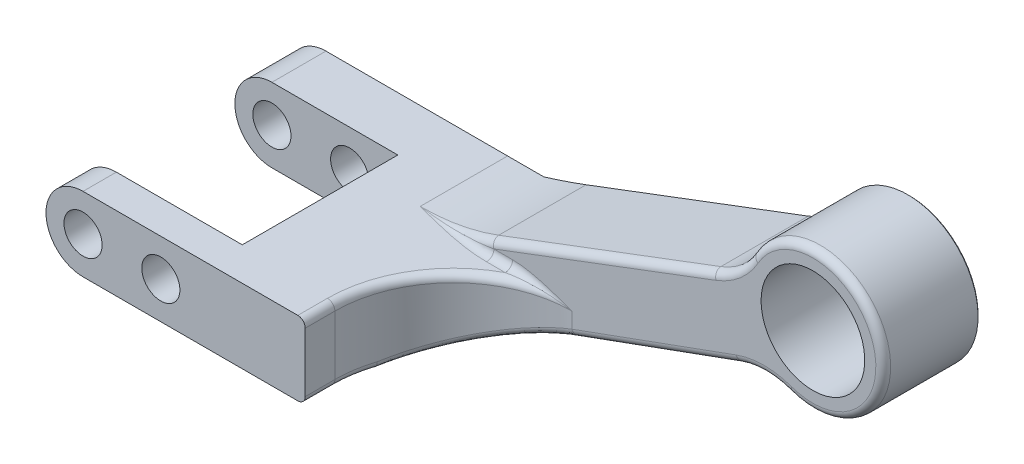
ISO-10303-21;
HEADER;
FILE_DESCRIPTION(('STEP AP214'),'2;1');
FILE_NAME('part.step','',(''),(''),'','','');
FILE_SCHEMA(('AUTOMOTIVE_DESIGN { 1 0 10303 214 1 1 1 1 }'));
ENDSEC;
DATA;
#1=APPLICATION_CONTEXT('core data for automotive mechanical design processes');
#2=APPLICATION_PROTOCOL_DEFINITION('international standard','automotive_design',2000,#1);
#3=PRODUCT_CONTEXT('',#1,'mechanical');
#4=PRODUCT('Part','Part','',(#3));
#5=PRODUCT_RELATED_PRODUCT_CATEGORY('part','',(#4));
#6=PRODUCT_DEFINITION_FORMATION('','',#4);
#7=PRODUCT_DEFINITION_CONTEXT('part definition',#1,'design');
#8=PRODUCT_DEFINITION('design','',#6,#7);
#9=PRODUCT_DEFINITION_SHAPE('','',#8);
#10=(LENGTH_UNIT() NAMED_UNIT(*) SI_UNIT(.MILLI.,.METRE.));
#11=(NAMED_UNIT(*) PLANE_ANGLE_UNIT() SI_UNIT($,.RADIAN.));
#12=(NAMED_UNIT(*) SI_UNIT($,.STERADIAN.) SOLID_ANGLE_UNIT());
#13=UNCERTAINTY_MEASURE_WITH_UNIT(LENGTH_MEASURE(1.E-05),#10,'distance_accuracy_value','');
#14=(GEOMETRIC_REPRESENTATION_CONTEXT(3) GLOBAL_UNCERTAINTY_ASSIGNED_CONTEXT((#13)) GLOBAL_UNIT_ASSIGNED_CONTEXT((#10,
#11,#12)) REPRESENTATION_CONTEXT('',''));
#15=CARTESIAN_POINT('',(0.,0.,0.));
#16=DIRECTION('',(0.,0.,1.));
#17=DIRECTION('',(1.,0.,0.));
#18=AXIS2_PLACEMENT_3D('',#15,#16,#17);
#19=CARTESIAN_POINT('',(5.11630237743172,-14.0569252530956,-16.5));
#20=DIRECTION('',(0.34202014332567,-0.939692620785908,0.));
#21=DIRECTION('',(0.939692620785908,0.34202014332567,0.));
#22=AXIS2_PLACEMENT_3D('',#19,#20,#21);
#23=PLANE('',#22);
#24=DIRECTION('',(0.,0.,1.));
#25=VECTOR('',#24,1.);
#26=CARTESIAN_POINT('',(30.,-4.99999999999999,-16.5));
#27=LINE('',#26,#25);
#28=CARTESIAN_POINT('',(30.,-4.99999999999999,-16.3));
#29=VERTEX_POINT('',#28);
#30=CARTESIAN_POINT('',(30.,-4.99999999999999,6.75543735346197));
#31=VERTEX_POINT('',#30);
#32=EDGE_CURVE('E266',#29,#31,#27,.T.);
#33=ORIENTED_EDGE('',*,*,#32,.F.);
#34=DIRECTION('',(-0.939692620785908,-0.34202014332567,0.));
#35=VECTOR('',#34,1.);
#36=CARTESIAN_POINT('',(5.11630237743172,-14.0569252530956,-16.3));
#37=LINE('',#36,#35);
#38=CARTESIAN_POINT('',(68.5432819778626,9.02860737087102,-16.3));
#39=VERTEX_POINT('',#38);
#40=EDGE_CURVE('E334',#39,#29,#37,.T.);
#41=ORIENTED_EDGE('',*,*,#40,.F.);
#42=DIRECTION('',(0.,0.,1.));
#43=VECTOR('',#42,1.);
#44=CARTESIAN_POINT('',(68.5432819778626,9.02860737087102,-16.5));
#45=LINE('',#44,#43);
#46=CARTESIAN_POINT('',(68.5432819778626,9.02860737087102,-4.5));
#47=VERTEX_POINT('',#46);
#48=EDGE_CURVE('E280',#47,#39,#45,.F.);
#49=ORIENTED_EDGE('',*,*,#48,.F.);
#50=DIRECTION('',(-0.939692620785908,-0.34202014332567,0.));
#51=VECTOR('',#50,1.);
#52=CARTESIAN_POINT('',(5.11630237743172,-14.0569252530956,-4.5));
#53=LINE('',#52,#51);
#54=CARTESIAN_POINT('',(46.3420201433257,0.948008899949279,-4.5));
#55=VERTEX_POINT('',#54);
#56=EDGE_CURVE('E422',#55,#47,#53,.F.);
#57=ORIENTED_EDGE('',*,*,#56,.F.);
#58=CARTESIAN_POINT('',(46.3420201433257,0.948008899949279,12.5));
#59=DIRECTION('',(-0.34202014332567,0.939692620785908,0.));
#60=DIRECTION('',(0.939692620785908,0.34202014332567,0.));
#61=AXIS2_PLACEMENT_3D('',#58,#59,#60);
#62=ELLIPSE('',#61,18.0910221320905,17.);
#63=CARTESIAN_POINT('',(30.149572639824,-4.94556001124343,7.32267985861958));
#64=VERTEX_POINT('',#63);
#65=EDGE_CURVE('E425',#64,#55,#62,.F.);
#66=ORIENTED_EDGE('',*,*,#65,.F.);
#67=CARTESIAN_POINT('',(30.,-5.,6.75543735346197));
#68=CARTESIAN_POINT('',(30.0000105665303,-4.99999615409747,6.78199128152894));
#69=CARTESIAN_POINT('',(30.0003327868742,-4.99987887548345,6.80854971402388));
#70=CARTESIAN_POINT('',(30.001784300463,-4.99935056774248,6.86167889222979));
#71=CARTESIAN_POINT('',(30.0029147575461,-4.99893911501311,6.88824960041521));
#72=CARTESIAN_POINT('',(30.0061724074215,-4.9977534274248,6.94140928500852));
#73=CARTESIAN_POINT('',(30.0083025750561,-4.99697810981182,6.9679980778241));
#74=CARTESIAN_POINT('',(30.0138872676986,-4.99494544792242,7.02100490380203));
#75=CARTESIAN_POINT('',(30.0173414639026,-4.99368822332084,7.04742297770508));
#76=CARTESIAN_POINT('',(30.0272067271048,-4.99009756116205,7.10686937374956));
#77=CARTESIAN_POINT('',(30.0341553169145,-4.98756848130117,7.13981656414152));
#78=CARTESIAN_POINT('',(30.0484994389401,-4.98234764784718,7.1881112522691));
#79=CARTESIAN_POINT('',(30.0539695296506,-4.98035669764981,7.20409437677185));
#80=CARTESIAN_POINT('',(30.066860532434,-4.97566475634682,7.23517267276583));
#81=CARTESIAN_POINT('',(30.0742755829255,-4.97296589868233,7.2502703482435));
#82=CARTESIAN_POINT('',(30.0873099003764,-4.96822179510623,7.27092869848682));
#83=CARTESIAN_POINT('',(30.0917884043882,-4.96659175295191,7.2772927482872));
#84=CARTESIAN_POINT('',(30.1014921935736,-4.96305986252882,7.28929920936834));
#85=CARTESIAN_POINT('',(30.1067134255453,-4.96115948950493,7.29494524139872));
#86=CARTESIAN_POINT('',(30.1177796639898,-4.95713170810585,7.30499932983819));
#87=CARTESIAN_POINT('',(30.1235909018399,-4.95501659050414,7.3094482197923));
#88=CARTESIAN_POINT('',(30.1360136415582,-4.95049508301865,7.31712169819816));
#89=CARTESIAN_POINT('',(30.1426371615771,-4.94808431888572,7.32032397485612));
#90=CARTESIAN_POINT('',(30.149572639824,-4.94556001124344,7.3226798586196));
#91=B_SPLINE_CURVE_WITH_KNOTS('',3,(#67,#68,#69,#70,#71,#72,#73,#74,#75,#76,#77,#78,#79,#80,#81,
#82,#83,#84,#85,#86,#87,#88,#89,#90),.UNSPECIFIED.,.F.,.F.,(4,2,2,2,2,2,2,2,2,2,2,4),(0.,
0.0796657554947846,0.15944645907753,0.239466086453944,0.319465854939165,0.420420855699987,
0.471380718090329,0.522188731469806,0.545987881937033,0.569661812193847,0.592378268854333,
0.615484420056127),.UNSPECIFIED.);
#92=EDGE_CURVE('E428',#31,#64,#91,.T.);
#93=ORIENTED_EDGE('',*,*,#92,.F.);
#94=EDGE_LOOP('',(#33,#41,#49,#57,#66,#93));
#95=FACE_BOUND('',#94,.T.);
#96=ADVANCED_FACE('F43',(#95),#23,.T.);
#97=CARTESIAN_POINT('',(78.5416909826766,17.9886195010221,-16.5));
#98=DIRECTION('',(0.,0.,1.));
#99=DIRECTION('',(-1.,0.,0.));
#100=AXIS2_PLACEMENT_3D('',#97,#98,#99);
#101=CYLINDRICAL_SURFACE('',#100,9.49999999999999);
#102=DIRECTION('',(0.,0.,1.));
#103=VECTOR('',#102,1.);
#104=CARTESIAN_POINT('',(75.3369231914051,9.04549569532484,-16.5));
#105=LINE('',#104,#103);
#106=CARTESIAN_POINT('',(75.3369231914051,9.04549569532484,-16.3));
#107=VERTEX_POINT('',#106);
#108=CARTESIAN_POINT('',(75.3369231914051,9.04549569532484,-4.5));
#109=VERTEX_POINT('',#108);
#110=EDGE_CURVE('E277',#107,#109,#105,.T.);
#111=ORIENTED_EDGE('',*,*,#110,.F.);
#112=CARTESIAN_POINT('',(78.5416909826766,17.9886195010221,-16.3));
#113=DIRECTION('',(0.,0.,1.));
#114=DIRECTION('',(1.,0.,0.));
#115=AXIS2_PLACEMENT_3D('',#112,#113,#114);
#116=CIRCLE('',#115,9.49999999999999);
#117=CARTESIAN_POINT('',(70.2810134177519,22.6802296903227,-16.3));
#118=VERTEX_POINT('',#117);
#119=EDGE_CURVE('E328',#118,#107,#116,.F.);
#120=ORIENTED_EDGE('',*,*,#119,.F.);
#121=DIRECTION('',(0.,0.,1.));
#122=VECTOR('',#121,1.);
#123=CARTESIAN_POINT('',(70.2810134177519,22.6802296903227,-16.5));
#124=LINE('',#123,#122);
#125=CARTESIAN_POINT('',(70.2810134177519,22.6802296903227,-4.5));
#126=VERTEX_POINT('',#125);
#127=EDGE_CURVE('E269',#126,#118,#124,.F.);
#128=ORIENTED_EDGE('',*,*,#127,.F.);
#129=CARTESIAN_POINT('',(78.5416909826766,17.9886195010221,-4.5));
#130=DIRECTION('',(0.,0.,-1.));
#131=DIRECTION('',(-1.,0.,0.));
#132=AXIS2_PLACEMENT_3D('',#129,#130,#131);
#133=CIRCLE('',#132,9.49999999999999);
#134=EDGE_CURVE('E665',#109,#126,#133,.F.);
#135=ORIENTED_EDGE('',*,*,#134,.F.);
#136=EDGE_LOOP('',(#111,#120,#128,#135));
#137=FACE_BOUND('',#136,.T.);
#138=ADVANCED_FACE('F447',(#137),#101,.T.);
#139=CARTESIAN_POINT('',(2.09243568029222,-5.54019796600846,-16.5));
#140=DIRECTION('',(-0.353322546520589,0.935501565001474,0.));
#141=DIRECTION('',(-0.935501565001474,-0.353322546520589,0.));
#142=AXIS2_PLACEMENT_3D('',#139,#140,#141);
#143=PLANE('',#142);
#144=DIRECTION('',(0.,0.,1.));
#145=VECTOR('',#144,1.);
#146=CARTESIAN_POINT('',(65.118788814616,18.2637510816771,-16.5));
#147=LINE('',#146,#145);
#148=CARTESIAN_POINT('',(65.118788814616,18.2637510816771,-16.3));
#149=VERTEX_POINT('',#148);
#150=CARTESIAN_POINT('',(65.118788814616,18.2637510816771,-4.5));
#151=VERTEX_POINT('',#150);
#152=EDGE_CURVE('E283',#149,#151,#147,.T.);
#153=ORIENTED_EDGE('',*,*,#152,.F.);
#154=DIRECTION('',(0.935501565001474,0.353322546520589,0.));
#155=VECTOR('',#154,1.);
#156=CARTESIAN_POINT('',(2.09243568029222,-5.54019796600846,-16.3));
#157=LINE('',#156,#155);
#158=CARTESIAN_POINT('',(35.1232269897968,6.9349530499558,-16.3));
#159=VERTEX_POINT('',#158);
#160=EDGE_CURVE('E322',#159,#149,#157,.T.);
#161=ORIENTED_EDGE('',*,*,#160,.F.);
#162=DIRECTION('',(0.,0.,1.));
#163=VECTOR('',#162,1.);
#164=CARTESIAN_POINT('',(35.1232269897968,6.9349530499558,-16.3));
#165=LINE('',#164,#163);
#166=CARTESIAN_POINT('',(35.1232269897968,6.9349530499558,-4.5));
#167=VERTEX_POINT('',#166);
#168=EDGE_CURVE('E374',#167,#159,#165,.F.);
#169=ORIENTED_EDGE('',*,*,#168,.F.);
#170=DIRECTION('',(0.935501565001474,0.353322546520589,0.));
#171=VECTOR('',#170,1.);
#172=CARTESIAN_POINT('',(2.09243568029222,-5.54019796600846,-4.5));
#173=LINE('',#172,#171);
#174=EDGE_CURVE('E479',#151,#167,#173,.F.);
#175=ORIENTED_EDGE('',*,*,#174,.F.);
#176=EDGE_LOOP('',(#153,#161,#169,#175));
#177=FACE_BOUND('',#176,.T.);
#178=ADVANCED_FACE('F520',(#177),#143,.T.);
#179=CARTESIAN_POINT('',(78.5416909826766,17.9886195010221,-16.5));
#180=DIRECTION('',(0.,0.,1.));
#181=DIRECTION('',(-1.,0.,0.));
#182=AXIS2_PLACEMENT_3D('',#179,#180,#181);
#183=CYLINDRICAL_SURFACE('',#182,7.);
#184=CARTESIAN_POINT('',(78.5416909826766,17.9886195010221,-16.3));
#185=DIRECTION('',(0.,0.,1.));
#186=DIRECTION('',(1.,0.,0.));
#187=AXIS2_PLACEMENT_3D('',#184,#185,#186);
#188=CIRCLE('',#187,7.);
#189=CARTESIAN_POINT('',(85.5416909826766,17.9886195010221,-16.3));
#190=VERTEX_POINT('',#189);
#191=EDGE_CURVE('E346',#190,#190,#188,.T.);
#192=ORIENTED_EDGE('',*,*,#191,.F.);
#193=EDGE_LOOP('',(#192));
#194=FACE_BOUND('',#193,.T.);
#195=CARTESIAN_POINT('',(78.5416909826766,17.9886195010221,-3.5));
#196=DIRECTION('',(0.,0.,-1.));
#197=DIRECTION('',(-1.,0.,0.));
#198=AXIS2_PLACEMENT_3D('',#195,#196,#197);
#199=CIRCLE('',#198,7.);
#200=CARTESIAN_POINT('',(71.5416909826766,17.9886195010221,-3.5));
#201=VERTEX_POINT('',#200);
#202=EDGE_CURVE('E1116',#201,#201,#199,.F.);
#203=ORIENTED_EDGE('',*,*,#202,.T.);
#204=EDGE_LOOP('',(#203));
#205=FACE_BOUND('',#204,.T.);
#206=ADVANCED_FACE('F921',(#194,#205),#183,.F.);
#207=CARTESIAN_POINT('',(0.,0.,16.5));
#208=DIRECTION('',(0.,0.,-1.));
#209=DIRECTION('',(1.,0.,0.));
#210=AXIS2_PLACEMENT_3D('',#207,#208,#209);
#211=PLANE('',#210);
#212=CARTESIAN_POINT('',(0.,0.,16.5));
#213=DIRECTION('',(0.,0.,1.));
#214=DIRECTION('',(1.,0.,0.));
#215=AXIS2_PLACEMENT_3D('',#212,#213,#214);
#216=CIRCLE('',#215,2.575);
#217=CARTESIAN_POINT('',(2.575,0.,16.5));
#218=VERTEX_POINT('',#217);
#219=EDGE_CURVE('E1153',#218,#218,#216,.T.);
#220=ORIENTED_EDGE('',*,*,#219,.F.);
#221=EDGE_LOOP('',(#220));
#222=FACE_BOUND('',#221,.T.);
#223=CARTESIAN_POINT('',(10.5,0.,16.5));
#224=DIRECTION('',(0.,0.,1.));
#225=DIRECTION('',(1.,0.,0.));
#226=AXIS2_PLACEMENT_3D('',#223,#224,#225);
#227=CIRCLE('',#226,2.575);
#228=CARTESIAN_POINT('',(13.075,0.,16.5));
#229=VERTEX_POINT('',#228);
#230=EDGE_CURVE('E1150',#229,#229,#227,.T.);
#231=ORIENTED_EDGE('',*,*,#230,.F.);
#232=EDGE_LOOP('',(#231));
#233=FACE_BOUND('',#232,.T.);
#234=DIRECTION('',(1.,0.,0.));
#235=VECTOR('',#234,1.);
#236=CARTESIAN_POINT('',(0.,5.,16.5));
#237=LINE('',#236,#235);
#238=CARTESIAN_POINT('',(0.,5.,16.5));
#239=VERTEX_POINT('',#238);
#240=CARTESIAN_POINT('',(29.,5.00000000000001,16.5));
#241=VERTEX_POINT('',#240);
#242=EDGE_CURVE('E1159',#239,#241,#237,.T.);
#243=ORIENTED_EDGE('',*,*,#242,.F.);
#244=CARTESIAN_POINT('',(0.,0.,16.5));
#245=DIRECTION('',(0.,0.,1.));
#246=DIRECTION('',(1.,0.,0.));
#247=AXIS2_PLACEMENT_3D('',#244,#245,#246);
#248=CIRCLE('',#247,5.);
#249=CARTESIAN_POINT('',(0.,-5.,16.5));
#250=VERTEX_POINT('',#249);
#251=EDGE_CURVE('E1156',#250,#239,#248,.F.);
#252=ORIENTED_EDGE('',*,*,#251,.F.);
#253=DIRECTION('',(-1.,0.,0.));
#254=VECTOR('',#253,1.);
#255=CARTESIAN_POINT('',(0.,-5.,16.5));
#256=LINE('',#255,#254);
#257=CARTESIAN_POINT('',(29.,-5.,16.5));
#258=VERTEX_POINT('',#257);
#259=EDGE_CURVE('E263',#258,#250,#256,.T.);
#260=ORIENTED_EDGE('',*,*,#259,.F.);
#261=CARTESIAN_POINT('',(29.,-4.,16.5));
#262=DIRECTION('',(0.,0.,1.));
#263=DIRECTION('',(1.,0.,0.));
#264=AXIS2_PLACEMENT_3D('',#261,#262,#263);
#265=CIRCLE('',#264,1.);
#266=CARTESIAN_POINT('',(30.,-4.,16.5));
#267=VERTEX_POINT('',#266);
#268=EDGE_CURVE('E414',#267,#258,#265,.F.);
#269=ORIENTED_EDGE('',*,*,#268,.F.);
#270=DIRECTION('',(0.,-1.,0.));
#271=VECTOR('',#270,1.);
#272=CARTESIAN_POINT('',(30.,0.,16.5));
#273=LINE('',#272,#271);
#274=CARTESIAN_POINT('',(30.,4.00000000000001,16.5));
#275=VERTEX_POINT('',#274);
#276=EDGE_CURVE('E371',#275,#267,#273,.T.);
#277=ORIENTED_EDGE('',*,*,#276,.F.);
#278=CARTESIAN_POINT('',(29.,4.00000000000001,16.5));
#279=DIRECTION('',(0.,0.,1.));
#280=DIRECTION('',(1.,0.,0.));
#281=AXIS2_PLACEMENT_3D('',#278,#279,#280);
#282=CIRCLE('',#281,1.);
#283=EDGE_CURVE('E481',#241,#275,#282,.F.);
#284=ORIENTED_EDGE('',*,*,#283,.F.);
#285=EDGE_LOOP('',(#243,#252,#260,#269,#277,#284));
#286=FACE_BOUND('',#285,.T.);
#287=ADVANCED_FACE('F518',(#222,#233,#286),#211,.F.);
#288=CARTESIAN_POINT('',(0.,0.,-16.5));
#289=DIRECTION('',(0.,0.,1.));
#290=DIRECTION('',(-1.,0.,0.));
#291=AXIS2_PLACEMENT_3D('',#288,#289,#290);
#292=CYLINDRICAL_SURFACE('',#291,5.);
#293=DIRECTION('',(0.,0.,1.));
#294=VECTOR('',#293,1.);
#295=CARTESIAN_POINT('',(0.,-5.,-16.5));
#296=LINE('',#295,#294);
#297=CARTESIAN_POINT('',(0.,-5.,12.));
#298=VERTEX_POINT('',#297);
#299=EDGE_CURVE('E256',#298,#250,#296,.T.);
#300=ORIENTED_EDGE('',*,*,#299,.T.);
#301=ORIENTED_EDGE('',*,*,#251,.T.);
#302=DIRECTION('',(0.,0.,1.));
#303=VECTOR('',#302,1.);
#304=CARTESIAN_POINT('',(0.,5.,-16.5));
#305=LINE('',#304,#303);
#306=CARTESIAN_POINT('',(0.,5.,12.));
#307=VERTEX_POINT('',#306);
#308=EDGE_CURVE('E258',#307,#239,#305,.T.);
#309=ORIENTED_EDGE('',*,*,#308,.F.);
#310=CARTESIAN_POINT('',(0.,0.,12.));
#311=DIRECTION('',(0.,0.,1.));
#312=DIRECTION('',(1.,0.,0.));
#313=AXIS2_PLACEMENT_3D('',#310,#311,#312);
#314=CIRCLE('',#313,5.);
#315=EDGE_CURVE('E245',#298,#307,#314,.F.);
#316=ORIENTED_EDGE('',*,*,#315,.F.);
#317=EDGE_LOOP('',(#300,#301,#309,#316));
#318=FACE_BOUND('',#317,.T.);
#319=ADVANCED_FACE('F254',(#318),#292,.T.);
#320=CARTESIAN_POINT('',(0.,0.,-16.5));
#321=DIRECTION('',(0.,0.,1.));
#322=DIRECTION('',(-1.,0.,0.));
#323=AXIS2_PLACEMENT_3D('',#320,#321,#322);
#324=CYLINDRICAL_SURFACE('',#323,2.575);
#325=ORIENTED_EDGE('',*,*,#219,.T.);
#326=EDGE_LOOP('',(#325));
#327=FACE_BOUND('',#326,.T.);
#328=CARTESIAN_POINT('',(0.,0.,12.));
#329=DIRECTION('',(0.,0.,1.));
#330=DIRECTION('',(1.,0.,0.));
#331=AXIS2_PLACEMENT_3D('',#328,#329,#330);
#332=CIRCLE('',#331,2.575);
#333=CARTESIAN_POINT('',(2.575,0.,12.));
#334=VERTEX_POINT('',#333);
#335=EDGE_CURVE('E259',#334,#334,#332,.F.);
#336=ORIENTED_EDGE('',*,*,#335,.T.);
#337=EDGE_LOOP('',(#336));
#338=FACE_BOUND('',#337,.T.);
#339=ADVANCED_FACE('F886',(#327,#338),#324,.F.);
#340=CARTESIAN_POINT('',(10.5,0.,16.5));
#341=DIRECTION('',(0.,0.,-1.));
#342=DIRECTION('',(1.,0.,0.));
#343=AXIS2_PLACEMENT_3D('',#340,#341,#342);
#344=CYLINDRICAL_SURFACE('',#343,2.575);
#345=ORIENTED_EDGE('',*,*,#230,.T.);
#346=EDGE_LOOP('',(#345));
#347=FACE_BOUND('',#346,.T.);
#348=CARTESIAN_POINT('',(10.5,0.,12.));
#349=DIRECTION('',(0.,0.,1.));
#350=DIRECTION('',(1.,0.,0.));
#351=AXIS2_PLACEMENT_3D('',#348,#349,#350);
#352=CIRCLE('',#351,2.575);
#353=CARTESIAN_POINT('',(13.075,0.,12.));
#354=VERTEX_POINT('',#353);
#355=EDGE_CURVE('E1126',#354,#354,#352,.F.);
#356=ORIENTED_EDGE('',*,*,#355,.T.);
#357=EDGE_LOOP('',(#356));
#358=FACE_BOUND('',#357,.T.);
#359=ADVANCED_FACE('F868',(#347,#358),#344,.F.);
#360=CARTESIAN_POINT('',(0.,-5.,-16.3));
#361=VERTEX_POINT('',#360);
#362=CARTESIAN_POINT('',(0.,-5.,-9.));
#363=VERTEX_POINT('',#362);
#364=EDGE_CURVE('E265',#361,#363,#296,.T.);
#365=ORIENTED_EDGE('',*,*,#364,.T.);
#366=CARTESIAN_POINT('',(0.,0.,-9.));
#367=DIRECTION('',(0.,0.,1.));
#368=DIRECTION('',(1.,0.,0.));
#369=AXIS2_PLACEMENT_3D('',#366,#367,#368);
#370=CIRCLE('',#369,5.);
#371=CARTESIAN_POINT('',(0.,5.,-9.));
#372=VERTEX_POINT('',#371);
#373=EDGE_CURVE('E1132',#363,#372,#370,.F.);
#374=ORIENTED_EDGE('',*,*,#373,.T.);
#375=CARTESIAN_POINT('',(0.,5.,-16.3));
#376=VERTEX_POINT('',#375);
#377=EDGE_CURVE('E271',#376,#372,#305,.T.);
#378=ORIENTED_EDGE('',*,*,#377,.F.);
#379=CARTESIAN_POINT('',(0.,0.,-16.3));
#380=DIRECTION('',(0.,0.,1.));
#381=DIRECTION('',(1.,0.,0.));
#382=AXIS2_PLACEMENT_3D('',#379,#380,#381);
#383=CIRCLE('',#382,5.);
#384=EDGE_CURVE('E340',#361,#376,#383,.F.);
#385=ORIENTED_EDGE('',*,*,#384,.F.);
#386=EDGE_LOOP('',(#365,#374,#378,#385));
#387=FACE_BOUND('',#386,.T.);
#388=ADVANCED_FACE('F892',(#387),#292,.T.);
#389=CARTESIAN_POINT('',(0.,-5.,-16.5));
#390=DIRECTION('',(0.,-1.,0.));
#391=DIRECTION('',(1.,0.,0.));
#392=AXIS2_PLACEMENT_3D('',#389,#390,#391);
#393=PLANE('',#392);
#394=ORIENTED_EDGE('',*,*,#259,.T.);
#395=ORIENTED_EDGE('',*,*,#299,.F.);
#396=DIRECTION('',(-1.,0.,0.));
#397=VECTOR('',#396,1.);
#398=CARTESIAN_POINT('',(0.,-5.,12.));
#399=LINE('',#398,#397);
#400=CARTESIAN_POINT('',(17.,-5.,12.));
#401=VERTEX_POINT('',#400);
#402=EDGE_CURVE('E240',#401,#298,#399,.T.);
#403=ORIENTED_EDGE('',*,*,#402,.F.);
#404=DIRECTION('',(0.,0.,1.));
#405=VECTOR('',#404,1.);
#406=CARTESIAN_POINT('',(17.,-5.,-9.));
#407=LINE('',#406,#405);
#408=CARTESIAN_POINT('',(17.,-5.,-9.));
#409=VERTEX_POINT('',#408);
#410=EDGE_CURVE('E1148',#409,#401,#407,.T.);
#411=ORIENTED_EDGE('',*,*,#410,.F.);
#412=DIRECTION('',(-1.,0.,0.));
#413=VECTOR('',#412,1.);
#414=CARTESIAN_POINT('',(0.,-5.,-9.));
#415=LINE('',#414,#413);
#416=EDGE_CURVE('E1135',#409,#363,#415,.T.);
#417=ORIENTED_EDGE('',*,*,#416,.T.);
#418=ORIENTED_EDGE('',*,*,#364,.F.);
#419=DIRECTION('',(-1.,0.,0.));
#420=VECTOR('',#419,1.);
#421=CARTESIAN_POINT('',(0.,-5.,-16.3));
#422=LINE('',#421,#420);
#423=EDGE_CURVE('E337',#29,#361,#422,.T.);
#424=ORIENTED_EDGE('',*,*,#423,.F.);
#425=ORIENTED_EDGE('',*,*,#32,.T.);
#426=CARTESIAN_POINT('',(46.,-4.99999999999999,12.5));
#427=DIRECTION('',(0.,1.,0.));
#428=DIRECTION('',(1.,0.,0.));
#429=AXIS2_PLACEMENT_3D('',#426,#427,#428);
#430=CIRCLE('',#429,17.);
#431=CARTESIAN_POINT('',(29.,-5.,12.5));
#432=VERTEX_POINT('',#431);
#433=EDGE_CURVE('E417',#432,#31,#430,.F.);
#434=ORIENTED_EDGE('',*,*,#433,.F.);
#435=DIRECTION('',(0.,0.,1.));
#436=VECTOR('',#435,1.);
#437=CARTESIAN_POINT('',(29.,-5.,-16.5));
#438=LINE('',#437,#436);
#439=EDGE_CURVE('E419',#258,#432,#438,.F.);
#440=ORIENTED_EDGE('',*,*,#439,.F.);
#441=EDGE_LOOP('',(#394,#395,#403,#411,#417,#418,#424,#425,#434,#440));
#442=FACE_BOUND('',#441,.T.);
#443=ADVANCED_FACE('F261',(#442),#393,.T.);
#444=CARTESIAN_POINT('',(0.,0.,-16.3));
#445=DIRECTION('',(0.,0.,1.));
#446=DIRECTION('',(1.,0.,0.));
#447=AXIS2_PLACEMENT_3D('',#444,#445,#446);
#448=CIRCLE('',#447,2.575);
#449=CARTESIAN_POINT('',(2.575,0.,-16.3));
#450=VERTEX_POINT('',#449);
#451=EDGE_CURVE('E343',#450,#450,#448,.T.);
#452=ORIENTED_EDGE('',*,*,#451,.F.);
#453=EDGE_LOOP('',(#452));
#454=FACE_BOUND('',#453,.T.);
#455=CARTESIAN_POINT('',(0.,0.,-9.));
#456=DIRECTION('',(0.,0.,1.));
#457=DIRECTION('',(1.,0.,0.));
#458=AXIS2_PLACEMENT_3D('',#455,#456,#457);
#459=CIRCLE('',#458,2.575);
#460=CARTESIAN_POINT('',(2.575,0.,-9.));
#461=VERTEX_POINT('',#460);
#462=EDGE_CURVE('E1129',#461,#461,#459,.F.);
#463=ORIENTED_EDGE('',*,*,#462,.F.);
#464=EDGE_LOOP('',(#463));
#465=FACE_BOUND('',#464,.T.);
#466=ADVANCED_FACE('F516',(#454,#465),#324,.F.);
#467=CARTESIAN_POINT('',(0.,5.,-16.5));
#468=DIRECTION('',(0.,1.,0.));
#469=DIRECTION('',(-1.,0.,0.));
#470=AXIS2_PLACEMENT_3D('',#467,#468,#469);
#471=PLANE('',#470);
#472=DIRECTION('',(0.,0.,1.));
#473=VECTOR('',#472,1.);
#474=CARTESIAN_POINT('',(24.5235505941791,5.00000000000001,-3.5));
#475=LINE('',#474,#473);
#476=CARTESIAN_POINT('',(24.5235505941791,5.00000000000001,-16.3));
#477=VERTEX_POINT('',#476);
#478=CARTESIAN_POINT('',(24.5235505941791,5.00000000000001,-4.5));
#479=VERTEX_POINT('',#478);
#480=EDGE_CURVE('E352',#477,#479,#475,.T.);
#481=ORIENTED_EDGE('',*,*,#480,.F.);
#482=DIRECTION('',(1.,0.,0.));
#483=VECTOR('',#482,1.);
#484=CARTESIAN_POINT('',(0.,5.,-16.3));
#485=LINE('',#484,#483);
#486=EDGE_CURVE('E286',#376,#477,#485,.T.);
#487=ORIENTED_EDGE('',*,*,#486,.F.);
#488=ORIENTED_EDGE('',*,*,#377,.T.);
#489=DIRECTION('',(1.,0.,0.));
#490=VECTOR('',#489,1.);
#491=CARTESIAN_POINT('',(0.,5.,-9.));
#492=LINE('',#491,#490);
#493=CARTESIAN_POINT('',(17.,5.,-9.));
#494=VERTEX_POINT('',#493);
#495=EDGE_CURVE('E1139',#372,#494,#492,.T.);
#496=ORIENTED_EDGE('',*,*,#495,.T.);
#497=DIRECTION('',(0.,0.,1.));
#498=VECTOR('',#497,1.);
#499=CARTESIAN_POINT('',(17.,5.,-9.));
#500=LINE('',#499,#498);
#501=CARTESIAN_POINT('',(17.,5.00000000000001,12.));
#502=VERTEX_POINT('',#501);
#503=EDGE_CURVE('E1145',#494,#502,#500,.T.);
#504=ORIENTED_EDGE('',*,*,#503,.T.);
#505=DIRECTION('',(1.,0.,0.));
#506=VECTOR('',#505,1.);
#507=CARTESIAN_POINT('',(0.,5.,12.));
#508=LINE('',#507,#506);
#509=EDGE_CURVE('E1124',#307,#502,#508,.T.);
#510=ORIENTED_EDGE('',*,*,#509,.F.);
#511=ORIENTED_EDGE('',*,*,#308,.T.);
#512=ORIENTED_EDGE('',*,*,#242,.T.);
#513=DIRECTION('',(0.,0.,1.));
#514=VECTOR('',#513,1.);
#515=CARTESIAN_POINT('',(29.,5.00000000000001,-16.5));
#516=LINE('',#515,#514);
#517=CARTESIAN_POINT('',(29.,5.00000000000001,12.5));
#518=VERTEX_POINT('',#517);
#519=EDGE_CURVE('E478',#518,#241,#516,.T.);
#520=ORIENTED_EDGE('',*,*,#519,.F.);
#521=CARTESIAN_POINT('',(46.,5.00000000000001,12.5));
#522=DIRECTION('',(0.,-1.,0.));
#523=DIRECTION('',(-1.,0.,0.));
#524=AXIS2_PLACEMENT_3D('',#521,#522,#523);
#525=CIRCLE('',#524,17.);
#526=CARTESIAN_POINT('',(38.,5.00000000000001,-2.5));
#527=VERTEX_POINT('',#526);
#528=EDGE_CURVE('E475',#527,#518,#525,.F.);
#529=ORIENTED_EDGE('',*,*,#528,.F.);
#530=DIRECTION('',(1.,0.,0.));
#531=VECTOR('',#530,1.);
#532=CARTESIAN_POINT('',(40.255437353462,5.00000000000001,-2.5));
#533=LINE('',#532,#531);
#534=CARTESIAN_POINT('',(35.4780018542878,5.00000000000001,-2.5));
#535=VERTEX_POINT('',#534);
#536=EDGE_CURVE('E490',#535,#527,#533,.T.);
#537=ORIENTED_EDGE('',*,*,#536,.F.);
#538=CARTESIAN_POINT('',(35.4780018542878,5.00000000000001,-4.5));
#539=DIRECTION('',(0.,-1.,0.));
#540=DIRECTION('',(1.,0.,0.));
#541=AXIS2_PLACEMENT_3D('',#538,#539,#540);
#542=ELLIPSE('',#541,5.66055016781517,2.);
#543=CARTESIAN_POINT('',(35.4763423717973,5.00000000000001,-2.50000008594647));
#544=VERTEX_POINT('',#543);
#545=EDGE_CURVE('E495',#544,#535,#542,.F.);
#546=ORIENTED_EDGE('',*,*,#545,.F.);
#547=CARTESIAN_POINT('',(38.3964109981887,5.00000000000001,-2.86187910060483));
#548=CARTESIAN_POINT('',(38.227389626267,5.00000000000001,-3.42105351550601));
#549=CARTESIAN_POINT('',(38.1443743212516,5.50884728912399,-3.69569354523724));
#550=CARTESIAN_POINT('',(38.0613590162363,6.01769457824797,-3.97033357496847));
#551=CARTESIAN_POINT('',(38.1488340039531,6.51753802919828,-3.68093955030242));
#552=CARTESIAN_POINT('',(38.2879337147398,5.00000000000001,-2.82912661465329));
#553=CARTESIAN_POINT('',(38.1319307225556,5.00000000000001,-3.38390136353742));
#554=CARTESIAN_POINT('',(38.0530714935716,5.49848607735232,-3.66199910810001));
#555=CARTESIAN_POINT('',(37.9748532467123,5.99704171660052,-3.94031905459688));
#556=CARTESIAN_POINT('',(38.0520343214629,6.49717677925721,-3.66456330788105));
#557=CARTESIAN_POINT('',(38.1786024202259,5.00000000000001,-2.79934342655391));
#558=CARTESIAN_POINT('',(38.0340696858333,5.00000000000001,-3.3491836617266));
#559=CARTESIAN_POINT('',(37.9595432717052,5.48841959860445,-3.63036866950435));
#560=CARTESIAN_POINT('',(37.8856347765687,5.97690186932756,-3.91174249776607));
#561=CARTESIAN_POINT('',(37.9541905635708,6.47676134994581,-3.64967171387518));
#562=CARTESIAN_POINT('',(37.9586954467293,5.00000000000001,-2.7450697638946));
#563=CARTESIAN_POINT('',(37.8351505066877,5.00000000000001,-3.28456879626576));
#564=CARTESIAN_POINT('',(37.768935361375,5.46883921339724,-3.5710169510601));
#565=CARTESIAN_POINT('',(37.7033289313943,5.93774175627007,-3.85765821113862));
#566=CARTESIAN_POINT('',(37.7568146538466,6.43592946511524,-3.62253488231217));
#567=CARTESIAN_POINT('',(37.8481205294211,5.00000000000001,-2.72057621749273));
#568=CARTESIAN_POINT('',(37.7340737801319,5.00000000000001,-3.25462476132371));
#569=CARTESIAN_POINT('',(37.6718577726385,5.45932498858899,-3.54329340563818));
#570=CARTESIAN_POINT('',(37.6102310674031,5.91870564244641,-3.83211798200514));
#571=CARTESIAN_POINT('',(37.6572835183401,6.41551301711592,-3.61028810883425));
#572=CARTESIAN_POINT('',(37.6263323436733,5.00000000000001,-2.67625324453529));
#573=CARTESIAN_POINT('',(37.5297440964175,5.00000000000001,-3.19921062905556));
#574=CARTESIAN_POINT('',(37.4751812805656,5.44082274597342,-3.49156084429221));
#575=CARTESIAN_POINT('',(37.4212030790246,5.88170026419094,-3.78406391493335));
#576=CARTESIAN_POINT('',(37.4570625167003,6.37481197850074,-3.58812662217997));
#577=CARTESIAN_POINT('',(37.5151212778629,5.00000000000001,-2.65641263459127));
#578=CARTESIAN_POINT('',(37.4264745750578,5.00000000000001,-3.17369384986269));
#579=CARTESIAN_POINT('',(37.3755890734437,5.43183350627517,-3.46754297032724));
#580=CARTESIAN_POINT('',(37.3252644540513,5.86371582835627,-3.76151670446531));
#581=CARTESIAN_POINT('',(37.3563760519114,6.35452718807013,-3.57820631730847));
#582=CARTESIAN_POINT('',(37.292034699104,5.00000000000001,-2.62082169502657));
#583=CARTESIAN_POINT('',(37.2180511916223,5.00000000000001,-3.12667018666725));
#584=CARTESIAN_POINT('',(37.1741985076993,5.4143163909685,-3.42288429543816));
#585=CARTESIAN_POINT('',(37.1309035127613,5.82868126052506,-3.71922183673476));
#586=CARTESIAN_POINT('',(37.1538153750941,6.3141027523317,-3.56041084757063));
#587=CARTESIAN_POINT('',(37.180159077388,5.00000000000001,-2.60507205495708));
#588=CARTESIAN_POINT('',(37.1128720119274,5.00000000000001,-3.10513383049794));
#589=CARTESIAN_POINT('',(37.0723997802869,5.40578859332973,-3.40224406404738));
#590=CARTESIAN_POINT('',(37.0324614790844,5.81162017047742,-3.69945199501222));
#591=CARTESIAN_POINT('',(37.0519409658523,6.29396313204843,-3.55253602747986));
#592=CARTESIAN_POINT('',(36.8460821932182,5.00000000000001,-2.56358927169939));
#593=CARTESIAN_POINT('',(36.798079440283,5.00000000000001,-3.04657694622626));
#594=CARTESIAN_POINT('',(36.7664265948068,5.38101010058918,-3.34540421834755));
#595=CARTESIAN_POINT('',(36.7368520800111,5.76218901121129,-3.64462050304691));
#596=CARTESIAN_POINT('',(36.7468507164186,6.23424659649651,-3.53179463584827));
#597=CARTESIAN_POINT('',(36.6232093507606,5.00000000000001,-2.54319867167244));
#598=CARTESIAN_POINT('',(36.5854076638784,5.00000000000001,-3.01462775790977));
#599=CARTESIAN_POINT('',(36.5596933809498,5.36538124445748,-3.31377978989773));
#600=CARTESIAN_POINT('',(36.5358752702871,5.73089823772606,-3.61317340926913));
#601=CARTESIAN_POINT('',(36.5421624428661,6.19496362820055,-3.52159933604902));
#602=CARTESIAN_POINT('',(36.1765893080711,5.00000000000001,-2.51421362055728));
#603=CARTESIAN_POINT('',(36.1566139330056,5.00000000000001,-2.96296704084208));
#604=CARTESIAN_POINT('',(36.1416039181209,5.33556268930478,-3.261114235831));
#605=CARTESIAN_POINT('',(36.1284766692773,5.67125915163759,-3.55949588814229));
#606=CARTESIAN_POINT('',(36.1296774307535,6.11748970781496,-3.50710681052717));
#607=CARTESIAN_POINT('',(35.9528415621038,5.00000000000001,-2.50562836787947));
#608=CARTESIAN_POINT('',(35.9403043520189,5.00000000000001,-2.94312922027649));
#609=CARTESIAN_POINT('',(35.9302441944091,5.32137412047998,-3.24008137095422));
#610=CARTESIAN_POINT('',(35.9218943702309,5.64285669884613,-3.53716290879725));
#611=CARTESIAN_POINT('',(35.9218783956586,6.07929962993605,-3.50281418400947));
#612=CARTESIAN_POINT('',(35.4197196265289,5.00000000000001,-2.49700393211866));
#613=CARTESIAN_POINT('',(35.4234882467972,5.00000000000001,-2.90838277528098));
#614=CARTESIAN_POINT('',(35.4231679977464,5.28909815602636,-3.20092368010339));
#615=CARTESIAN_POINT('',(35.4260870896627,5.57840305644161,-3.49371841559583));
#616=CARTESIAN_POINT('',(35.4240517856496,5.9899404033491,-3.49850196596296));
#617=CARTESIAN_POINT('',(35.1102747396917,5.00000000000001,-2.50148009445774));
#618=CARTESIAN_POINT('',(35.1209012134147,5.00000000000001,-2.89796140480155));
#619=CARTESIAN_POINT('',(35.1260592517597,5.27159092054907,-3.18697635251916));
#620=CARTESIAN_POINT('',(35.1340498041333,5.54333842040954,-3.4760582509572));
#621=CARTESIAN_POINT('',(35.1329254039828,5.93938390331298,-3.50074004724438));
#622=CARTESIAN_POINT('',(34.4919470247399,5.00000000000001,-2.52568111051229));
#623=CARTESIAN_POINT('',(34.5140830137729,5.00000000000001,-2.89340795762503));
#624=CARTESIAN_POINT('',(34.5283350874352,5.23867406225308,-3.17358936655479));
#625=CARTESIAN_POINT('',(34.5453927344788,5.47750204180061,-3.45383013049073));
#626=CARTESIAN_POINT('',(34.5470196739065,5.84130567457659,-3.51284055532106));
#627=CARTESIAN_POINT('',(34.1830644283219,5.00000000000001,-2.54541124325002));
#628=CARTESIAN_POINT('',(34.2094624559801,5.00000000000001,-2.89912612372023));
#629=CARTESIAN_POINT('',(34.2277184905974,5.22326516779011,-3.17415473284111));
#630=CARTESIAN_POINT('',(34.2484221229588,5.4466477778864,-3.44912944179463));
#631=CARTESIAN_POINT('',(34.2522390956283,5.79378500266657,-3.52270562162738));
#632=CARTESIAN_POINT('',(33.5661420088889,5.00000000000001,-2.5974031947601));
#633=CARTESIAN_POINT('',(33.5995549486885,5.00000000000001,-2.92399256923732));
#634=CARTESIAN_POINT('',(33.6242061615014,5.19430240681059,-3.18741176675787));
#635=CARTESIAN_POINT('',(33.6512890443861,5.38872152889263,-3.45077768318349));
#636=CARTESIAN_POINT('',(33.6595119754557,5.70212261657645,-3.54870159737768));
#637=CARTESIAN_POINT('',(33.258103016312,5.00000000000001,-2.62967463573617));
#638=CARTESIAN_POINT('',(33.2939241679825,5.00000000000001,-2.94305749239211));
#639=CARTESIAN_POINT('',(33.3213088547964,5.18074997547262,-3.20011275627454));
#640=CARTESIAN_POINT('',(33.3508083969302,5.36158894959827,-3.45704727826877));
#641=CARTESIAN_POINT('',(33.361563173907,5.65798352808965,-3.5648373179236));
#642=CARTESIAN_POINT('',(32.6432758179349,5.00000000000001,-2.704602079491));
#643=CARTESIAN_POINT('',(32.6828448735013,5.00000000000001,-2.99234041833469));
#644=CARTESIAN_POINT('',(32.714299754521,5.15534116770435,-3.23570364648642));
#645=CARTESIAN_POINT('',(32.747849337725,5.31076954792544,-3.47894081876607));
#646=CARTESIAN_POINT('',(32.7631617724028,5.57342378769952,-3.60230103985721));
#647=CARTESIAN_POINT('',(32.3364877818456,5.00000000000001,-2.74725944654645));
#648=CARTESIAN_POINT('',(32.3770914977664,5.00000000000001,-3.0225075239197));
#649=CARTESIAN_POINT('',(32.4101878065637,5.14348501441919,-3.25859488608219));
#650=CARTESIAN_POINT('',(32.4450848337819,5.28703418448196,-3.49451241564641));
#651=CARTESIAN_POINT('',(32.462708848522,5.5330036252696,-3.62362972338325));
#652=CARTESIAN_POINT('',(31.4127274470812,5.00000000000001,-2.88893161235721));
#653=CARTESIAN_POINT('',(31.4581310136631,5.00000000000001,-3.12716923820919));
#654=CARTESIAN_POINT('',(31.4915554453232,5.11006730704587,-3.34050854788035));
#655=CARTESIAN_POINT('',(31.5323044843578,5.22040376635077,-3.55321325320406));
#656=CARTESIAN_POINT('',(31.5528606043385,5.41704978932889,-3.69446580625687));
#657=CARTESIAN_POINT('',(30.7977820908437,5.00000000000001,-3.0011247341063));
#658=CARTESIAN_POINT('',(30.8413974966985,5.00000000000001,-3.21603810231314));
#659=CARTESIAN_POINT('',(30.8760629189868,5.09090616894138,-3.41259434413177));
#660=CARTESIAN_POINT('',(30.9159868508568,5.18195396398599,-3.60845019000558));
#661=CARTESIAN_POINT('',(30.9401963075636,5.34763834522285,-3.75056236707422));
#662=CARTESIAN_POINT('',(29.5731612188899,5.00000000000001,-3.24905980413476));
#663=CARTESIAN_POINT('',(29.6128524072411,5.00000000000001,-3.41910677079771));
#664=CARTESIAN_POINT('',(29.6452572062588,5.05827219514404,-3.5804536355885));
#665=CARTESIAN_POINT('',(29.6828338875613,5.11667933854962,-3.7410785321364));
#666=CARTESIAN_POINT('',(29.7090676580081,5.22682093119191,-3.87452990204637));
#667=CARTESIAN_POINT('',(28.9634832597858,5.00000000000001,-3.3847901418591));
#668=CARTESIAN_POINT('',(28.9991436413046,5.00000000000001,-3.53338765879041));
#669=CARTESIAN_POINT('',(29.0299440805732,5.04479656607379,-3.67621546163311));
#670=CARTESIAN_POINT('',(29.0641427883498,5.08965265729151,-3.81847300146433));
#671=CARTESIAN_POINT('',(29.0906063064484,5.17540612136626,-3.94239507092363));
#672=CARTESIAN_POINT('',(27.7190036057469,5.00000000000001,-3.67795676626));
#673=CARTESIAN_POINT('',(27.7469743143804,5.00000000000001,-3.7835563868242));
#674=CARTESIAN_POINT('',(27.7707176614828,5.02263365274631,-3.88774264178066));
#675=CARTESIAN_POINT('',(27.7981627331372,5.04533275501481,-3.99130646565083));
#676=CARTESIAN_POINT('',(27.8202619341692,5.08976823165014,-4.0889783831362));
#677=CARTESIAN_POINT('',(27.084374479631,5.00000000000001,-3.83611522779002));
#678=CARTESIAN_POINT('',(27.1066478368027,5.,-3.92052021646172));
#679=CARTESIAN_POINT('',(27.1268253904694,5.01420242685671,-4.00423886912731));
#680=CARTESIAN_POINT('',(27.1488364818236,5.02842125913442,-4.08762037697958));
#681=CARTESIAN_POINT('',(27.1681793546,5.05647124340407,-4.16805761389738));
#682=CARTESIAN_POINT('',(25.8186585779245,5.00000000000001,-4.15995702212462));
#683=CARTESIAN_POINT('',(25.8307119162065,5.00000000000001,-4.2022745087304));
#684=CARTESIAN_POINT('',(25.8409747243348,5.00294121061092,-4.24498528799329));
#685=CARTESIAN_POINT('',(25.8530396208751,5.00589785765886,-4.28735255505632));
#686=CARTESIAN_POINT('',(25.8632774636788,5.01180940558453,-4.32997851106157));
#687=CARTESIAN_POINT('',(25.1875669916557,5.00000000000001,-4.32562193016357));
#688=CARTESIAN_POINT('',(25.1933064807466,5.00000000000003,-4.34741597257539));
#689=CARTESIAN_POINT('',(25.1990153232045,5.00009819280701,-4.36921674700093));
#690=CARTESIAN_POINT('',(25.2047550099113,5.00019658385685,-4.39101164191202));
#691=CARTESIAN_POINT('',(25.2104634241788,5.0003935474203,-4.41281096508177));
#692=CARTESIAN_POINT('',(24.5455117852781,5.00000000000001,-4.4942327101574));
#693=CARTESIAN_POINT('',(24.5457011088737,5.00000000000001,-4.49495362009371));
#694=CARTESIAN_POINT('',(24.5458904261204,5.00000083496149,-4.49567453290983));
#695=CARTESIAN_POINT('',(24.5460797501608,5.00000166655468,-4.49639544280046));
#696=CARTESIAN_POINT('',(24.5462690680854,5.00000332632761,-4.4971163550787));
#697=CARTESIAN_POINT('',(24.5345311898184,5.00000000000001,-4.49711635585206));
#698=CARTESIAN_POINT('',(24.5346258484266,5.00000000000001,-4.49747681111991));
#699=CARTESIAN_POINT('',(24.5347205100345,5.00000000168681,-4.49783726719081));
#700=CARTESIAN_POINT('',(24.5348151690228,4.99999999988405,-4.49819772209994));
#701=CARTESIAN_POINT('',(24.5349098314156,4.99999999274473,-4.49855817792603));
#702=CARTESIAN_POINT('',(24.5235505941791,5.00000000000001,-4.5));
#703=CARTESIAN_POINT('',(24.5235505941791,5.00000000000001,-4.5));
#704=CARTESIAN_POINT('',(24.5235505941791,5.00000000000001,-4.5));
#705=CARTESIAN_POINT('',(24.5235505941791,5.00000000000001,-4.5));
#706=CARTESIAN_POINT('',(24.5235505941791,5.,-4.5));
#707=(BOUNDED_SURFACE() B_SPLINE_SURFACE(3,2,((#547,#548,#549,#550,#551),(#552,#553,#554,#555,
#556),(#557,#558,#559,#560,#561),(#562,#563,#564,#565,#566),(#567,#568,#569,#570,#571),(#572,
#573,#574,#575,#576),(#577,#578,#579,#580,#581),(#582,#583,#584,#585,#586),(#587,#588,#589,#590,
#591),(#592,#593,#594,#595,#596),(#597,#598,#599,#600,#601),(#602,#603,#604,#605,#606),(#607,
#608,#609,#610,#611),(#612,#613,#614,#615,#616),(#617,#618,#619,#620,#621),(#622,#623,#624,#625,
#626),(#627,#628,#629,#630,#631),(#632,#633,#634,#635,#636),(#637,#638,#639,#640,#641),(#642,
#643,#644,#645,#646),(#647,#648,#649,#650,#651),(#652,#653,#654,#655,#656),(#657,#658,#659,#660,
#661),(#662,#663,#664,#665,#666),(#667,#668,#669,#670,#671),(#672,#673,#674,#675,#676),(#677,
#678,#679,#680,#681),(#682,#683,#684,#685,#686),(#687,#688,#689,#690,#691),(#692,#693,#694,#695,
#696),(#697,#698,#699,#700,#701),(#702,#703,#704,#705,#706)),.UNSPECIFIED.,.F.,.F.,
.F.) B_SPLINE_SURFACE_WITH_KNOTS((4,2,2,2,2,2,2,2,2,2,2,2,2,2,2,4),(3,2,3),(0.,
0.339840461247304,0.679483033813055,1.01830070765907,1.35717545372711,2.02815429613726,
2.69965565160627,3.62757949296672,4.55582460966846,5.4847833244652,6.41386413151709,
8.28834339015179,10.1619006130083,12.123898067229,14.0813161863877,14.1153749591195),(0.,0.5,
1.),.UNSPECIFIED.) GEOMETRIC_REPRESENTATION_ITEM() RATIONAL_B_SPLINE_SURFACE(((1.,
0.863467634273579,1.,0.863467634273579,1.),(1.,0.866467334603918,1.,0.866467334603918,1.),(1.,
0.8693664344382,1.,0.8693664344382,1.),(1.,0.874979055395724,1.,0.874979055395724,1.),(1.,
0.877692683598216,1.,0.877692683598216,1.),(1.,0.882947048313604,1.,0.882947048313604,1.),(1.,
0.885488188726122,1.,0.885488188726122,1.),(1.,0.890420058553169,1.,0.890420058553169,1.),(1.,
0.892810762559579,1.,0.892810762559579,1.),(1.,0.899731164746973,1.,0.899731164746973,1.),(1.,
0.904060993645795,1.,0.904060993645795,1.),(1.,0.912269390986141,1.,0.912269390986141,1.),(1.,
0.91614760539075,1.,0.91614760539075,1.),(1.,0.924919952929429,1.,0.924919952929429,1.),(1.,
0.929636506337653,1.,0.929636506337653,1.),(1.,0.938446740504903,1.,0.938446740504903,1.),(1.,
0.942540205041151,1.,0.942540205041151,1.),(1.,0.950191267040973,1.,0.950191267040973,1.),(1.,
0.953748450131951,1.,0.953748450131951,1.),(1.,0.960385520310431,1.,0.960385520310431,1.),(1.,
0.963465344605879,1.,0.963465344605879,1.),(1.,0.972111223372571,1.,0.972111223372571,1.),(1.,
0.977018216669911,1.,0.977018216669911,1.),(1.,0.985332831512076,1.,0.985332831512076,1.),(1.,
0.988741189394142,1.,0.988741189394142,1.),(1.,0.994329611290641,1.,0.994329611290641,1.),(1.,
0.996444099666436,1.,0.996444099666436,1.),(1.,0.999265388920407,1.,0.999265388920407,1.),(1.,
0.999975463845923,1.,0.999975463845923,1.),(1.,0.999999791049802,1.,0.999999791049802,1.),(1.,
0.999999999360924,1.,0.999999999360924,1.),(1.,1.,1.,1.,1.))) REPRESENTATION_ITEM('') SURFACE());
#708=CARTESIAN_POINT('',(38.3964109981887,5.00000000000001,-2.86187910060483));
#709=CARTESIAN_POINT('',(38.2879337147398,5.00000000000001,-2.82912661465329));
#710=CARTESIAN_POINT('',(38.1786024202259,5.00000000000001,-2.79934342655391));
#711=CARTESIAN_POINT('',(37.9586954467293,5.00000000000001,-2.7450697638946));
#712=CARTESIAN_POINT('',(37.8481205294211,5.00000000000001,-2.72057621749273));
#713=CARTESIAN_POINT('',(37.6263323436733,5.00000000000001,-2.67625324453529));
#714=CARTESIAN_POINT('',(37.5151212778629,5.00000000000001,-2.65641263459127));
#715=CARTESIAN_POINT('',(37.292034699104,5.00000000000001,-2.62082169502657));
#716=CARTESIAN_POINT('',(37.180159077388,5.00000000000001,-2.60507205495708));
#717=CARTESIAN_POINT('',(36.8460821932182,5.00000000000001,-2.56358927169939));
#718=CARTESIAN_POINT('',(36.6232093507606,5.00000000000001,-2.54319867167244));
#719=CARTESIAN_POINT('',(36.1765893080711,5.00000000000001,-2.51421362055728));
#720=CARTESIAN_POINT('',(35.9528415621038,5.00000000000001,-2.50562836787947));
#721=CARTESIAN_POINT('',(35.4197196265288,5.00000000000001,-2.49700393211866));
#722=CARTESIAN_POINT('',(35.1102747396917,5.00000000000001,-2.50148009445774));
#723=CARTESIAN_POINT('',(34.4919470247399,5.00000000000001,-2.52568111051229));
#724=CARTESIAN_POINT('',(34.1830644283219,5.00000000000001,-2.54541124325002));
#725=CARTESIAN_POINT('',(33.5661420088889,5.00000000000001,-2.5974031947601));
#726=CARTESIAN_POINT('',(33.258103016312,5.00000000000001,-2.62967463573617));
#727=CARTESIAN_POINT('',(32.6432758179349,5.00000000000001,-2.704602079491));
#728=CARTESIAN_POINT('',(32.3364877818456,5.00000000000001,-2.74725944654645));
#729=CARTESIAN_POINT('',(31.4127274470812,5.00000000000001,-2.88893161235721));
#730=CARTESIAN_POINT('',(30.7977820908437,5.00000000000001,-3.0011247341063));
#731=CARTESIAN_POINT('',(29.5731612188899,5.00000000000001,-3.24905980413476));
#732=CARTESIAN_POINT('',(28.9634832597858,5.00000000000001,-3.3847901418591));
#733=CARTESIAN_POINT('',(27.7190036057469,5.00000000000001,-3.67795676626));
#734=CARTESIAN_POINT('',(27.084374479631,5.00000000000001,-3.83611522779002));
#735=CARTESIAN_POINT('',(25.8186585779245,5.00000000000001,-4.15995702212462));
#736=CARTESIAN_POINT('',(25.1875669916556,5.00000000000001,-4.32562193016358));
#737=CARTESIAN_POINT('',(24.5455117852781,5.00000000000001,-4.4942327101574));
#738=CARTESIAN_POINT('',(24.5345311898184,5.00000000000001,-4.49711635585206));
#739=CARTESIAN_POINT('',(24.5235505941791,5.00000000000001,-4.5));
#740=B_SPLINE_CURVE_WITH_KNOTS('',3,(#708,#709,#710,#711,#712,#713,#714,#715,#716,#717,#718,
#719,#720,#721,#722,#723,#724,#725,#726,#727,#728,#729,#730,#731,#732,#733,#734,#735,#736,#737,
#738,#739),.UNSPECIFIED.,.F.,.F.,(4,2,2,2,2,2,2,2,2,2,2,2,2,2,2,4),(0.,0.339840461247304,
0.679483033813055,1.01830070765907,1.35717545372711,2.02815429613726,2.69965565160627,
3.62757949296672,4.55582460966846,5.4847833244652,6.41386413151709,8.28834339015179,
10.1619006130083,12.123898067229,14.0813161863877,14.1153749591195),.UNSPECIFIED.);
#741=EDGE_CURVE('E498',#479,#544,#740,.F.);
#742=ORIENTED_EDGE('',*,*,#741,.F.);
#743=EDGE_LOOP('',(#481,#487,#488,#496,#504,#510,#511,#512,#520,#529,#537,#546,#742));
#744=FACE_BOUND('',#743,.T.);
#745=ADVANCED_FACE('F511',(#744),#471,.T.);
#746=CARTESIAN_POINT('',(0.,0.,-16.5));
#747=DIRECTION('',(0.,0.,-1.));
#748=DIRECTION('',(1.,0.,0.));
#749=AXIS2_PLACEMENT_3D('',#746,#747,#748);
#750=PLANE('',#749);
#751=DIRECTION('',(-0.935501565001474,-0.353322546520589,0.));
#752=VECTOR('',#751,1.);
#753=CARTESIAN_POINT('',(2.16310018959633,-5.72729827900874,-16.5));
#754=LINE('',#753,#752);
#755=CARTESIAN_POINT('',(65.1894533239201,18.0766507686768,-16.5));
#756=VERTEX_POINT('',#755);
#757=CARTESIAN_POINT('',(30.0365096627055,4.80000000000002,-16.5));
#758=VERTEX_POINT('',#757);
#759=EDGE_CURVE('E316',#756,#758,#754,.T.);
#760=ORIENTED_EDGE('',*,*,#759,.F.);
#761=CARTESIAN_POINT('',(61.5855633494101,27.6187667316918,-16.5));
#762=DIRECTION('',(0.,0.,1.));
#763=DIRECTION('',(1.,0.,0.));
#764=AXIS2_PLACEMENT_3D('',#761,#762,#763);
#765=CIRCLE('',#764,10.2);
#766=CARTESIAN_POINT('',(70.4549224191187,22.5814589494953,-16.5));
#767=VERTEX_POINT('',#766);
#768=EDGE_CURVE('E313',#767,#756,#765,.F.);
#769=ORIENTED_EDGE('',*,*,#768,.F.);
#770=CARTESIAN_POINT('',(78.5416909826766,17.9886195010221,-16.5));
#771=DIRECTION('',(0.,0.,1.));
#772=DIRECTION('',(1.,0.,0.));
#773=AXIS2_PLACEMENT_3D('',#770,#771,#772);
#774=CIRCLE('',#773,9.30000000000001);
#775=CARTESIAN_POINT('',(75.4043919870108,9.23377198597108,-16.5));
#776=VERTEX_POINT('',#775);
#777=EDGE_CURVE('E310',#776,#767,#774,.T.);
#778=ORIENTED_EDGE('',*,*,#777,.F.);
#779=CARTESIAN_POINT('',(71.9634834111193,-0.368318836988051,-16.5));
#780=DIRECTION('',(0.,0.,1.));
#781=DIRECTION('',(1.,0.,0.));
#782=AXIS2_PLACEMENT_3D('',#779,#780,#781);
#783=CIRCLE('',#782,10.2);
#784=CARTESIAN_POINT('',(68.4748779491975,9.21654589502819,-16.5));
#785=VERTEX_POINT('',#784);
#786=EDGE_CURVE('E307',#785,#776,#783,.F.);
#787=ORIENTED_EDGE('',*,*,#786,.F.);
#788=DIRECTION('',(0.939692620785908,0.34202014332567,0.));
#789=VECTOR('',#788,1.);
#790=CARTESIAN_POINT('',(5.04789834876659,-13.8689867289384,-16.5));
#791=LINE('',#790,#789);
#792=CARTESIAN_POINT('',(29.9647346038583,-4.80000000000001,-16.5));
#793=VERTEX_POINT('',#792);
#794=EDGE_CURVE('E304',#793,#785,#791,.T.);
#795=ORIENTED_EDGE('',*,*,#794,.F.);
#796=DIRECTION('',(1.,0.,0.));
#797=VECTOR('',#796,1.);
#798=CARTESIAN_POINT('',(0.,-4.80000000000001,-16.5));
#799=LINE('',#798,#797);
#800=CARTESIAN_POINT('',(0.,-4.80000000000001,-16.5));
#801=VERTEX_POINT('',#800);
#802=EDGE_CURVE('E301',#801,#793,#799,.T.);
#803=ORIENTED_EDGE('',*,*,#802,.F.);
#804=CARTESIAN_POINT('',(0.,0.,-16.5));
#805=DIRECTION('',(0.,0.,1.));
#806=DIRECTION('',(1.,0.,0.));
#807=AXIS2_PLACEMENT_3D('',#804,#805,#806);
#808=CIRCLE('',#807,4.80000000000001);
#809=CARTESIAN_POINT('',(0.,4.80000000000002,-16.5));
#810=VERTEX_POINT('',#809);
#811=EDGE_CURVE('E298',#810,#801,#808,.T.);
#812=ORIENTED_EDGE('',*,*,#811,.F.);
#813=DIRECTION('',(-1.,0.,0.));
#814=VECTOR('',#813,1.);
#815=CARTESIAN_POINT('',(0.,4.80000000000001,-16.5));
#816=LINE('',#815,#814);
#817=EDGE_CURVE('E319',#758,#810,#816,.T.);
#818=ORIENTED_EDGE('',*,*,#817,.F.);
#819=EDGE_LOOP('',(#760,#769,#778,#787,#795,#803,#812,#818));
#820=FACE_BOUND('',#819,.T.);
#821=CARTESIAN_POINT('',(0.,0.,-16.5));
#822=DIRECTION('',(0.,0.,1.));
#823=DIRECTION('',(1.,0.,0.));
#824=AXIS2_PLACEMENT_3D('',#821,#822,#823);
#825=CIRCLE('',#824,2.77499999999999);
#826=CARTESIAN_POINT('',(2.77499999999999,0.,-16.5));
#827=VERTEX_POINT('',#826);
#828=EDGE_CURVE('E295',#827,#827,#825,.F.);
#829=ORIENTED_EDGE('',*,*,#828,.F.);
#830=EDGE_LOOP('',(#829));
#831=FACE_BOUND('',#830,.T.);
#832=CARTESIAN_POINT('',(78.5416909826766,17.9886195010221,-16.5));
#833=DIRECTION('',(0.,0.,1.));
#834=DIRECTION('',(1.,0.,0.));
#835=AXIS2_PLACEMENT_3D('',#832,#833,#834);
#836=CIRCLE('',#835,7.2);
#837=CARTESIAN_POINT('',(85.7416909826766,17.9886195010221,-16.5));
#838=VERTEX_POINT('',#837);
#839=EDGE_CURVE('E292',#838,#838,#836,.F.);
#840=ORIENTED_EDGE('',*,*,#839,.F.);
#841=EDGE_LOOP('',(#840));
#842=FACE_BOUND('',#841,.T.);
#843=CARTESIAN_POINT('',(10.5,0.,-16.5));
#844=DIRECTION('',(0.,0.,1.));
#845=DIRECTION('',(1.,0.,0.));
#846=AXIS2_PLACEMENT_3D('',#843,#844,#845);
#847=CIRCLE('',#846,2.77500000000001);
#848=CARTESIAN_POINT('',(13.275,0.,-16.5));
#849=VERTEX_POINT('',#848);
#850=EDGE_CURVE('E289',#849,#849,#847,.F.);
#851=ORIENTED_EDGE('',*,*,#850,.F.);
#852=EDGE_LOOP('',(#851));
#853=FACE_BOUND('',#852,.T.);
#854=ADVANCED_FACE('F515',(#820,#831,#842,#853),#750,.T.);
#855=CARTESIAN_POINT('',(10.5,0.,-16.3));
#856=DIRECTION('',(0.,0.,1.));
#857=DIRECTION('',(1.,0.,0.));
#858=AXIS2_PLACEMENT_3D('',#855,#856,#857);
#859=CIRCLE('',#858,2.575);
#860=CARTESIAN_POINT('',(13.075,0.,-16.3));
#861=VERTEX_POINT('',#860);
#862=EDGE_CURVE('E349',#861,#861,#859,.T.);
#863=ORIENTED_EDGE('',*,*,#862,.F.);
#864=EDGE_LOOP('',(#863));
#865=FACE_BOUND('',#864,.T.);
#866=CARTESIAN_POINT('',(10.5,0.,-9.));
#867=DIRECTION('',(0.,0.,1.));
#868=DIRECTION('',(1.,0.,0.));
#869=AXIS2_PLACEMENT_3D('',#866,#867,#868);
#870=CIRCLE('',#869,2.575);
#871=CARTESIAN_POINT('',(13.075,0.,-9.));
#872=VERTEX_POINT('',#871);
#873=EDGE_CURVE('E1142',#872,#872,#870,.F.);
#874=ORIENTED_EDGE('',*,*,#873,.F.);
#875=EDGE_LOOP('',(#874));
#876=FACE_BOUND('',#875,.T.);
#877=ADVANCED_FACE('F858',(#865,#876),#344,.F.);
#878=CARTESIAN_POINT('',(17.,0.,-9.));
#879=DIRECTION('',(1.,0.,0.));
#880=DIRECTION('',(0.,0.,1.));
#881=AXIS2_PLACEMENT_3D('',#878,#879,#880);
#882=PLANE('',#881);
#883=ORIENTED_EDGE('',*,*,#410,.T.);
#884=DIRECTION('',(0.,-1.,0.));
#885=VECTOR('',#884,1.);
#886=CARTESIAN_POINT('',(17.,0.,12.));
#887=LINE('',#886,#885);
#888=EDGE_CURVE('E247',#502,#401,#887,.T.);
#889=ORIENTED_EDGE('',*,*,#888,.F.);
#890=ORIENTED_EDGE('',*,*,#503,.F.);
#891=DIRECTION('',(0.,-1.,0.));
#892=VECTOR('',#891,1.);
#893=CARTESIAN_POINT('',(17.,0.,-9.));
#894=LINE('',#893,#892);
#895=EDGE_CURVE('E1137',#494,#409,#894,.T.);
#896=ORIENTED_EDGE('',*,*,#895,.T.);
#897=EDGE_LOOP('',(#883,#889,#890,#896));
#898=FACE_BOUND('',#897,.T.);
#899=ADVANCED_FACE('F850',(#898),#882,.F.);
#900=CARTESIAN_POINT('',(0.,0.,-9.));
#901=DIRECTION('',(0.,0.,-1.));
#902=DIRECTION('',(1.,0.,0.));
#903=AXIS2_PLACEMENT_3D('',#900,#901,#902);
#904=PLANE('',#903);
#905=ORIENTED_EDGE('',*,*,#462,.T.);
#906=EDGE_LOOP('',(#905));
#907=FACE_BOUND('',#906,.T.);
#908=ORIENTED_EDGE('',*,*,#373,.F.);
#909=ORIENTED_EDGE('',*,*,#416,.F.);
#910=ORIENTED_EDGE('',*,*,#895,.F.);
#911=ORIENTED_EDGE('',*,*,#495,.F.);
#912=EDGE_LOOP('',(#908,#909,#910,#911));
#913=FACE_BOUND('',#912,.T.);
#914=ORIENTED_EDGE('',*,*,#873,.T.);
#915=EDGE_LOOP('',(#914));
#916=FACE_BOUND('',#915,.T.);
#917=ADVANCED_FACE('F842',(#907,#913,#916),#904,.F.);
#918=CARTESIAN_POINT('',(0.,0.,12.));
#919=DIRECTION('',(0.,0.,-1.));
#920=DIRECTION('',(1.,0.,0.));
#921=AXIS2_PLACEMENT_3D('',#918,#919,#920);
#922=PLANE('',#921);
#923=ORIENTED_EDGE('',*,*,#335,.F.);
#924=EDGE_LOOP('',(#923));
#925=FACE_BOUND('',#924,.T.);
#926=ORIENTED_EDGE('',*,*,#315,.T.);
#927=ORIENTED_EDGE('',*,*,#509,.T.);
#928=ORIENTED_EDGE('',*,*,#888,.T.);
#929=ORIENTED_EDGE('',*,*,#402,.T.);
#930=EDGE_LOOP('',(#926,#927,#928,#929));
#931=FACE_BOUND('',#930,.T.);
#932=ORIENTED_EDGE('',*,*,#355,.F.);
#933=EDGE_LOOP('',(#932));
#934=FACE_BOUND('',#933,.T.);
#935=ADVANCED_FACE('F242',(#925,#931,#934),#922,.T.);
#936=CARTESIAN_POINT('',(30.,0.,-3.5));
#937=DIRECTION('',(1.,0.,0.));
#938=DIRECTION('',(0.,1.,0.));
#939=AXIS2_PLACEMENT_3D('',#936,#937,#938);
#940=PLANE('',#939);
#941=ORIENTED_EDGE('',*,*,#276,.T.);
#942=DIRECTION('',(0.,0.,1.));
#943=VECTOR('',#942,1.);
#944=CARTESIAN_POINT('',(30.,-4.,-3.5));
#945=LINE('',#944,#943);
#946=CARTESIAN_POINT('',(30.,-4.,12.5));
#947=VERTEX_POINT('',#946);
#948=EDGE_CURVE('E412',#947,#267,#945,.T.);
#949=ORIENTED_EDGE('',*,*,#948,.F.);
#950=DIRECTION('',(0.,-1.,0.));
#951=VECTOR('',#950,1.);
#952=CARTESIAN_POINT('',(30.,-5.,12.5));
#953=LINE('',#952,#951);
#954=CARTESIAN_POINT('',(30.,4.00000000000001,12.5));
#955=VERTEX_POINT('',#954);
#956=EDGE_CURVE('E382',#955,#947,#953,.T.);
#957=ORIENTED_EDGE('',*,*,#956,.F.);
#958=DIRECTION('',(0.,0.,1.));
#959=VECTOR('',#958,1.);
#960=CARTESIAN_POINT('',(30.,4.00000000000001,-3.5));
#961=LINE('',#960,#959);
#962=EDGE_CURVE('E484',#275,#955,#961,.F.);
#963=ORIENTED_EDGE('',*,*,#962,.F.);
#964=EDGE_LOOP('',(#941,#949,#957,#963));
#965=FACE_BOUND('',#964,.T.);
#966=ADVANCED_FACE('F641',(#965),#940,.T.);
#967=CARTESIAN_POINT('',(0.,0.,-3.5));
#968=DIRECTION('',(0.,0.,1.));
#969=DIRECTION('',(-1.,0.,0.));
#970=AXIS2_PLACEMENT_3D('',#967,#968,#969);
#971=PLANE('',#970);
#972=DIRECTION('',(0.,-1.,0.));
#973=VECTOR('',#972,1.);
#974=CARTESIAN_POINT('',(46.,5.00000000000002,-3.5));
#975=LINE('',#974,#973);
#976=CARTESIAN_POINT('',(46.,1.88770152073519,-3.5));
#977=VERTEX_POINT('',#976);
#978=CARTESIAN_POINT('',(46.,4.00000000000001,-3.5));
#979=VERTEX_POINT('',#978);
#980=EDGE_CURVE('E385',#977,#979,#975,.F.);
#981=ORIENTED_EDGE('',*,*,#980,.F.);
#982=DIRECTION('',(-0.939692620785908,-0.34202014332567,0.));
#983=VECTOR('',#982,1.);
#984=CARTESIAN_POINT('',(4.77428223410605,-13.1172326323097,-3.5));
#985=LINE('',#984,#983);
#986=CARTESIAN_POINT('',(68.2012618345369,9.96829999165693,-3.5));
#987=VERTEX_POINT('',#986);
#988=EDGE_CURVE('E400',#987,#977,#985,.T.);
#989=ORIENTED_EDGE('',*,*,#988,.F.);
#990=CARTESIAN_POINT('',(71.9634834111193,-0.368318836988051,-3.5));
#991=DIRECTION('',(0.,0.,-1.));
#992=DIRECTION('',(-1.,0.,0.));
#993=AXIS2_PLACEMENT_3D('',#990,#991,#992);
#994=CIRCLE('',#993,11.);
#995=CARTESIAN_POINT('',(75.6742671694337,9.98687714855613,-3.5));
#996=VERTEX_POINT('',#995);
#997=EDGE_CURVE('E397',#996,#987,#994,.F.);
#998=ORIENTED_EDGE('',*,*,#997,.F.);
#999=CARTESIAN_POINT('',(78.5416909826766,17.9886195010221,-3.5));
#1000=DIRECTION('',(0.,0.,-1.));
#1001=DIRECTION('',(-1.,0.,0.));
#1002=AXIS2_PLACEMENT_3D('',#999,#1000,#1001);
#1003=CIRCLE('',#1002,8.49999999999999);
#1004=CARTESIAN_POINT('',(71.1505584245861,22.1863759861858,-3.5));
#1005=VERTEX_POINT('',#1004);
#1006=EDGE_CURVE('E394',#1005,#996,#1003,.T.);
#1007=ORIENTED_EDGE('',*,*,#1006,.F.);
#1008=CARTESIAN_POINT('',(61.5855633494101,27.6187667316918,-3.5));
#1009=DIRECTION('',(0.,0.,-1.));
#1010=DIRECTION('',(-1.,0.,0.));
#1011=AXIS2_PLACEMENT_3D('',#1008,#1009,#1010);
#1012=CIRCLE('',#1011,11.);
#1013=CARTESIAN_POINT('',(65.4721113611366,17.3282495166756,-3.5));
#1014=VERTEX_POINT('',#1013);
#1015=EDGE_CURVE('E391',#1014,#1005,#1012,.F.);
#1016=ORIENTED_EDGE('',*,*,#1015,.F.);
#1017=DIRECTION('',(0.935501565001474,0.353322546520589,0.));
#1018=VECTOR('',#1017,1.);
#1019=CARTESIAN_POINT('',(2.44575822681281,-6.47569953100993,-3.5));
#1020=LINE('',#1019,#1018);
#1021=CARTESIAN_POINT('',(35.4780018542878,6.00000000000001,-3.5));
#1022=VERTEX_POINT('',#1021);
#1023=EDGE_CURVE('E388',#1022,#1014,#1020,.T.);
#1024=ORIENTED_EDGE('',*,*,#1023,.F.);
#1025=DIRECTION('',(1.,0.,0.));
#1026=VECTOR('',#1025,1.);
#1027=CARTESIAN_POINT('',(32.3338002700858,6.00000000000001,-3.5));
#1028=LINE('',#1027,#1026);
#1029=CARTESIAN_POINT('',(38.,6.00000000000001,-3.5));
#1030=VERTEX_POINT('',#1029);
#1031=EDGE_CURVE('E590',#1030,#1022,#1028,.F.);
#1032=ORIENTED_EDGE('',*,*,#1031,.F.);
#1033=CARTESIAN_POINT('',(36.,5.71572632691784,-3.5));
#1034=CARTESIAN_POINT('',(36.1735552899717,5.19340546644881,-3.5));
#1035=CARTESIAN_POINT('',(36.2664055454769,4.91396929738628,-3.03498948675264));
#1036=CARTESIAN_POINT('',(36.3592558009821,4.63453312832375,-2.56997897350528));
#1037=CARTESIAN_POINT('',(36.2850483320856,4.85786316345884,-2.07242750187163));
#1038=CARTESIAN_POINT('',(36.1433755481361,5.7632428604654,-3.5));
#1039=CARTESIAN_POINT('',(36.2948658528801,5.24551134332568,-3.5));
#1040=CARTESIAN_POINT('',(36.3793289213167,4.96122931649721,-3.04956717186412));
#1041=CARTESIAN_POINT('',(36.4626659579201,4.67652833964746,-2.59899848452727));
#1042=CARTESIAN_POINT('',(36.4035227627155,4.88162143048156,-2.10362595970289));
#1043=CARTESIAN_POINT('',(36.2889265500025,5.80352472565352,-3.5));
#1044=CARTESIAN_POINT('',(36.4215847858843,5.2920461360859,-3.5));
#1045=CARTESIAN_POINT('',(36.4974967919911,5.00386606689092,-3.06375066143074));
#1046=CARTESIAN_POINT('',(36.5723205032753,4.7153576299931,-2.627380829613));
#1047=CARTESIAN_POINT('',(36.5247509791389,4.90176236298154,-2.13525026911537));
#1048=CARTESIAN_POINT('',(36.5827083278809,5.87145371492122,-3.5));
#1049=CARTESIAN_POINT('',(36.6819202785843,5.37413572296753,-3.5));
#1050=CARTESIAN_POINT('',(36.7417115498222,5.08027735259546,-3.09129630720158));
#1051=CARTESIAN_POINT('',(36.8004587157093,4.7860802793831,-2.68247261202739));
#1052=CARTESIAN_POINT('',(36.7714484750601,4.93572685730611,-2.19888323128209));
#1053=CARTESIAN_POINT('',(36.7309339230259,5.89912300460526,-3.5));
#1054=CARTESIAN_POINT('',(36.815540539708,5.40982835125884,-3.5));
#1055=CARTESIAN_POINT('',(36.8677441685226,5.11406739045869,-3.10465986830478));
#1056=CARTESIAN_POINT('',(36.918916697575,4.81806616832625,-2.70921537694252));
#1057=CARTESIAN_POINT('',(36.8969098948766,4.94956150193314,-2.23089110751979));
#1058=CARTESIAN_POINT('',(37.0281299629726,5.94369877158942,-3.5));
#1059=CARTESIAN_POINT('',(37.0867899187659,5.471084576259,-3.5));
#1060=CARTESIAN_POINT('',(37.1248193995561,5.17317805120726,-3.1305163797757));
#1061=CARTESIAN_POINT('',(37.1618253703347,4.87503931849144,-2.76093045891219));
#1062=CARTESIAN_POINT('',(37.1505672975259,4.97184938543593,-2.29476925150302));
#1063=CARTESIAN_POINT('',(37.1770924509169,5.96066081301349,-3.5));
#1064=CARTESIAN_POINT('',(37.2244306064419,5.4967949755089,-3.5));
#1065=CARTESIAN_POINT('',(37.2558323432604,5.1985420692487,-3.1430135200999));
#1066=CARTESIAN_POINT('',(37.2862550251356,4.90013146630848,-2.78593810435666));
#1067=CARTESIAN_POINT('',(37.2787455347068,4.98033040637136,-2.32663936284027));
#1068=CARTESIAN_POINT('',(37.4758000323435,5.98545889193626,-3.5));
#1069=CARTESIAN_POINT('',(37.50295914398,5.53935796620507,-3.5));
#1070=CARTESIAN_POINT('',(37.5220500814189,5.24172269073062,-3.16724538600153));
#1071=CARTESIAN_POINT('',(37.5401712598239,4.94392902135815,-2.83440232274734));
#1072=CARTESIAN_POINT('',(37.5379161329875,4.99272944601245,-2.39013903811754));
#1073=CARTESIAN_POINT('',(37.6255453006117,5.99329279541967,-3.5));
#1074=CARTESIAN_POINT('',(37.6438996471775,5.55628443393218,-3.5));
#1075=CARTESIAN_POINT('',(37.6572558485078,5.25953752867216,-3.17897993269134));
#1076=CARTESIAN_POINT('',(37.6696910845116,4.9626912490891,-2.85788294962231));
#1077=CARTESIAN_POINT('',(37.6689091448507,4.9966463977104,-2.42176854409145));
#1078=CARTESIAN_POINT('',(37.8502296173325,5.99906732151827,-3.5));
#1079=CARTESIAN_POINT('',(37.8572063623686,5.57573644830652,-3.5));
#1080=CARTESIAN_POINT('',(37.8622858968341,5.2810793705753,-3.19602324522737));
#1081=CARTESIAN_POINT('',(37.8671356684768,4.98639945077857,-2.89202757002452));
#1082=CARTESIAN_POINT('',(37.8670847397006,4.99953366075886,-2.46883254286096));
#1083=CARTESIAN_POINT('',(37.9251123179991,5.99999674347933,-3.5));
#1084=CARTESIAN_POINT('',(37.9284337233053,5.58122500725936,-3.5));
#1085=CARTESIAN_POINT('',(37.9309779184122,5.28739543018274,-3.20160962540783));
#1086=CARTESIAN_POINT('',(37.9332986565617,4.99355058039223,-2.90320178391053));
#1087=CARTESIAN_POINT('',(37.9334035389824,4.9999983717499,-2.48445239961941));
#1088=CARTESIAN_POINT('',(38.327609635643,6.00001424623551,-3.5));
#1089=CARTESIAN_POINT('',(38.3103891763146,5.60556975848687,-3.5));
#1090=CARTESIAN_POINT('',(38.301949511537,5.31694428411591,-3.23115507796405));
#1091=CARTESIAN_POINT('',(38.2892895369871,5.02797169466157,-2.96197260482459));
#1092=CARTESIAN_POINT('',(38.2913381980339,5.000007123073,-2.56801577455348));
#1093=CARTESIAN_POINT('',(38.6553146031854,5.9823037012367,-3.5));
#1094=CARTESIAN_POINT('',(38.6276270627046,5.607933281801,-3.5));
#1095=CARTESIAN_POINT('',(38.6102156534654,5.32533542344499,-3.25349581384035));
#1096=CARTESIAN_POINT('',(38.5891495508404,5.04277865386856,-3.00674670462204));
#1097=CARTESIAN_POINT('',(38.5879902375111,4.99115185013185,-2.63464871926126));
#1098=CARTESIAN_POINT('',(39.3082799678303,5.91998929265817,-3.5));
#1099=CARTESIAN_POINT('',(39.2644729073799,5.58434504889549,-3.5));
#1100=CARTESIAN_POINT('',(39.2331418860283,5.3169584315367,-3.2950341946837));
#1101=CARTESIAN_POINT('',(39.1981736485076,5.04962870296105,-3.08982705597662));
#1102=CARTESIAN_POINT('',(39.1894136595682,4.95999464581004,-2.76329646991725));
#1103=CARTESIAN_POINT('',(39.6335362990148,5.87534780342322,-3.5));
#1104=CARTESIAN_POINT('',(39.5846947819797,5.55865865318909,-3.5));
#1105=CARTESIAN_POINT('',(39.5478103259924,5.30015505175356,-3.31422739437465));
#1106=CARTESIAN_POINT('',(39.5078530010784,5.04191099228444,-3.12828256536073));
#1107=CARTESIAN_POINT('',(39.4941958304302,4.93767390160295,-2.82530467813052));
#1108=CARTESIAN_POINT('',(40.2818376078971,5.76508336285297,-3.5));
#1109=CARTESIAN_POINT('',(40.2259900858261,5.48500562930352,-3.5));
#1110=CARTESIAN_POINT('',(40.1814663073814,5.24636154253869,-3.3497193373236));
#1111=CARTESIAN_POINT('',(40.1338771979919,5.00797900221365,-3.19926708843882));
#1112=CARTESIAN_POINT('',(40.1115221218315,4.88254168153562,-2.94341404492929));
#1113=CARTESIAN_POINT('',(40.6048670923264,5.6993711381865,-3.5));
#1114=CARTESIAN_POINT('',(40.5476434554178,5.43709163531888,-3.5));
#1115=CARTESIAN_POINT('',(40.5004665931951,5.20928503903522,-3.36600529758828));
#1116=CARTESIAN_POINT('',(40.4507568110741,4.98183322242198,-3.23189265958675));
#1117=CARTESIAN_POINT('',(40.4240939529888,4.84968556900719,-2.99948869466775));
#1118=CARTESIAN_POINT('',(41.2469963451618,5.55190387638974,-3.5));
#1119=CARTESIAN_POINT('',(41.1890233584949,5.32402004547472,-3.5));
#1120=CARTESIAN_POINT('',(41.1394902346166,5.1192258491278,-3.39569897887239));
#1121=CARTESIAN_POINT('',(41.0874457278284,4.91478776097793,-3.29128149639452));
#1122=CARTESIAN_POINT('',(41.0544527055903,4.77595193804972,-3.10411326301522));
#1123=CARTESIAN_POINT('',(41.5660979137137,5.4701565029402,-3.5));
#1124=CARTESIAN_POINT('',(41.5092781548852,5.25891533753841,-3.5));
#1125=CARTESIAN_POINT('',(41.4595130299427,5.06625075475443,-3.40910806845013));
#1126=CARTESIAN_POINT('',(41.4077392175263,4.8739570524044,-3.3181408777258));
#1127=CARTESIAN_POINT('',(41.3722370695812,4.7350782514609,-3.15266675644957));
#1128=CARTESIAN_POINT('',(42.2306825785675,5.28624931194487,-3.5));
#1129=CARTESIAN_POINT('',(42.1773954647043,5.108922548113,-3.5));
#1130=CARTESIAN_POINT('',(42.1298873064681,4.94250340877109,-3.43426358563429));
#1131=CARTESIAN_POINT('',(42.0799919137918,4.77652484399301,-3.36843746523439));
#1132=CARTESIAN_POINT('',(42.0422644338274,4.64312465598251,-3.24535098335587));
#1133=CARTESIAN_POINT('',(42.5758307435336,5.18289376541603,-3.5));
#1134=CARTESIAN_POINT('',(42.5258588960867,5.02266977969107,-3.5));
#1135=CARTESIAN_POINT('',(42.4802662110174,4.87052743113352,-3.44573583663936));
#1136=CARTESIAN_POINT('',(42.4329076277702,4.71877255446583,-3.39142199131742));
#1137=CARTESIAN_POINT('',(42.3949422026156,4.59144688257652,-3.28863889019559));
#1138=CARTESIAN_POINT('',(43.2628765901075,4.96587035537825,-3.5));
#1139=CARTESIAN_POINT('',(43.2202977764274,4.83908414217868,-3.5));
#1140=CARTESIAN_POINT('',(43.1808656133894,4.71606665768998,-3.46539780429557));
#1141=CARTESIAN_POINT('',(43.1396773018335,4.59343819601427,-3.43074644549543));
#1142=CARTESIAN_POINT('',(43.1043946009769,4.48293517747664,-3.3637929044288));
#1143=CARTESIAN_POINT('',(43.6047738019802,4.85220102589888,-3.5));
#1144=CARTESIAN_POINT('',(43.566879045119,4.74164819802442,-3.5));
#1145=CARTESIAN_POINT('',(43.5310860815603,4.63358036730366,-3.47358705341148));
#1146=CARTESIAN_POINT('',(43.4941309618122,4.52579677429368,-3.44715230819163));
#1147=CARTESIAN_POINT('',(43.4611698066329,4.42610051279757,-3.39565738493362));
#1148=CARTESIAN_POINT('',(44.2856423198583,4.61846646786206,-3.5));
#1149=CARTESIAN_POINT('',(44.2573637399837,4.53991398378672,-3.5));
#1150=CARTESIAN_POINT('',(44.2305602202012,4.46197084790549,-3.48669509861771));
#1151=CARTESIAN_POINT('',(44.2026036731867,4.38431147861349,-3.47336860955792));
#1152=CARTESIAN_POINT('',(44.1768211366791,4.30923323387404,-3.44704873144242));
#1153=CARTESIAN_POINT('',(44.6246178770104,4.49841349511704,-3.5));
#1154=CARTESIAN_POINT('',(44.6018451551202,4.43548615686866,-3.5));
#1155=CARTESIAN_POINT('',(44.5798144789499,4.37286021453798,-3.49161993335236));
#1156=CARTESIAN_POINT('',(44.5572038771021,4.31038388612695,-3.48323438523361));
#1157=CARTESIAN_POINT('',(44.5356921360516,4.24920674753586,-3.46659837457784));
#1158=CARTESIAN_POINT('',(45.3013971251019,4.25505247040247,-3.5));
#1159=CARTESIAN_POINT('',(45.2894738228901,4.22325156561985,-3.5));
#1160=CARTESIAN_POINT('',(45.2781215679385,4.19127884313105,-3.49823447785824));
#1161=CARTESIAN_POINT('',(45.2661915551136,4.15945753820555,-3.4964634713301));
#1162=CARTESIAN_POINT('',(45.25485565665,4.12752623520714,-3.49292220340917));
#1163=CARTESIAN_POINT('',(45.6392007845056,4.13174433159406,-3.5));
#1164=CARTESIAN_POINT('',(45.6331812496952,4.11527808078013,-3.5));
#1165=CARTESIAN_POINT('',(45.6271743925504,4.09880801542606,-3.49992410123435));
#1166=CARTESIAN_POINT('',(45.6211547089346,4.08234131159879,-3.49984811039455));
#1167=CARTESIAN_POINT('',(45.6151482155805,4.06587216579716,-3.49969604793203));
#1168=CARTESIAN_POINT('',(45.984660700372,4.0056011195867,-3.5));
#1169=CARTESIAN_POINT('',(45.9844050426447,4.00490098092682,-3.5));
#1170=CARTESIAN_POINT('',(45.9841493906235,4.00420083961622,-3.4999991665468));
#1171=CARTESIAN_POINT('',(45.9838937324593,4.00350070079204,-3.49999833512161));
#1172=CARTESIAN_POINT('',(45.9836380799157,4.00280055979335,-3.49999667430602));
#1173=CARTESIAN_POINT('',(45.9923303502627,4.00280055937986,-3.5));
#1174=CARTESIAN_POINT('',(45.9922025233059,4.00245048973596,-3.5));
#1175=CARTESIAN_POINT('',(45.9920746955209,4.00210041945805,-3.49999999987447));
#1176=CARTESIAN_POINT('',(45.9919468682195,4.00175034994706,-3.50000000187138));
#1177=CARTESIAN_POINT('',(45.9918190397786,4.00140027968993,-3.500000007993));
#1178=CARTESIAN_POINT('',(46.,4.00000000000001,-3.5));
#1179=CARTESIAN_POINT('',(46.,4.00000000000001,-3.5));
#1180=CARTESIAN_POINT('',(46.,4.00000000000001,-3.5));
#1181=CARTESIAN_POINT('',(46.,4.00000000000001,-3.5));
#1182=CARTESIAN_POINT('',(46.,4.00000000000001,-3.5));
#1183=(BOUNDED_SURFACE() B_SPLINE_SURFACE(3,2,((#1033,#1034,#1035,#1036,#1037),(#1038,#1039,
#1040,#1041,#1042),(#1043,#1044,#1045,#1046,#1047),(#1048,#1049,#1050,#1051,#1052),(#1053,#1054,
#1055,#1056,#1057),(#1058,#1059,#1060,#1061,#1062),(#1063,#1064,#1065,#1066,#1067),(#1068,#1069,
#1070,#1071,#1072),(#1073,#1074,#1075,#1076,#1077),(#1078,#1079,#1080,#1081,#1082),(#1083,#1084,
#1085,#1086,#1087),(#1088,#1089,#1090,#1091,#1092),(#1093,#1094,#1095,#1096,#1097),(#1098,#1099,
#1100,#1101,#1102),(#1103,#1104,#1105,#1106,#1107),(#1108,#1109,#1110,#1111,#1112),(#1113,#1114,
#1115,#1116,#1117),(#1118,#1119,#1120,#1121,#1122),(#1123,#1124,#1125,#1126,#1127),(#1128,#1129,
#1130,#1131,#1132),(#1133,#1134,#1135,#1136,#1137),(#1138,#1139,#1140,#1141,#1142),(#1143,#1144,
#1145,#1146,#1147),(#1148,#1149,#1150,#1151,#1152),(#1153,#1154,#1155,#1156,#1157),(#1158,#1159,
#1160,#1161,#1162),(#1163,#1164,#1165,#1166,#1167),(#1168,#1169,#1170,#1171,#1172),(#1173,#1174,
#1175,#1176,#1177),(#1178,#1179,#1180,#1181,#1182)),.UNSPECIFIED.,.F.,.F.,
.F.) B_SPLINE_SURFACE_WITH_KNOTS((4,2,2,2,2,2,2,2,2,2,2,2,2,2,4),(3,2,3),(0.,0.452640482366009,
0.904482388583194,1.35395980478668,1.80354228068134,2.02819477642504,3.01097752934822,
3.99513653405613,4.98352161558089,5.9714354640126,7.05207232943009,8.13286303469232,
9.2116488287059,10.2904634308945,10.314958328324),(0.,0.5,1.),
.UNSPECIFIED.) GEOMETRIC_REPRESENTATION_ITEM() RATIONAL_B_SPLINE_SURFACE(((1.,0.876067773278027,
1.,0.876067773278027,1.),(1.,0.880227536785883,1.,0.880227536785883,1.),(1.,0.88424560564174,1.,
0.88424560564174,1.),(1.,0.891999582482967,1.,0.891999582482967,1.),(1.,0.895735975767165,1.,
0.895735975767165,1.),(1.,0.902923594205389,1.,0.902923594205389,1.),(1.,0.906376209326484,1.,
0.906376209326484,1.),(1.,0.913035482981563,1.,0.913035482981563,1.),(1.,0.916242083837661,1.,
0.916242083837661,1.),(1.,0.920876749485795,1.,0.920876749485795,1.),(1.,0.922391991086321,1.,
0.922391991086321,1.),(1.,0.930387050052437,1.,0.930387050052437,1.),(1.,0.936364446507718,1.,
0.936364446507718,1.),(1.,0.947389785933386,1.,0.947389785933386,1.),(1.,0.952436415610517,1.,
0.952436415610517,1.),(1.,0.961707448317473,1.,0.961707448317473,1.),(1.,0.96592822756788,1.,
0.96592822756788,1.),(1.,0.973583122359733,1.,0.973583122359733,1.),(1.,0.977017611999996,1.,
0.977017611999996,1.),(1.,0.983434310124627,1.,0.983434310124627,1.),(1.,0.986343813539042,1.,
0.986343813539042,1.),(1.,0.991314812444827,1.,0.991314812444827,1.),(1.,0.993376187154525,1.,
0.993376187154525,1.),(1.,0.996669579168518,1.,0.996669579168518,1.),(1.,0.997903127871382,1.,
0.997903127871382,1.),(1.,0.999558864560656,1.,0.999558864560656,1.),(1.,0.999981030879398,1.,
0.999981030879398,1.),(1.,0.999999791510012,1.,0.999999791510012,1.),(1.,0.999999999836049,1.,
0.999999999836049,1.),(1.,1.,1.,1.,1.))) REPRESENTATION_ITEM('') SURFACE());
#1184=CARTESIAN_POINT('',(36.,5.71572632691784,-3.5));
#1185=CARTESIAN_POINT('',(36.1433755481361,5.76324286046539,-3.5));
#1186=CARTESIAN_POINT('',(36.2889265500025,5.80352472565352,-3.5));
#1187=CARTESIAN_POINT('',(36.5827083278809,5.87145371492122,-3.5));
#1188=CARTESIAN_POINT('',(36.7309339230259,5.89912300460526,-3.5));
#1189=CARTESIAN_POINT('',(37.0281299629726,5.94369877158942,-3.5));
#1190=CARTESIAN_POINT('',(37.1770924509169,5.96066081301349,-3.5));
#1191=CARTESIAN_POINT('',(37.4758000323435,5.98545889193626,-3.5));
#1192=CARTESIAN_POINT('',(37.6255453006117,5.99329279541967,-3.5));
#1193=CARTESIAN_POINT('',(37.8502296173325,5.99906732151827,-3.5));
#1194=CARTESIAN_POINT('',(37.9251123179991,5.99999674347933,-3.5));
#1195=CARTESIAN_POINT('',(38.327609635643,6.00001424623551,-3.5));
#1196=CARTESIAN_POINT('',(38.6553146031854,5.9823037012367,-3.5));
#1197=CARTESIAN_POINT('',(39.3082799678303,5.91998929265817,-3.5));
#1198=CARTESIAN_POINT('',(39.6335362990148,5.87534780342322,-3.5));
#1199=CARTESIAN_POINT('',(40.2818376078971,5.76508336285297,-3.5));
#1200=CARTESIAN_POINT('',(40.6048670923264,5.6993711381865,-3.5));
#1201=CARTESIAN_POINT('',(41.2469963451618,5.55190387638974,-3.5));
#1202=CARTESIAN_POINT('',(41.5660979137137,5.4701565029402,-3.5));
#1203=CARTESIAN_POINT('',(42.2306825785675,5.28624931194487,-3.5));
#1204=CARTESIAN_POINT('',(42.5758307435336,5.18289376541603,-3.5));
#1205=CARTESIAN_POINT('',(43.2628765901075,4.96587035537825,-3.5));
#1206=CARTESIAN_POINT('',(43.6047738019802,4.85220102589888,-3.5));
#1207=CARTESIAN_POINT('',(44.2856423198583,4.61846646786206,-3.5));
#1208=CARTESIAN_POINT('',(44.6246178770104,4.49841349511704,-3.5));
#1209=CARTESIAN_POINT('',(45.3013971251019,4.25505247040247,-3.5));
#1210=CARTESIAN_POINT('',(45.6392007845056,4.13174433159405,-3.5));
#1211=CARTESIAN_POINT('',(45.984660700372,4.0056011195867,-3.5));
#1212=CARTESIAN_POINT('',(45.9923303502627,4.00280055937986,-3.5));
#1213=CARTESIAN_POINT('',(46.,4.00000000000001,-3.5));
#1214=B_SPLINE_CURVE_WITH_KNOTS('',3,(#1184,#1185,#1186,#1187,#1188,#1189,#1190,#1191,#1192,
#1193,#1194,#1195,#1196,#1197,#1198,#1199,#1200,#1201,#1202,#1203,#1204,#1205,#1206,#1207,#1208,
#1209,#1210,#1211,#1212,#1213),.UNSPECIFIED.,.F.,.F.,(4,2,2,2,2,2,2,2,2,2,2,2,2,2,4),(0.,
0.452640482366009,0.904482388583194,1.35395980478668,1.80354228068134,2.02819477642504,
3.01097752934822,3.99513653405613,4.98352161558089,5.9714354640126,7.05207232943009,
8.13286303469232,9.2116488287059,10.2904634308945,10.314958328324),.UNSPECIFIED.);
#1215=EDGE_CURVE('E56',#979,#1030,#1214,.F.);
#1216=ORIENTED_EDGE('',*,*,#1215,.F.);
#1217=EDGE_LOOP('',(#981,#989,#998,#1007,#1016,#1024,#1032,#1216));
#1218=FACE_BOUND('',#1217,.T.);
#1219=ORIENTED_EDGE('',*,*,#202,.F.);
#1220=EDGE_LOOP('',(#1219));
#1221=FACE_BOUND('',#1220,.T.);
#1222=ADVANCED_FACE('F562',(#1218,#1221),#971,.T.);
#1223=CARTESIAN_POINT('',(71.9634834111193,-0.368318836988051,-16.5));
#1224=DIRECTION('',(0.,0.,1.));
#1225=DIRECTION('',(-1.,0.,0.));
#1226=AXIS2_PLACEMENT_3D('',#1223,#1224,#1225);
#1227=CYLINDRICAL_SURFACE('',#1226,10.);
#1228=ORIENTED_EDGE('',*,*,#48,.T.);
#1229=CARTESIAN_POINT('',(71.9634834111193,-0.368318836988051,-16.3));
#1230=DIRECTION('',(0.,0.,1.));
#1231=DIRECTION('',(1.,0.,0.));
#1232=AXIS2_PLACEMENT_3D('',#1229,#1230,#1231);
#1233=CIRCLE('',#1232,10.);
#1234=EDGE_CURVE('E331',#107,#39,#1233,.T.);
#1235=ORIENTED_EDGE('',*,*,#1234,.F.);
#1236=ORIENTED_EDGE('',*,*,#110,.T.);
#1237=CARTESIAN_POINT('',(71.9634834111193,-0.368318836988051,-4.5));
#1238=DIRECTION('',(0.,0.,-1.));
#1239=DIRECTION('',(-1.,0.,0.));
#1240=AXIS2_PLACEMENT_3D('',#1237,#1238,#1239);
#1241=CIRCLE('',#1240,10.);
#1242=EDGE_CURVE('E437',#47,#109,#1241,.T.);
#1243=ORIENTED_EDGE('',*,*,#1242,.F.);
#1244=EDGE_LOOP('',(#1228,#1235,#1236,#1243));
#1245=FACE_BOUND('',#1244,.T.);
#1246=ADVANCED_FACE('F660',(#1245),#1227,.F.);
#1247=CARTESIAN_POINT('',(61.5855633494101,27.6187667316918,-16.5));
#1248=DIRECTION('',(0.,0.,1.));
#1249=DIRECTION('',(-1.,0.,0.));
#1250=AXIS2_PLACEMENT_3D('',#1247,#1248,#1249);
#1251=CYLINDRICAL_SURFACE('',#1250,10.);
#1252=ORIENTED_EDGE('',*,*,#127,.T.);
#1253=CARTESIAN_POINT('',(61.5855633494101,27.6187667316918,-16.3));
#1254=DIRECTION('',(0.,0.,1.));
#1255=DIRECTION('',(1.,0.,0.));
#1256=AXIS2_PLACEMENT_3D('',#1253,#1254,#1255);
#1257=CIRCLE('',#1256,10.);
#1258=EDGE_CURVE('E325',#149,#118,#1257,.T.);
#1259=ORIENTED_EDGE('',*,*,#1258,.F.);
#1260=ORIENTED_EDGE('',*,*,#152,.T.);
#1261=CARTESIAN_POINT('',(61.5855633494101,27.6187667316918,-4.5));
#1262=DIRECTION('',(0.,0.,-1.));
#1263=DIRECTION('',(-1.,0.,0.));
#1264=AXIS2_PLACEMENT_3D('',#1261,#1262,#1263);
#1265=CIRCLE('',#1264,10.);
#1266=EDGE_CURVE('E677',#126,#151,#1265,.T.);
#1267=ORIENTED_EDGE('',*,*,#1266,.F.);
#1268=EDGE_LOOP('',(#1252,#1259,#1260,#1267));
#1269=FACE_BOUND('',#1268,.T.);
#1270=ADVANCED_FACE('F683',(#1269),#1251,.F.);
#1271=CARTESIAN_POINT('',(71.9634834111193,-0.368318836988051,-16.5));
#1272=DIRECTION('',(0.,0.,-1.));
#1273=DIRECTION('',(1.,0.,0.));
#1274=AXIS2_PLACEMENT_3D('',#1271,#1272,#1273);
#1275=CONICAL_SURFACE('',#1274,10.2,0.785398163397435);
#1276=DIRECTION('',(-0.238538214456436,-0.66565720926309,0.707106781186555));
#1277=VECTOR('',#1276,1.);
#1278=CARTESIAN_POINT('',(75.4043919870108,9.23377198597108,-16.5));
#1279=LINE('',#1278,#1277);
#1280=EDGE_CURVE('E367',#776,#107,#1279,.T.);
#1281=ORIENTED_EDGE('',*,*,#1280,.T.);
#1282=ORIENTED_EDGE('',*,*,#1234,.T.);
#1283=DIRECTION('',(-0.241844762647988,0.664463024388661,-0.707106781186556));
#1284=VECTOR('',#1283,1.);
#1285=CARTESIAN_POINT('',(68.5432819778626,9.02860737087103,-16.3));
#1286=LINE('',#1285,#1284);
#1287=EDGE_CURVE('E369',#39,#785,#1286,.T.);
#1288=ORIENTED_EDGE('',*,*,#1287,.T.);
#1289=ORIENTED_EDGE('',*,*,#786,.T.);
#1290=EDGE_LOOP('',(#1281,#1282,#1288,#1289));
#1291=FACE_BOUND('',#1290,.T.);
#1292=ADVANCED_FACE('F806',(#1291),#1275,.F.);
#1293=CARTESIAN_POINT('',(5.11630237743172,-14.0569252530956,-16.3));
#1294=DIRECTION('',(-0.241844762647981,0.664463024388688,0.707106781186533));
#1295=DIRECTION('',(-0.939692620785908,-0.34202014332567,0.));
#1296=AXIS2_PLACEMENT_3D('',#1293,#1294,#1295);
#1297=PLANE('',#1296);
#1298=ORIENTED_EDGE('',*,*,#1287,.F.);
#1299=ORIENTED_EDGE('',*,*,#40,.T.);
#1300=DIRECTION('',(-0.123724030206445,0.701673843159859,-0.701673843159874));
#1301=VECTOR('',#1300,1.);
#1302=CARTESIAN_POINT('',(29.5407709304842,-2.39558252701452,-18.9044174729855));
#1303=LINE('',#1302,#1301);
#1304=EDGE_CURVE('E365',#29,#793,#1303,.T.);
#1305=ORIENTED_EDGE('',*,*,#1304,.T.);
#1306=ORIENTED_EDGE('',*,*,#794,.T.);
#1307=EDGE_LOOP('',(#1298,#1299,#1305,#1306));
#1308=FACE_BOUND('',#1307,.T.);
#1309=ADVANCED_FACE('F655',(#1308),#1297,.F.);
#1310=CARTESIAN_POINT('',(78.5416909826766,17.9886195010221,-16.5));
#1311=DIRECTION('',(0.,0.,1.));
#1312=DIRECTION('',(-1.,0.,0.));
#1313=AXIS2_PLACEMENT_3D('',#1310,#1311,#1312);
#1314=CONICAL_SURFACE('',#1313,9.30000000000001,0.78539816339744);
#1315=ORIENTED_EDGE('',*,*,#1280,.F.);
#1316=ORIENTED_EDGE('',*,*,#777,.T.);
#1317=DIRECTION('',(-0.61486117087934,0.349207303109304,0.707106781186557));
#1318=VECTOR('',#1317,1.);
#1319=CARTESIAN_POINT('',(70.4549224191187,22.5814589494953,-16.5));
#1320=LINE('',#1319,#1318);
#1321=EDGE_CURVE('E363',#767,#118,#1320,.T.);
#1322=ORIENTED_EDGE('',*,*,#1321,.T.);
#1323=ORIENTED_EDGE('',*,*,#119,.T.);
#1324=EDGE_LOOP('',(#1315,#1316,#1322,#1323));
#1325=FACE_BOUND('',#1324,.T.);
#1326=ADVANCED_FACE('F792',(#1325),#1314,.T.);
#1327=CARTESIAN_POINT('',(0.,-5.,-16.3));
#1328=DIRECTION('',(0.,0.707106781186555,0.70710678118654));
#1329=DIRECTION('',(-1.,0.,0.));
#1330=AXIS2_PLACEMENT_3D('',#1327,#1328,#1329);
#1331=PLANE('',#1330);
#1332=ORIENTED_EDGE('',*,*,#1304,.F.);
#1333=ORIENTED_EDGE('',*,*,#423,.T.);
#1334=DIRECTION('',(0.,0.70710678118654,-0.707106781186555));
#1335=VECTOR('',#1334,1.);
#1336=CARTESIAN_POINT('',(0.,-5.,-16.3));
#1337=LINE('',#1336,#1335);
#1338=EDGE_CURVE('E361',#361,#801,#1337,.T.);
#1339=ORIENTED_EDGE('',*,*,#1338,.T.);
#1340=ORIENTED_EDGE('',*,*,#802,.T.);
#1341=EDGE_LOOP('',(#1332,#1333,#1339,#1340));
#1342=FACE_BOUND('',#1341,.T.);
#1343=ADVANCED_FACE('F785',(#1342),#1331,.F.);
#1344=CARTESIAN_POINT('',(61.5855633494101,27.6187667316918,-16.5));
#1345=DIRECTION('',(0.,0.,-1.));
#1346=DIRECTION('',(1.,0.,0.));
#1347=AXIS2_PLACEMENT_3D('',#1344,#1345,#1346);
#1348=CONICAL_SURFACE('',#1347,10.2,0.785398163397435);
#1349=ORIENTED_EDGE('',*,*,#1321,.F.);
#1350=ORIENTED_EDGE('',*,*,#768,.T.);
#1351=DIRECTION('',(-0.249836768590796,0.661499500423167,0.707106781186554));
#1352=VECTOR('',#1351,1.);
#1353=CARTESIAN_POINT('',(65.1894533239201,18.0766507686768,-16.5));
#1354=LINE('',#1353,#1352);
#1355=EDGE_CURVE('E359',#756,#149,#1354,.T.);
#1356=ORIENTED_EDGE('',*,*,#1355,.T.);
#1357=ORIENTED_EDGE('',*,*,#1258,.T.);
#1358=EDGE_LOOP('',(#1349,#1350,#1356,#1357));
#1359=FACE_BOUND('',#1358,.T.);
#1360=ADVANCED_FACE('F777',(#1359),#1348,.F.);
#1361=CARTESIAN_POINT('',(0.,0.,-16.3));
#1362=DIRECTION('',(0.,0.,1.));
#1363=DIRECTION('',(-1.,0.,0.));
#1364=AXIS2_PLACEMENT_3D('',#1361,#1362,#1363);
#1365=CONICAL_SURFACE('',#1364,5.,0.785398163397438);
#1366=ORIENTED_EDGE('',*,*,#1338,.F.);
#1367=ORIENTED_EDGE('',*,*,#384,.T.);
#1368=DIRECTION('',(0.,-0.70710678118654,-0.707106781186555));
#1369=VECTOR('',#1368,1.);
#1370=CARTESIAN_POINT('',(0.,5.,-16.3));
#1371=LINE('',#1370,#1369);
#1372=EDGE_CURVE('E356',#376,#810,#1371,.T.);
#1373=ORIENTED_EDGE('',*,*,#1372,.T.);
#1374=ORIENTED_EDGE('',*,*,#811,.T.);
#1375=EDGE_LOOP('',(#1366,#1367,#1373,#1374));
#1376=FACE_BOUND('',#1375,.T.);
#1377=ADVANCED_FACE('F770',(#1376),#1365,.T.);
#1378=CARTESIAN_POINT('',(2.09243568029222,-5.54019796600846,-16.3));
#1379=DIRECTION('',(0.249836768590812,-0.661499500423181,0.707106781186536));
#1380=DIRECTION('',(0.935501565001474,0.353322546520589,0.));
#1381=AXIS2_PLACEMENT_3D('',#1378,#1379,#1380);
#1382=PLANE('',#1381);
#1383=ORIENTED_EDGE('',*,*,#1355,.F.);
#1384=ORIENTED_EDGE('',*,*,#759,.T.);
#1385=DIRECTION('',(0.128019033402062,-0.701288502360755,-0.70128850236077));
#1386=VECTOR('',#1385,1.);
#1387=CARTESIAN_POINT('',(29.508333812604,7.69334828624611,-13.6066517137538));
#1388=LINE('',#1387,#1386);
#1389=CARTESIAN_POINT('',(29.9109707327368,5.48770249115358,-15.8122975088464));
#1390=VERTEX_POINT('',#1389);
#1391=EDGE_CURVE('E353',#758,#1390,#1388,.F.);
#1392=ORIENTED_EDGE('',*,*,#1391,.T.);
#1393=CARTESIAN_POINT('',(24.5235505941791,35.,13.700000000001));
#1394=DIRECTION('',(-0.249836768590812,0.661499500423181,-0.707106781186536));
#1395=DIRECTION('',(0.249836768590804,-0.661499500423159,-0.707106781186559));
#1396=AXIS2_PLACEMENT_3D('',#1393,#1394,#1395);
#1397=ELLIPSE('',#1396,42.4264068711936,30.);
#1398=EDGE_CURVE('E377',#159,#1390,#1397,.T.);
#1399=ORIENTED_EDGE('',*,*,#1398,.F.);
#1400=ORIENTED_EDGE('',*,*,#160,.T.);
#1401=EDGE_LOOP('',(#1383,#1384,#1392,#1399,#1400));
#1402=FACE_BOUND('',#1401,.T.);
#1403=ADVANCED_FACE('F687',(#1402),#1382,.F.);
#1404=CARTESIAN_POINT('',(0.,5.,-16.3));
#1405=DIRECTION('',(0.,-0.707106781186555,0.70710678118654));
#1406=DIRECTION('',(1.,0.,0.));
#1407=AXIS2_PLACEMENT_3D('',#1404,#1405,#1406);
#1408=PLANE('',#1407);
#1409=ORIENTED_EDGE('',*,*,#1372,.F.);
#1410=ORIENTED_EDGE('',*,*,#486,.T.);
#1411=CARTESIAN_POINT('',(24.5235505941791,35.,13.7000000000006));
#1412=DIRECTION('',(0.,0.707106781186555,-0.70710678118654));
#1413=DIRECTION('',(0.,-0.70710678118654,-0.707106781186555));
#1414=AXIS2_PLACEMENT_3D('',#1411,#1412,#1413);
#1415=ELLIPSE('',#1414,42.4264068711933,30.);
#1416=EDGE_CURVE('E380',#1390,#477,#1415,.T.);
#1417=ORIENTED_EDGE('',*,*,#1416,.F.);
#1418=ORIENTED_EDGE('',*,*,#1391,.F.);
#1419=ORIENTED_EDGE('',*,*,#817,.T.);
#1420=EDGE_LOOP('',(#1409,#1410,#1417,#1418,#1419));
#1421=FACE_BOUND('',#1420,.T.);
#1422=ADVANCED_FACE('F755',(#1421),#1408,.F.);
#1423=CARTESIAN_POINT('',(0.,0.,-16.3));
#1424=DIRECTION('',(0.,0.,-1.));
#1425=DIRECTION('',(1.,0.,0.));
#1426=AXIS2_PLACEMENT_3D('',#1423,#1424,#1425);
#1427=CONICAL_SURFACE('',#1426,2.575,0.785398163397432);
#1428=ORIENTED_EDGE('',*,*,#828,.T.);
#1429=EDGE_LOOP('',(#1428));
#1430=FACE_BOUND('',#1429,.T.);
#1431=ORIENTED_EDGE('',*,*,#451,.T.);
#1432=EDGE_LOOP('',(#1431));
#1433=FACE_BOUND('',#1432,.T.);
#1434=ADVANCED_FACE('F747',(#1430,#1433),#1427,.F.);
#1435=CARTESIAN_POINT('',(78.5416909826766,17.9886195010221,-16.3));
#1436=DIRECTION('',(0.,0.,-1.));
#1437=DIRECTION('',(1.,0.,0.));
#1438=AXIS2_PLACEMENT_3D('',#1435,#1436,#1437);
#1439=CONICAL_SURFACE('',#1438,7.,0.785398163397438);
#1440=ORIENTED_EDGE('',*,*,#839,.T.);
#1441=EDGE_LOOP('',(#1440));
#1442=FACE_BOUND('',#1441,.T.);
#1443=ORIENTED_EDGE('',*,*,#191,.T.);
#1444=EDGE_LOOP('',(#1443));
#1445=FACE_BOUND('',#1444,.T.);
#1446=ADVANCED_FACE('F739',(#1442,#1445),#1439,.F.);
#1447=CARTESIAN_POINT('',(10.5,0.,-16.3));
#1448=DIRECTION('',(0.,0.,-1.));
#1449=DIRECTION('',(1.,0.,0.));
#1450=AXIS2_PLACEMENT_3D('',#1447,#1448,#1449);
#1451=CONICAL_SURFACE('',#1450,2.575,0.785398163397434);
#1452=ORIENTED_EDGE('',*,*,#850,.T.);
#1453=EDGE_LOOP('',(#1452));
#1454=FACE_BOUND('',#1453,.T.);
#1455=ORIENTED_EDGE('',*,*,#862,.T.);
#1456=EDGE_LOOP('',(#1455));
#1457=FACE_BOUND('',#1456,.T.);
#1458=ADVANCED_FACE('F733',(#1454,#1457),#1451,.F.);
#1459=CARTESIAN_POINT('',(24.5235505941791,35.,-16.5));
#1460=DIRECTION('',(0.,0.,-1.));
#1461=DIRECTION('',(1.,0.,0.));
#1462=AXIS2_PLACEMENT_3D('',#1459,#1460,#1461);
#1463=CYLINDRICAL_SURFACE('',#1462,30.);
#1464=ORIENTED_EDGE('',*,*,#168,.T.);
#1465=ORIENTED_EDGE('',*,*,#1398,.T.);
#1466=ORIENTED_EDGE('',*,*,#1416,.T.);
#1467=ORIENTED_EDGE('',*,*,#480,.T.);
#1468=CARTESIAN_POINT('',(24.5235505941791,35.,-4.5));
#1469=DIRECTION('',(0.,0.,-1.));
#1470=DIRECTION('',(-1.,0.,0.));
#1471=AXIS2_PLACEMENT_3D('',#1468,#1469,#1470);
#1472=CIRCLE('',#1471,30.);
#1473=EDGE_CURVE('E403',#167,#479,#1472,.T.);
#1474=ORIENTED_EDGE('',*,*,#1473,.F.);
#1475=EDGE_LOOP('',(#1464,#1465,#1466,#1467,#1474));
#1476=FACE_BOUND('',#1475,.T.);
#1477=ADVANCED_FACE('F689',(#1476),#1463,.F.);
#1478=CARTESIAN_POINT('',(46.,0.,12.5));
#1479=DIRECTION('',(0.,1.,0.));
#1480=DIRECTION('',(-1.,0.,0.));
#1481=AXIS2_PLACEMENT_3D('',#1478,#1479,#1480);
#1482=CYLINDRICAL_SURFACE('',#1481,16.);
#1483=ORIENTED_EDGE('',*,*,#956,.T.);
#1484=CARTESIAN_POINT('',(46.,-3.99999999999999,12.5));
#1485=DIRECTION('',(0.,1.,0.));
#1486=DIRECTION('',(1.,0.,0.));
#1487=AXIS2_PLACEMENT_3D('',#1484,#1485,#1486);
#1488=CIRCLE('',#1487,16.);
#1489=CARTESIAN_POINT('',(30.7752216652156,-4.,7.58002798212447));
#1490=VERTEX_POINT('',#1489);
#1491=EDGE_CURVE('E409',#1490,#947,#1488,.T.);
#1492=ORIENTED_EDGE('',*,*,#1491,.F.);
#1493=CARTESIAN_POINT('',(46.,1.88770152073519,12.5));
#1494=DIRECTION('',(0.360687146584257,-0.932686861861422,0.));
#1495=DIRECTION('',(0.932686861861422,0.360687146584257,0.));
#1496=AXIS2_PLACEMENT_3D('',#1493,#1494,#1495);
#1497=ELLIPSE('',#1496,17.1547393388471,16.);
#1498=EDGE_CURVE('E406',#977,#1490,#1497,.F.);
#1499=ORIENTED_EDGE('',*,*,#1498,.F.);
#1500=ORIENTED_EDGE('',*,*,#980,.T.);
#1501=CARTESIAN_POINT('',(46.,4.00000000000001,12.5));
#1502=DIRECTION('',(0.,-1.,0.));
#1503=DIRECTION('',(-1.,0.,0.));
#1504=AXIS2_PLACEMENT_3D('',#1501,#1502,#1503);
#1505=CIRCLE('',#1504,16.);
#1506=EDGE_CURVE('E487',#955,#979,#1505,.T.);
#1507=ORIENTED_EDGE('',*,*,#1506,.F.);
#1508=EDGE_LOOP('',(#1483,#1492,#1499,#1500,#1507));
#1509=FACE_BOUND('',#1508,.T.);
#1510=ADVANCED_FACE('F462',(#1509),#1482,.F.);
#1511=CARTESIAN_POINT('',(29.,-4.,-3.5));
#1512=DIRECTION('',(0.,0.,1.));
#1513=DIRECTION('',(-1.,0.,0.));
#1514=AXIS2_PLACEMENT_3D('',#1511,#1512,#1513);
#1515=CYLINDRICAL_SURFACE('',#1514,1.);
#1516=ORIENTED_EDGE('',*,*,#268,.T.);
#1517=ORIENTED_EDGE('',*,*,#439,.T.);
#1518=CARTESIAN_POINT('',(29.,-4.,12.5));
#1519=DIRECTION('',(0.,0.,1.));
#1520=DIRECTION('',(1.,0.,0.));
#1521=AXIS2_PLACEMENT_3D('',#1518,#1519,#1520);
#1522=CIRCLE('',#1521,1.);
#1523=EDGE_CURVE('E357',#432,#947,#1522,.T.);
#1524=ORIENTED_EDGE('',*,*,#1523,.T.);
#1525=ORIENTED_EDGE('',*,*,#948,.T.);
#1526=EDGE_LOOP('',(#1516,#1517,#1524,#1525));
#1527=FACE_BOUND('',#1526,.T.);
#1528=ADVANCED_FACE('F645',(#1527),#1515,.T.);
#1529=CARTESIAN_POINT('',(46.,-3.99999999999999,12.5));
#1530=DIRECTION('',(0.,-1.,0.));
#1531=DIRECTION('',(1.,0.,0.));
#1532=AXIS2_PLACEMENT_3D('',#1529,#1530,#1531);
#1533=TOROIDAL_SURFACE('',#1532,17.,1.);
#1534=ORIENTED_EDGE('',*,*,#1523,.F.);
#1535=ORIENTED_EDGE('',*,*,#433,.T.);
#1536=ORIENTED_EDGE('',*,*,#92,.T.);
#1537=CARTESIAN_POINT('',(62.,8.07519550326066,12.5));
#1538=CARTESIAN_POINT('',(62.,6.64704749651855,12.5));
#1539=CARTESIAN_POINT('',(63.3420201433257,7.13550288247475,12.5));
#1540=CARTESIAN_POINT('',(62.,8.07519550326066,11.8016079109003));
#1541=CARTESIAN_POINT('',(62.,6.64704749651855,11.8242888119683));
#1542=CARTESIAN_POINT('',(63.3420201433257,7.13550288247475,11.7579584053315));
#1543=CARTESIAN_POINT('',(61.9541725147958,8.05747317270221,11.1032158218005));
#1544=CARTESIAN_POINT('',(61.9573038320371,6.63150736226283,11.1495840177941));
#1545=CARTESIAN_POINT('',(63.2933284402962,7.1177805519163,11.0159168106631));
#1546=CARTESIAN_POINT('',(61.7718596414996,7.98696943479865,9.71840098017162));
#1547=CARTESIAN_POINT('',(61.7866263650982,6.56938584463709,9.80799810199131));
#1548=CARTESIAN_POINT('',(63.099621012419,7.04727681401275,9.54455104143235));
#1549=CARTESIAN_POINT('',(61.6351719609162,7.93410979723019,9.03200845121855));
#1550=CARTESIAN_POINT('',(61.6589544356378,6.52291706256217,9.14306324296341));
#1551=CARTESIAN_POINT('',(62.9543903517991,6.99441717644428,8.81525897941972));
#1552=CARTESIAN_POINT('',(61.27368039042,7.79431436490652,7.682893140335));
#1553=CARTESIAN_POINT('',(61.3193529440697,6.39931222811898,7.83108120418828));
#1554=CARTESIAN_POINT('',(62.570305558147,6.85462174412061,7.38182396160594));
#1555=CARTESIAN_POINT('',(61.0485008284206,7.70723329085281,7.02028459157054));
#1556=CARTESIAN_POINT('',(61.1080094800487,6.32238949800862,7.18578877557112));
#1557=CARTESIAN_POINT('',(62.3310522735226,6.76754067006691,6.6778023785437));
#1558=CARTESIAN_POINT('',(60.5140422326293,7.50054833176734,5.72997802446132));
#1559=CARTESIAN_POINT('',(60.6031824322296,6.13864747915,5.9233953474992));
#1560=CARTESIAN_POINT('',(61.7631900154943,6.56085571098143,5.30685165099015));
#1561=CARTESIAN_POINT('',(60.2042656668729,7.38075204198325,5.10251387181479));
#1562=CARTESIAN_POINT('',(60.3105023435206,6.03212063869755,5.30775481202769));
#1563=CARTESIAN_POINT('',(61.4340524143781,6.44105942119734,4.64017098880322));
#1564=CARTESIAN_POINT('',(59.5060176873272,7.11072671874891,3.89310476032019));
#1565=CARTESIAN_POINT('',(59.6464060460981,5.79040935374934,4.11510214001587));
#1566=CARTESIAN_POINT('',(60.6921639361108,6.171034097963,3.3551738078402));
#1567=CARTESIAN_POINT('',(59.1169904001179,6.96028271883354,3.31152398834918));
#1568=CARTESIAN_POINT('',(59.2759346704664,5.65556880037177,3.5391846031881));
#1569=CARTESIAN_POINT('',(60.2788224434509,6.02059009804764,2.737244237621));
#1570=CARTESIAN_POINT('',(58.2669335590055,6.63155011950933,2.20370153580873));
#1571=CARTESIAN_POINT('',(58.4611079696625,5.35899613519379,2.4363265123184));
#1572=CARTESIAN_POINT('',(59.375637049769,5.69185749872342,1.56018288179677));
#1573=CARTESIAN_POINT('',(57.8053534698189,6.45304861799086,1.6779392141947));
#1574=CARTESIAN_POINT('',(58.0177570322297,5.19762959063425,1.91007689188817));
#1575=CARTESIAN_POINT('',(58.8852082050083,5.51335599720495,1.00156041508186));
#1576=CARTESIAN_POINT('',(56.8180606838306,6.07124435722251,0.690640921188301));
#1577=CARTESIAN_POINT('',(57.0635531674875,4.85032778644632,0.916513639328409));
#1578=CARTESIAN_POINT('',(57.8362096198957,5.1315517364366,-0.0474440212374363));
#1579=CARTESIAN_POINT('',(56.2918564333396,5.86775150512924,0.229662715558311));
#1580=CARTESIAN_POINT('',(56.5536859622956,4.66475130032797,0.449480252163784));
#1581=CARTESIAN_POINT('',(57.277117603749,4.92805888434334,-0.537233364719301));
#1582=CARTESIAN_POINT('',(55.1842396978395,5.43941576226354,-0.620245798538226));
#1583=CARTESIAN_POINT('',(55.4743440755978,4.27190298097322,-0.416413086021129));
#1584=CARTESIAN_POINT('',(56.1002748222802,4.49972314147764,-1.44026116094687));
#1585=CARTESIAN_POINT('',(54.602431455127,5.21441982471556,-1.00859089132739));
#1586=CARTESIAN_POINT('',(54.9057677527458,4.06495812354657,-0.815386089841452));
#1587=CARTESIAN_POINT('',(55.4821035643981,4.27472720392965,-1.85287782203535));
#1588=CARTESIAN_POINT('',(53.3934504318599,4.74688464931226,-1.70659963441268));
#1589=CARTESIAN_POINT('',(53.7183038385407,3.63275660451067,-1.53696102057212));
#1590=CARTESIAN_POINT('',(54.1975612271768,3.80719202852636,-2.59451211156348));
#1591=CARTESIAN_POINT('',(52.7659947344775,4.50423600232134,-2.01570728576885));
#1592=CARTESIAN_POINT('',(53.1001704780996,3.40777446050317,-1.86003473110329));
#1593=CARTESIAN_POINT('',(53.530889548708,3.56454338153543,-2.92293899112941));
#1594=CARTESIAN_POINT('',(51.476332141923,4.00549978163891,-2.54990530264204));
#1595=CARTESIAN_POINT('',(51.8241056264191,2.94332483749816,-2.42292731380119));
#1596=CARTESIAN_POINT('',(52.1606230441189,3.06580716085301,-3.49052438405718));
#1597=CARTESIAN_POINT('',(50.8139528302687,3.74934553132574,-2.77452338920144));
#1598=CARTESIAN_POINT('',(51.1667391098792,2.70406299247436,-2.66353112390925));
#1599=CARTESIAN_POINT('',(51.4568450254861,2.80965291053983,-3.72918110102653));
#1600=CARTESIAN_POINT('',(49.4656618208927,3.22793662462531,-3.13579832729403));
#1601=CARTESIAN_POINT('',(49.8237034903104,2.21523800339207,-3.05612905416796));
#1602=CARTESIAN_POINT('',(50.0242858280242,2.2882440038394,-4.11303572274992));
#1603=CARTESIAN_POINT('',(48.779669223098,2.96265068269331,-3.27211262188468));
#1604=CARTESIAN_POINT('',(49.1383749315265,1.96579880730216,-3.20916876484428));
#1605=CARTESIAN_POINT('',(49.2954186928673,2.02295806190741,-4.25786966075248));
#1606=CARTESIAN_POINT('',(47.3957983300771,2.42748238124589,-3.45430338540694));
#1607=CARTESIAN_POINT('',(47.7516306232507,1.4610651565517,-3.42296571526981));
#1608=CARTESIAN_POINT('',(47.8250558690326,1.48778976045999,-4.45144734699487));
#1609=CARTESIAN_POINT('',(46.6978991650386,2.15759195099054,-3.5));
#1610=CARTESIAN_POINT('',(47.050304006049,1.20580314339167,-3.48497164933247));
#1611=CARTESIAN_POINT('',(47.0835380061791,1.21789933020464,-4.5));
#1612=CARTESIAN_POINT('',(45.3021008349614,1.61781109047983,-3.5));
#1613=CARTESIAN_POINT('',(45.6442245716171,0.694032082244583,-3.51480581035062));
#1614=CARTESIAN_POINT('',(45.6005022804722,0.678118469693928,-4.5));
#1615=CARTESIAN_POINT('',(44.6042016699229,1.34792066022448,-3.45430338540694));
#1616=CARTESIAN_POINT('',(44.9392898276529,0.437456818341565,-3.48402341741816));
#1617=CARTESIAN_POINT('',(44.8589844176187,0.408228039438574,-4.45144734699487));
#1618=CARTESIAN_POINT('',(43.220330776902,0.812752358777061,-3.27211262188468));
#1619=CARTESIAN_POINT('',(43.5388255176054,-0.0722705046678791,-3.32820794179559));
#1620=CARTESIAN_POINT('',(43.3886215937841,-0.126940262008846,-4.25786966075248));
#1621=CARTESIAN_POINT('',(42.5343381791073,0.547466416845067,-3.13579832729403));
#1622=CARTESIAN_POINT('',(42.842831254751,-0.325591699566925,-3.20463696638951));
#1623=CARTESIAN_POINT('',(42.6597544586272,-0.39222620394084,-4.11303572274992));
#1624=CARTESIAN_POINT('',(41.1860471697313,0.0260575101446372,-2.77452338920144));
#1625=CARTESIAN_POINT('',(41.4729798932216,-0.824176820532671,-2.86499443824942));
#1626=CARTESIAN_POINT('',(41.2271952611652,-0.91363511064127,-3.72918110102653));
#1627=CARTESIAN_POINT('',(40.523667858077,-0.23009674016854,-2.54990530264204));
#1628=CARTESIAN_POINT('',(40.7983737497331,-1.06971337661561,-2.6503836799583));
#1629=CARTESIAN_POINT('',(40.5234172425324,-1.16978936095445,-3.49052438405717));
#1630=CARTESIAN_POINT('',(39.2340052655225,-0.728832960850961,-2.01570728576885));
#1631=CARTESIAN_POINT('',(39.483670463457,-1.54822623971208,-2.13219726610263));
#1632=CARTESIAN_POINT('',(39.1531507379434,-1.66852558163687,-2.92293899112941));
#1633=CARTESIAN_POINT('',(38.6065495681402,-0.971481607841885,-1.70659963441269));
#1634=CARTESIAN_POINT('',(38.842552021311,-1.78157426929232,-1.83000153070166));
#1635=CARTESIAN_POINT('',(38.4864790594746,-1.91117422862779,-2.59451211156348));
#1636=CARTESIAN_POINT('',(37.397568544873,-1.43901678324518,-1.00859089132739));
#1637=CARTESIAN_POINT('',(37.6065863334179,-2.23142899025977,-1.14189418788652));
#1638=CARTESIAN_POINT('',(37.2019367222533,-2.37870940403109,-1.85287782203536));
#1639=CARTESIAN_POINT('',(36.8157603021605,-1.66401272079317,-0.620245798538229));
#1640=CARTESIAN_POINT('',(37.0104755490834,-2.44839557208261,-0.757199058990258));
#1641=CARTESIAN_POINT('',(36.5837654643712,-2.60370534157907,-1.44026116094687));
#1642=CARTESIAN_POINT('',(35.7081435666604,-2.09234846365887,0.229662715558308));
#1643=CARTESIAN_POINT('',(35.8754415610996,-2.86151415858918,0.0890496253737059));
#1644=CARTESIAN_POINT('',(35.4069226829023,-3.03204108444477,-0.537233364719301));
#1645=CARTESIAN_POINT('',(35.1819393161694,-2.29584131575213,0.690640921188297));
#1646=CARTESIAN_POINT('',(35.3350644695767,-3.05819533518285,0.5496306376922));
#1647=CARTESIAN_POINT('',(34.8478306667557,-3.23553393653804,-0.0474440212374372));
#1648=CARTESIAN_POINT('',(34.1946465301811,-2.67764557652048,1.67793921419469));
#1649=CARTESIAN_POINT('',(34.321348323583,-3.4271578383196,1.53932204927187));
#1650=CARTESIAN_POINT('',(33.7988320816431,-3.61733819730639,1.00156041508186));
#1651=CARTESIAN_POINT('',(33.7330664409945,-2.85614707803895,2.20370153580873));
#1652=CARTESIAN_POINT('',(33.8464410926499,-3.60000993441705,2.06777445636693));
#1653=CARTESIAN_POINT('',(33.3084032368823,-3.79583969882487,1.56018288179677));
#1654=CARTESIAN_POINT('',(32.8830095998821,-3.18487967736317,3.31152398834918));
#1655=CARTESIAN_POINT('',(32.9722491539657,-3.91818977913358,3.18357636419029));
#1656=CARTESIAN_POINT('',(32.4052178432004,-4.12457229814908,2.737244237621));
#1657=CARTESIAN_POINT('',(32.4939823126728,-3.33532367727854,3.89310476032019));
#1658=CARTESIAN_POINT('',(32.5713812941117,-4.06409374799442,3.77063318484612));
#1659=CARTESIAN_POINT('',(31.9918763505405,-4.27501629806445,3.3551738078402));
#1660=CARTESIAN_POINT('',(31.7957343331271,-3.60534900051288,5.10251387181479));
#1661=CARTESIAN_POINT('',(31.8524122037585,-4.32577709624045,4.99290720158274));
#1662=CARTESIAN_POINT('',(31.2499878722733,-4.54504162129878,4.64017098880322));
#1663=CARTESIAN_POINT('',(31.4859577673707,-3.72514529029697,5.72997802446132));
#1664=CARTESIAN_POINT('',(31.5328298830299,-4.44209554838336,5.62821729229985));
#1665=CARTESIAN_POINT('',(30.920850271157,-4.66483791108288,5.30685165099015));
#1666=CARTESIAN_POINT('',(30.9514991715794,-3.93183024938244,7.02028459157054));
#1667=CARTESIAN_POINT('',(30.9819936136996,-4.64258355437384,6.93538311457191));
#1668=CARTESIAN_POINT('',(30.3529880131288,-4.87152287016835,6.67780237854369));
#1669=CARTESIAN_POINT('',(30.7263196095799,-4.01891132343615,7.68289314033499));
#1670=CARTESIAN_POINT('',(30.7494846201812,-4.72720990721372,7.60769823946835));
#1671=CARTESIAN_POINT('',(30.1137347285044,-4.95860394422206,7.38182396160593));
#1672=CARTESIAN_POINT('',(30.3648280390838,-4.15870675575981,9.03200845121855));
#1673=CARTESIAN_POINT('',(30.3766717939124,-4.86290267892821,8.97662946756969));
#1674=CARTESIAN_POINT('',(29.7296499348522,-5.09839937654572,8.81525897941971));
#1675=CARTESIAN_POINT('',(30.2281403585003,-4.21156639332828,9.71840098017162));
#1676=CARTESIAN_POINT('',(30.2354546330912,-4.91430152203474,9.67400901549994));
#1677=CARTESIAN_POINT('',(29.5844192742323,-5.15125901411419,9.54455104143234));
#1678=CARTESIAN_POINT('',(30.0458274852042,-4.28207013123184,11.1032158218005));
#1679=CARTESIAN_POINT('',(30.0473594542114,-4.98276256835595,11.0804549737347));
#1680=CARTESIAN_POINT('',(29.3907118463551,-5.22176275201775,11.0159168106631));
#1681=CARTESIAN_POINT('',(30.,-4.29979246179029,11.8016079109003));
#1682=CARTESIAN_POINT('',(30.,-4.99999999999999,11.7904863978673));
#1683=CARTESIAN_POINT('',(29.3420201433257,-5.2394850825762,11.7579584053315));
#1684=CARTESIAN_POINT('',(30.,-4.29979246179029,13.1983920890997));
#1685=CARTESIAN_POINT('',(30.,-4.99999999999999,13.2095136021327));
#1686=CARTESIAN_POINT('',(29.3420201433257,-5.2394850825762,13.2420415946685));
#1687=CARTESIAN_POINT('',(30.0458274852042,-4.28207013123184,13.8967841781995));
#1688=CARTESIAN_POINT('',(30.0473594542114,-4.98276256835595,13.9195450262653));
#1689=CARTESIAN_POINT('',(29.3907118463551,-5.22176275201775,13.9840831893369));
#1690=CARTESIAN_POINT('',(30.2281403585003,-4.21156639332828,15.2815990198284));
#1691=CARTESIAN_POINT('',(30.2354546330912,-4.91430152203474,15.3259909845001));
#1692=CARTESIAN_POINT('',(29.5844192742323,-5.15125901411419,15.4554489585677));
#1693=CARTESIAN_POINT('',(30.3648280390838,-4.15870675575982,15.9679915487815));
#1694=CARTESIAN_POINT('',(30.3766717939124,-4.86290267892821,16.0233705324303));
#1695=CARTESIAN_POINT('',(29.7296499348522,-5.09839937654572,16.1847410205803));
#1696=CARTESIAN_POINT('',(30.7263196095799,-4.01891132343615,17.317106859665));
#1697=CARTESIAN_POINT('',(30.7494846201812,-4.72720990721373,17.3923017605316));
#1698=CARTESIAN_POINT('',(30.1137347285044,-4.95860394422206,17.6181760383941));
#1699=CARTESIAN_POINT('',(30.9514991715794,-3.93183024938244,17.9797154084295));
#1700=CARTESIAN_POINT('',(30.9819936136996,-4.64258355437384,18.0646168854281));
#1701=CARTESIAN_POINT('',(30.3529880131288,-4.87152287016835,18.3221976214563));
#1702=CARTESIAN_POINT('',(31.4859577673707,-3.72514529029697,19.2700219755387));
#1703=CARTESIAN_POINT('',(31.5328298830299,-4.44209554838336,19.3717827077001));
#1704=CARTESIAN_POINT('',(30.920850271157,-4.66483791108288,19.6931483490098));
#1705=CARTESIAN_POINT('',(31.7957343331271,-3.60534900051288,19.8974861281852));
#1706=CARTESIAN_POINT('',(31.8524122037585,-4.32577709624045,20.0070927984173));
#1707=CARTESIAN_POINT('',(31.2499878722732,-4.54504162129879,20.3598290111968));
#1708=CARTESIAN_POINT('',(32.4939823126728,-3.33532367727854,21.1068952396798));
#1709=CARTESIAN_POINT('',(32.5713812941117,-4.06409374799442,21.2293668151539));
#1710=CARTESIAN_POINT('',(31.9918763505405,-4.27501629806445,21.6448261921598));
#1711=CARTESIAN_POINT('',(32.8830095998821,-3.18487967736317,21.6884760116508));
#1712=CARTESIAN_POINT('',(32.9722491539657,-3.91818977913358,21.8164236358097));
#1713=CARTESIAN_POINT('',(32.4052178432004,-4.12457229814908,22.262755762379));
#1714=CARTESIAN_POINT('',(33.7330664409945,-2.85614707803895,22.7962984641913));
#1715=CARTESIAN_POINT('',(33.8464410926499,-3.60000993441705,22.9322255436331));
#1716=CARTESIAN_POINT('',(33.3084032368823,-3.79583969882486,23.4398171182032));
#1717=CARTESIAN_POINT('',(34.1946465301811,-2.67764557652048,23.3220607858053));
#1718=CARTESIAN_POINT('',(34.321348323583,-3.42715783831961,23.4606779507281));
#1719=CARTESIAN_POINT('',(33.7988320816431,-3.61733819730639,23.9984395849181));
#1720=CARTESIAN_POINT('',(35.1819393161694,-2.29584131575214,24.3093590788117));
#1721=CARTESIAN_POINT('',(35.3350644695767,-3.05819533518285,24.4503693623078));
#1722=CARTESIAN_POINT('',(34.8478306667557,-3.23553393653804,25.0474440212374));
#1723=CARTESIAN_POINT('',(35.7081435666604,-2.09234846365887,24.7703372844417));
#1724=CARTESIAN_POINT('',(35.8754415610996,-2.86151415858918,24.9109503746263));
#1725=CARTESIAN_POINT('',(35.4069226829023,-3.03204108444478,25.5372333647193));
#1726=CARTESIAN_POINT('',(36.8157603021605,-1.66401272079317,25.6202457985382));
#1727=CARTESIAN_POINT('',(37.0104755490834,-2.44839557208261,25.7571990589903));
#1728=CARTESIAN_POINT('',(36.5837654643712,-2.60370534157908,26.4402611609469));
#1729=CARTESIAN_POINT('',(37.397568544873,-1.43901678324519,26.0085908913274));
#1730=CARTESIAN_POINT('',(37.6065863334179,-2.23142899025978,26.1418941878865));
#1731=CARTESIAN_POINT('',(37.2019367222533,-2.37870940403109,26.8528778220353));
#1732=CARTESIAN_POINT('',(38.6065495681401,-0.971481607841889,26.7065996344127));
#1733=CARTESIAN_POINT('',(38.842552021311,-1.78157426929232,26.8300015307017));
#1734=CARTESIAN_POINT('',(38.4864790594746,-1.91117422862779,27.5945121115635));
#1735=CARTESIAN_POINT('',(39.2340052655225,-0.728832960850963,27.0157072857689));
#1736=CARTESIAN_POINT('',(39.483670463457,-1.54822623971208,27.1321972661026));
#1737=CARTESIAN_POINT('',(39.1531507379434,-1.66852558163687,27.9229389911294));
#1738=CARTESIAN_POINT('',(40.523667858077,-0.230096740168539,27.549905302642));
#1739=CARTESIAN_POINT('',(40.7983737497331,-1.06971337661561,27.6503836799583));
#1740=CARTESIAN_POINT('',(40.5234172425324,-1.16978936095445,28.4905243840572));
#1741=CARTESIAN_POINT('',(41.1860471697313,0.026057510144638,27.7745233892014));
#1742=CARTESIAN_POINT('',(41.4729798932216,-0.824176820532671,27.8649944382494));
#1743=CARTESIAN_POINT('',(41.2271952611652,-0.913635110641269,28.7291811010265));
#1744=CARTESIAN_POINT('',(42.5343381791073,0.547466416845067,28.135798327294));
#1745=CARTESIAN_POINT('',(42.842831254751,-0.325591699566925,28.2046369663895));
#1746=CARTESIAN_POINT('',(42.6597544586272,-0.39222620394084,29.1130357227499));
#1747=CARTESIAN_POINT('',(43.220330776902,0.81275235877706,28.2721126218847));
#1748=CARTESIAN_POINT('',(43.5388255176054,-0.0722705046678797,28.3282079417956));
#1749=CARTESIAN_POINT('',(43.3886215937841,-0.126940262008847,29.2578696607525));
#1750=CARTESIAN_POINT('',(44.6042016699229,1.34792066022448,28.4543033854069));
#1751=CARTESIAN_POINT('',(44.9392898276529,0.437456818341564,28.4840234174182));
#1752=CARTESIAN_POINT('',(44.8589844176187,0.408228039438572,29.4514473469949));
#1753=CARTESIAN_POINT('',(45.3021008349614,1.61781109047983,28.5));
#1754=CARTESIAN_POINT('',(45.6442245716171,0.694032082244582,28.5148058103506));
#1755=CARTESIAN_POINT('',(45.6005022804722,0.678118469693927,29.5));
#1756=CARTESIAN_POINT('',(46.6978991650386,2.15759195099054,28.5));
#1757=CARTESIAN_POINT('',(47.050304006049,1.20580314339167,28.4849716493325));
#1758=CARTESIAN_POINT('',(47.0835380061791,1.21789933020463,29.5));
#1759=CARTESIAN_POINT('',(47.3957983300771,2.42748238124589,28.4543033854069));
#1760=CARTESIAN_POINT('',(47.7516306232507,1.4610651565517,28.4229657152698));
#1761=CARTESIAN_POINT('',(47.8250558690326,1.48778976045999,29.4514473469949));
#1762=CARTESIAN_POINT('',(48.779669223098,2.96265068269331,28.2721126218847));
#1763=CARTESIAN_POINT('',(49.1383749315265,1.96579880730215,28.2091687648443));
#1764=CARTESIAN_POINT('',(49.2954186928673,2.02295806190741,29.2578696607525));
#1765=CARTESIAN_POINT('',(49.4656618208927,3.2279366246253,28.135798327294));
#1766=CARTESIAN_POINT('',(49.8237034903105,2.21523800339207,28.056129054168));
#1767=CARTESIAN_POINT('',(50.0242858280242,2.2882440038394,29.1130357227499));
#1768=CARTESIAN_POINT('',(50.8139528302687,3.74934553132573,27.7745233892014));
#1769=CARTESIAN_POINT('',(51.1667391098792,2.70406299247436,27.6635311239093));
#1770=CARTESIAN_POINT('',(51.4568450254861,2.80965291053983,28.7291811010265));
#1771=CARTESIAN_POINT('',(51.476332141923,4.00549978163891,27.549905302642));
#1772=CARTESIAN_POINT('',(51.8241056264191,2.94332483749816,27.4229273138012));
#1773=CARTESIAN_POINT('',(52.1606230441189,3.065807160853,28.4905243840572));
#1774=CARTESIAN_POINT('',(52.7659947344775,4.50423600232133,27.0157072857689));
#1775=CARTESIAN_POINT('',(53.1001704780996,3.40777446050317,26.8600347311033));
#1776=CARTESIAN_POINT('',(53.530889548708,3.56454338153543,27.9229389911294));
#1777=CARTESIAN_POINT('',(53.3934504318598,4.74688464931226,26.7065996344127));
#1778=CARTESIAN_POINT('',(53.7183038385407,3.63275660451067,26.5369610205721));
#1779=CARTESIAN_POINT('',(54.1975612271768,3.80719202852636,27.5945121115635));
#1780=CARTESIAN_POINT('',(54.602431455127,5.21441982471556,26.0085908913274));
#1781=CARTESIAN_POINT('',(54.9057677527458,4.06495812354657,25.8153860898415));
#1782=CARTESIAN_POINT('',(55.4821035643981,4.27472720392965,26.8528778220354));
#1783=CARTESIAN_POINT('',(55.1842396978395,5.43941576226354,25.6202457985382));
#1784=CARTESIAN_POINT('',(55.4743440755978,4.27190298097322,25.4164130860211));
#1785=CARTESIAN_POINT('',(56.1002748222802,4.49972314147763,26.4402611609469));
#1786=CARTESIAN_POINT('',(56.2918564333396,5.86775150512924,24.7703372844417));
#1787=CARTESIAN_POINT('',(56.5536859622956,4.66475130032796,24.5505197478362));
#1788=CARTESIAN_POINT('',(57.277117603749,4.92805888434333,25.5372333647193));
#1789=CARTESIAN_POINT('',(56.8180606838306,6.07124435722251,24.3093590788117));
#1790=CARTESIAN_POINT('',(57.0635531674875,4.85032778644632,24.0834863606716));
#1791=CARTESIAN_POINT('',(57.8362096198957,5.1315517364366,25.0474440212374));
#1792=CARTESIAN_POINT('',(57.8053534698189,6.45304861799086,23.3220607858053));
#1793=CARTESIAN_POINT('',(58.0177570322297,5.19762959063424,23.0899231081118));
#1794=CARTESIAN_POINT('',(58.8852082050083,5.51335599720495,23.9984395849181));
#1795=CARTESIAN_POINT('',(58.2669335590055,6.63155011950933,22.7962984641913));
#1796=CARTESIAN_POINT('',(58.4611079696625,5.35899613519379,22.5636734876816));
#1797=CARTESIAN_POINT('',(59.375637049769,5.69185749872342,23.4398171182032));
#1798=CARTESIAN_POINT('',(59.1169904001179,6.96028271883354,21.6884760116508));
#1799=CARTESIAN_POINT('',(59.2759346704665,5.65556880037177,21.4608153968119));
#1800=CARTESIAN_POINT('',(60.2788224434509,6.02059009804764,22.262755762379));
#1801=CARTESIAN_POINT('',(59.5060176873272,7.11072671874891,21.1068952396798));
#1802=CARTESIAN_POINT('',(59.6464060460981,5.79040935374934,20.8848978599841));
#1803=CARTESIAN_POINT('',(60.6921639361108,6.17103409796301,21.6448261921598));
#1804=CARTESIAN_POINT('',(60.2042656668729,7.38075204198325,19.8974861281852));
#1805=CARTESIAN_POINT('',(60.3105023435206,6.03212063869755,19.6922451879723));
#1806=CARTESIAN_POINT('',(61.4340524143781,6.44105942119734,20.3598290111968));
#1807=CARTESIAN_POINT('',(60.5140422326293,7.50054833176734,19.2700219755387));
#1808=CARTESIAN_POINT('',(60.6031824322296,6.13864747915,19.0766046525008));
#1809=CARTESIAN_POINT('',(61.7631900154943,6.56085571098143,19.6931483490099));
#1810=CARTESIAN_POINT('',(61.0485008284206,7.70723329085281,17.9797154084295));
#1811=CARTESIAN_POINT('',(61.1080094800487,6.32238949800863,17.8142112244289));
#1812=CARTESIAN_POINT('',(62.3310522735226,6.76754067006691,18.3221976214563));
#1813=CARTESIAN_POINT('',(61.27368039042,7.79431436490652,17.317106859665));
#1814=CARTESIAN_POINT('',(61.3193529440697,6.39931222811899,17.1689187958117));
#1815=CARTESIAN_POINT('',(62.570305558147,6.85462174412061,17.6181760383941));
#1816=CARTESIAN_POINT('',(61.6351719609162,7.93410979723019,15.9679915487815));
#1817=CARTESIAN_POINT('',(61.6589544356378,6.52291706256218,15.8569367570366));
#1818=CARTESIAN_POINT('',(62.9543903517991,6.99441717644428,16.1847410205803));
#1819=CARTESIAN_POINT('',(61.7718596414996,7.98696943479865,15.2815990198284));
#1820=CARTESIAN_POINT('',(61.7866263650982,6.56938584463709,15.1920018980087));
#1821=CARTESIAN_POINT('',(63.099621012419,7.04727681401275,15.4554489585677));
#1822=CARTESIAN_POINT('',(61.9541725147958,8.05747317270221,13.8967841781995));
#1823=CARTESIAN_POINT('',(61.9573038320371,6.63150736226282,13.8504159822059));
#1824=CARTESIAN_POINT('',(63.2933284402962,7.1177805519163,13.9840831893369));
#1825=CARTESIAN_POINT('',(62.,8.07519550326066,13.1983920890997));
#1826=CARTESIAN_POINT('',(62.,6.64704749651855,13.1757111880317));
#1827=CARTESIAN_POINT('',(63.3420201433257,7.13550288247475,13.2420415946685));
#1828=CARTESIAN_POINT('',(62.,8.07519550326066,12.5));
#1829=CARTESIAN_POINT('',(62.,6.64704749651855,12.5));
#1830=CARTESIAN_POINT('',(63.3420201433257,7.13550288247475,12.5));
#1831=(BOUNDED_SURFACE() B_SPLINE_SURFACE(3,2,((#1537,#1538,#1539),(#1540,#1541,#1542),(#1543,
#1544,#1545),(#1546,#1547,#1548),(#1549,#1550,#1551),(#1552,#1553,#1554),(#1555,#1556,#1557),
(#1558,#1559,#1560),(#1561,#1562,#1563),(#1564,#1565,#1566),(#1567,#1568,#1569),(#1570,#1571,
#1572),(#1573,#1574,#1575),(#1576,#1577,#1578),(#1579,#1580,#1581),(#1582,#1583,#1584),(#1585,
#1586,#1587),(#1588,#1589,#1590),(#1591,#1592,#1593),(#1594,#1595,#1596),(#1597,#1598,#1599),
(#1600,#1601,#1602),(#1603,#1604,#1605),(#1606,#1607,#1608),(#1609,#1610,#1611),(#1612,#1613,
#1614),(#1615,#1616,#1617),(#1618,#1619,#1620),(#1621,#1622,#1623),(#1624,#1625,#1626),(#1627,
#1628,#1629),(#1630,#1631,#1632),(#1633,#1634,#1635),(#1636,#1637,#1638),(#1639,#1640,#1641),
(#1642,#1643,#1644),(#1645,#1646,#1647),(#1648,#1649,#1650),(#1651,#1652,#1653),(#1654,#1655,
#1656),(#1657,#1658,#1659),(#1660,#1661,#1662),(#1663,#1664,#1665),(#1666,#1667,#1668),(#1669,
#1670,#1671),(#1672,#1673,#1674),(#1675,#1676,#1677),(#1678,#1679,#1680),(#1681,#1682,#1683),
(#1684,#1685,#1686),(#1687,#1688,#1689),(#1690,#1691,#1692),(#1693,#1694,#1695),(#1696,#1697,
#1698),(#1699,#1700,#1701),(#1702,#1703,#1704),(#1705,#1706,#1707),(#1708,#1709,#1710),(#1711,
#1712,#1713),(#1714,#1715,#1716),(#1717,#1718,#1719),(#1720,#1721,#1722),(#1723,#1724,#1725),
(#1726,#1727,#1728),(#1729,#1730,#1731),(#1732,#1733,#1734),(#1735,#1736,#1737),(#1738,#1739,
#1740),(#1741,#1742,#1743),(#1744,#1745,#1746),(#1747,#1748,#1749),(#1750,#1751,#1752),(#1753,
#1754,#1755),(#1756,#1757,#1758),(#1759,#1760,#1761),(#1762,#1763,#1764),(#1765,#1766,#1767),
(#1768,#1769,#1770),(#1771,#1772,#1773),(#1774,#1775,#1776),(#1777,#1778,#1779),(#1780,#1781,
#1782),(#1783,#1784,#1785),(#1786,#1787,#1788),(#1789,#1790,#1791),(#1792,#1793,#1794),(#1795,
#1796,#1797),(#1798,#1799,#1800),(#1801,#1802,#1803),(#1804,#1805,#1806),(#1807,#1808,#1809),
(#1810,#1811,#1812),(#1813,#1814,#1815),(#1816,#1817,#1818),(#1819,#1820,#1821),(#1822,#1823,
#1824),(#1825,#1826,#1827),(#1828,#1829,#1830)),.UNSPECIFIED.,.T.,.F.,
.F.) B_SPLINE_SURFACE_WITH_KNOTS((4,2,2,2,2,2,2,2,2,2,2,2,2,2,2,2,2,2,2,2,2,2,2,2,2,2,2,2,2,2,2,
2,2,2,2,2,2,2,2,2,2,2,2,2,2,2,2,2,4),(3,3),(0.,2.22433635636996,4.45364166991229,
6.69251504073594,8.94485030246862,11.2135641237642,13.5004074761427,15.805869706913,
18.1291747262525,20.4683614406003,22.8204359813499,25.1815811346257,27.547407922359,
29.9132347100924,32.2743798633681,34.6264544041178,36.9656411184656,39.2889461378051,
41.5944083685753,43.8812517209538,46.1499655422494,48.4023008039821,50.6411741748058,
52.8704794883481,55.0948158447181,57.319152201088,59.5484575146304,61.787330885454,
64.0396661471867,66.3083799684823,68.5952233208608,70.900685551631,73.2239905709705,
75.5631772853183,77.915251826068,80.2763969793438,82.6422237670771,85.0080505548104,
87.3691957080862,89.7212702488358,92.0604569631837,94.3837619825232,96.6892242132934,
98.9760675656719,101.244781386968,103.4971166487,105.735990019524,107.965295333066,
110.189631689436),(0.,1.),
.UNSPECIFIED.) GEOMETRIC_REPRESENTATION_ITEM() RATIONAL_B_SPLINE_SURFACE(((1.,0.573576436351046,
1.),(1.,0.573576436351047,1.),(1.,0.574003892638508,1.),(1.,0.575698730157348,1.),(1.,
0.57696798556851,1.),(1.,0.580306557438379,1.),(1.,0.582379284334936,1.),(1.,0.587263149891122,
1.),(1.,0.590078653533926,1.),(1.,0.596368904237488,1.),(1.,0.599848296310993,1.),(1.,
0.607374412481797,1.),(1.,0.61142544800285,1.),(1.,0.619994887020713,1.),(1.,0.624516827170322,
1.),(1.,0.633924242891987,1.),(1.,0.638812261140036,1.),(1.,0.648847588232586,1.),(1.,
0.653996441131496,1.),(1.,0.664451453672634,1.),(1.,0.669758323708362,1.),(1.,0.680431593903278,
1.),(1.,0.685798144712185,1.),(1.,0.696498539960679,1.),(1.,0.701832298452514,1.),(1.,
0.712381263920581,1.),(1.,0.717596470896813,1.),(1.,0.727829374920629,1.),(1.,0.732847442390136,
1.),(1.,0.742614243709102,1.),(1.,0.747363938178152,1.),(1.,0.756529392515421,1.),(1.,
0.76094683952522,1.),(1.,0.769390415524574,1.),(1.,0.773418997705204,1.),(1.,0.781034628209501,
1.),(1.,0.784624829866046,1.),(1.,0.791320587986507,1.),(1.,0.794429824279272,1.),(1.,
0.80012758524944,1.),(1.,0.80272004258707,1.),(1.,0.807355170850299,1.),(1.,0.809401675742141,
1.),(1.,0.812922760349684,1.),(1.,0.814400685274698,1.),(1.,0.816769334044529,1.),(1.,
0.817662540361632,1.),(1.,0.818853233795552,1.),(1.,0.819152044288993,1.),(1.,0.819152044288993,
1.),(1.,0.818853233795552,1.),(1.,0.817662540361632,1.),(1.,0.816769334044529,1.),(1.,
0.814400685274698,1.),(1.,0.812922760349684,1.),(1.,0.809401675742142,1.),(1.,0.807355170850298,
1.),(1.,0.80272004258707,1.),(1.,0.800127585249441,1.),(1.,0.794429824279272,1.),(1.,
0.791320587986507,1.),(1.,0.784624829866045,1.),(1.,0.781034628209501,1.),(1.,0.773418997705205,
1.),(1.,0.769390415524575,1.),(1.,0.760946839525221,1.),(1.,0.756529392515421,1.),(1.,
0.747363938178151,1.),(1.,0.742614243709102,1.),(1.,0.732847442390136,1.),(1.,0.727829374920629,
1.),(1.,0.717596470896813,1.),(1.,0.712381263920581,1.),(1.,0.701832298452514,1.),(1.,
0.696498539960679,1.),(1.,0.685798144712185,1.),(1.,0.680431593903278,1.),(1.,0.669758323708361,
1.),(1.,0.664451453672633,1.),(1.,0.653996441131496,1.),(1.,0.648847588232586,1.),(1.,
0.638812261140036,1.),(1.,0.633924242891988,1.),(1.,0.624516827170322,1.),(1.,0.619994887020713,
1.),(1.,0.611425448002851,1.),(1.,0.607374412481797,1.),(1.,0.599848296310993,1.),(1.,
0.596368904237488,1.),(1.,0.590078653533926,1.),(1.,0.587263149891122,1.),(1.,0.582379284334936,
1.),(1.,0.580306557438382,1.),(1.,0.576967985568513,1.),(1.,0.575698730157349,1.),(1.,
0.574003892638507,1.),(1.,0.573576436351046,1.),(1.,0.573576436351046,1.))) REPRESENTATION_ITEM('') SURFACE());
#1832=CARTESIAN_POINT('',(30.149572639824,-4.94556001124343,7.32267985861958));
#1833=CARTESIAN_POINT('',(30.1747220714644,-4.93640593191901,7.33134270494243));
#1834=CARTESIAN_POINT('',(30.1994754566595,-4.92613377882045,7.3399304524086));
#1835=CARTESIAN_POINT('',(30.2480304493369,-4.90342295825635,7.35692400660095));
#1836=CARTESIAN_POINT('',(30.271832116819,-4.89098442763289,7.36532982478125));
#1837=CARTESIAN_POINT('',(30.3414911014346,-4.85057028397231,7.39019854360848));
#1838=CARTESIAN_POINT('',(30.3856940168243,-4.81946267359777,7.40634409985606));
#1839=CARTESIAN_POINT('',(30.46840851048,-4.74980861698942,7.4370678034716));
#1840=CARTESIAN_POINT('',(30.5069178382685,-4.71125924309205,7.45164533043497));
#1841=CARTESIAN_POINT('',(30.5770333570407,-4.62782354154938,7.47922272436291));
#1842=CARTESIAN_POINT('',(30.6086392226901,-4.58293691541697,7.4922225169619));
#1843=CARTESIAN_POINT('',(30.6643370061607,-4.48801578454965,7.51556851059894));
#1844=CARTESIAN_POINT('',(30.6884181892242,-4.4379740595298,7.52591091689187));
#1845=CARTESIAN_POINT('',(30.7278441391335,-4.33429022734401,7.5450264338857));
#1846=CARTESIAN_POINT('',(30.7431947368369,-4.28065054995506,7.55380058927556));
#1847=CARTESIAN_POINT('',(30.7615271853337,-4.19186102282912,7.56402568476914));
#1848=CARTESIAN_POINT('',(30.7669906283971,-4.15737374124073,7.56699071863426));
#1849=CARTESIAN_POINT('',(30.7739278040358,-4.08807670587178,7.57338603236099));
#1850=CARTESIAN_POINT('',(30.7754077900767,-4.05326754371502,7.57681557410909));
#1851=CARTESIAN_POINT('',(30.7753705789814,-4.01227116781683,7.57938339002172));
#1852=CARTESIAN_POINT('',(30.7753182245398,-4.00613605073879,7.57972899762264));
#1853=CARTESIAN_POINT('',(30.7752216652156,-4.00000000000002,7.58002798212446));
#1854=B_SPLINE_CURVE_WITH_KNOTS('',3,(#1832,#1833,#1834,#1835,#1836,#1837,#1838,#1839,#1840,
#1841,#1842,#1843,#1844,#1845,#1846,#1847,#1848,#1849,#1850,#1851,#1852,#1853),.UNSPECIFIED.,
.F.,.F.,(4,2,2,2,2,2,2,2,2,2,4),(0.,0.084340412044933,0.168675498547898,0.337042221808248,
0.505475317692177,0.673916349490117,0.842596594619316,1.01116405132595,1.11610886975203,
1.22088884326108,1.2393228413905),.UNSPECIFIED.);
#1855=EDGE_CURVE('E468',#64,#1490,#1854,.T.);
#1856=ORIENTED_EDGE('',*,*,#1855,.T.);
#1857=ORIENTED_EDGE('',*,*,#1491,.T.);
#1858=EDGE_LOOP('',(#1534,#1535,#1536,#1856,#1857));
#1859=FACE_BOUND('',#1858,.T.);
#1860=ADVANCED_FACE('F439',(#1859),#1533,.T.);
#1861=ORIENTED_EDGE('',*,*,#1855,.F.);
#1862=ORIENTED_EDGE('',*,*,#65,.T.);
#1863=CARTESIAN_POINT('',(46.,1.88770152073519,-4.5));
#1864=DIRECTION('',(-0.939692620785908,-0.342020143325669,0.));
#1865=DIRECTION('',(-0.342020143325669,0.939692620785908,0.));
#1866=AXIS2_PLACEMENT_3D('',#1863,#1864,#1865);
#1867=CIRCLE('',#1866,1.);
#1868=EDGE_CURVE('E630',#55,#977,#1867,.T.);
#1869=ORIENTED_EDGE('',*,*,#1868,.T.);
#1870=ORIENTED_EDGE('',*,*,#1498,.T.);
#1871=EDGE_LOOP('',(#1861,#1862,#1869,#1870));
#1872=FACE_BOUND('',#1871,.T.);
#1873=ADVANCED_FACE('F452',(#1872),#1831,.T.);
#1874=CARTESIAN_POINT('',(4.77428223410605,-13.1172326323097,-4.5));
#1875=DIRECTION('',(-0.939692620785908,-0.34202014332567,0.));
#1876=DIRECTION('',(0.34202014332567,-0.939692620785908,0.));
#1877=AXIS2_PLACEMENT_3D('',#1874,#1875,#1876);
#1878=CYLINDRICAL_SURFACE('',#1877,1.);
#1879=ORIENTED_EDGE('',*,*,#1868,.F.);
#1880=ORIENTED_EDGE('',*,*,#56,.T.);
#1881=CARTESIAN_POINT('',(68.2012618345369,9.96829999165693,-4.5));
#1882=DIRECTION('',(-0.939692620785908,-0.342020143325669,0.));
#1883=DIRECTION('',(-0.342020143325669,0.939692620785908,0.));
#1884=AXIS2_PLACEMENT_3D('',#1881,#1882,#1883);
#1885=CIRCLE('',#1884,1.);
#1886=EDGE_CURVE('E629',#47,#987,#1885,.T.);
#1887=ORIENTED_EDGE('',*,*,#1886,.T.);
#1888=ORIENTED_EDGE('',*,*,#988,.T.);
#1889=EDGE_LOOP('',(#1879,#1880,#1887,#1888));
#1890=FACE_BOUND('',#1889,.T.);
#1891=ADVANCED_FACE('F458',(#1890),#1878,.T.);
#1892=CARTESIAN_POINT('',(71.9634834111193,-0.368318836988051,-4.5));
#1893=DIRECTION('',(0.,0.,1.));
#1894=DIRECTION('',(-1.,0.,0.));
#1895=AXIS2_PLACEMENT_3D('',#1892,#1893,#1894);
#1896=TOROIDAL_SURFACE('',#1895,11.,1.);
#1897=ORIENTED_EDGE('',*,*,#1886,.F.);
#1898=ORIENTED_EDGE('',*,*,#1242,.T.);
#1899=CARTESIAN_POINT('',(75.6742671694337,9.98687714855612,-4.5));
#1900=DIRECTION('',(-0.941381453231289,0.337343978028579,0.));
#1901=DIRECTION('',(0.337343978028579,0.941381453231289,0.));
#1902=AXIS2_PLACEMENT_3D('',#1899,#1900,#1901);
#1903=CIRCLE('',#1902,1.);
#1904=EDGE_CURVE('E627',#109,#996,#1903,.T.);
#1905=ORIENTED_EDGE('',*,*,#1904,.T.);
#1906=ORIENTED_EDGE('',*,*,#997,.T.);
#1907=EDGE_LOOP('',(#1897,#1898,#1905,#1906));
#1908=FACE_BOUND('',#1907,.T.);
#1909=ADVANCED_FACE('F669',(#1908),#1896,.T.);
#1910=CARTESIAN_POINT('',(78.5416909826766,17.9886195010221,-4.5));
#1911=DIRECTION('',(0.,0.,1.));
#1912=DIRECTION('',(-1.,0.,0.));
#1913=AXIS2_PLACEMENT_3D('',#1910,#1911,#1912);
#1914=TOROIDAL_SURFACE('',#1913,8.49999999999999,1.);
#1915=ORIENTED_EDGE('',*,*,#1904,.F.);
#1916=ORIENTED_EDGE('',*,*,#134,.T.);
#1917=CARTESIAN_POINT('',(71.1505584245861,22.1863759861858,-4.5));
#1918=DIRECTION('',(0.493853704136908,0.869545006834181,0.));
#1919=DIRECTION('',(0.869545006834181,-0.493853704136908,0.));
#1920=AXIS2_PLACEMENT_3D('',#1917,#1918,#1919);
#1921=CIRCLE('',#1920,1.);
#1922=EDGE_CURVE('E621',#126,#1005,#1921,.T.);
#1923=ORIENTED_EDGE('',*,*,#1922,.T.);
#1924=ORIENTED_EDGE('',*,*,#1006,.T.);
#1925=EDGE_LOOP('',(#1915,#1916,#1923,#1924));
#1926=FACE_BOUND('',#1925,.T.);
#1927=ADVANCED_FACE('F672',(#1926),#1914,.T.);
#1928=CARTESIAN_POINT('',(61.5855633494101,27.6187667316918,-4.5));
#1929=DIRECTION('',(0.,0.,1.));
#1930=DIRECTION('',(-1.,0.,0.));
#1931=AXIS2_PLACEMENT_3D('',#1928,#1929,#1930);
#1932=TOROIDAL_SURFACE('',#1931,11.,1.);
#1933=ORIENTED_EDGE('',*,*,#1922,.F.);
#1934=ORIENTED_EDGE('',*,*,#1266,.T.);
#1935=CARTESIAN_POINT('',(65.4721113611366,17.3282495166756,-4.5));
#1936=DIRECTION('',(0.935501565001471,0.353322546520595,0.));
#1937=DIRECTION('',(0.353322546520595,-0.935501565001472,0.));
#1938=AXIS2_PLACEMENT_3D('',#1935,#1936,#1937);
#1939=CIRCLE('',#1938,1.);
#1940=EDGE_CURVE('E614',#151,#1014,#1939,.T.);
#1941=ORIENTED_EDGE('',*,*,#1940,.T.);
#1942=ORIENTED_EDGE('',*,*,#1015,.T.);
#1943=EDGE_LOOP('',(#1933,#1934,#1941,#1942));
#1944=FACE_BOUND('',#1943,.T.);
#1945=ADVANCED_FACE('F676',(#1944),#1932,.T.);
#1946=CARTESIAN_POINT('',(2.44575822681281,-6.47569953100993,-4.5));
#1947=DIRECTION('',(0.935501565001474,0.353322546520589,0.));
#1948=DIRECTION('',(-0.353322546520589,0.935501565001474,0.));
#1949=AXIS2_PLACEMENT_3D('',#1946,#1947,#1948);
#1950=CYLINDRICAL_SURFACE('',#1949,1.);
#1951=ORIENTED_EDGE('',*,*,#1023,.T.);
#1952=ORIENTED_EDGE('',*,*,#1940,.F.);
#1953=ORIENTED_EDGE('',*,*,#174,.T.);
#1954=CARTESIAN_POINT('',(35.4765495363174,5.99945148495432,-4.5));
#1955=DIRECTION('',(0.935501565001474,0.353322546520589,0.));
#1956=DIRECTION('',(0.353322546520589,-0.935501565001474,0.));
#1957=AXIS2_PLACEMENT_3D('',#1954,#1955,#1956);
#1958=CIRCLE('',#1957,1.);
#1959=CARTESIAN_POINT('',(35.4764459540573,5.99972574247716,-3.50000004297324));
#1960=VERTEX_POINT('',#1959);
#1961=EDGE_CURVE('E493',#167,#1960,#1958,.T.);
#1962=ORIENTED_EDGE('',*,*,#1961,.T.);
#1963=CARTESIAN_POINT('',(35.4780018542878,6.00000000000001,-4.5));
#1964=DIRECTION('',(-0.173593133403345,0.984817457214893,0.));
#1965=DIRECTION('',(0.984817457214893,0.173593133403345,0.));
#1966=AXIS2_PLACEMENT_3D('',#1963,#1964,#1965);
#1967=ELLIPSE('',#1966,5.38904705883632,1.);
#1968=EDGE_CURVE('E505',#1022,#1960,#1967,.F.);
#1969=ORIENTED_EDGE('',*,*,#1968,.F.);
#1970=EDGE_LOOP('',(#1951,#1952,#1953,#1962,#1969));
#1971=FACE_BOUND('',#1970,.T.);
#1972=ADVANCED_FACE('F612',(#1971),#1950,.T.);
#1973=CARTESIAN_POINT('',(24.5235505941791,35.,-4.5));
#1974=DIRECTION('',(0.,0.,1.));
#1975=DIRECTION('',(-1.,0.,0.));
#1976=AXIS2_PLACEMENT_3D('',#1973,#1974,#1975);
#1977=TOROIDAL_SURFACE('',#1976,31.,1.);
#1978=ORIENTED_EDGE('',*,*,#1961,.F.);
#1979=ORIENTED_EDGE('',*,*,#1473,.T.);
#1980=CARTESIAN_POINT('',(38.1488340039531,6.51753802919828,-3.68093955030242));
#1981=CARTESIAN_POINT('',(38.0520343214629,6.49717677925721,-3.66456330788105));
#1982=CARTESIAN_POINT('',(37.9541905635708,6.47676134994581,-3.64967171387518));
#1983=CARTESIAN_POINT('',(37.7568146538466,6.43592946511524,-3.62253488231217));
#1984=CARTESIAN_POINT('',(37.6572835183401,6.41551301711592,-3.61028810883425));
#1985=CARTESIAN_POINT('',(37.4570625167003,6.37481197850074,-3.58812662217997));
#1986=CARTESIAN_POINT('',(37.3563760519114,6.35452718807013,-3.57820631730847));
#1987=CARTESIAN_POINT('',(37.1538153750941,6.3141027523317,-3.56041084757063));
#1988=CARTESIAN_POINT('',(37.0519409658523,6.29396313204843,-3.55253602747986));
#1989=CARTESIAN_POINT('',(36.7468507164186,6.23424659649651,-3.53179463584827));
#1990=CARTESIAN_POINT('',(36.5421624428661,6.19496362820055,-3.52159933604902));
#1991=CARTESIAN_POINT('',(36.1296774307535,6.11748970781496,-3.50710681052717));
#1992=CARTESIAN_POINT('',(35.9218783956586,6.07929962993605,-3.50281418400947));
#1993=CARTESIAN_POINT('',(35.4240517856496,5.9899404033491,-3.49850196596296));
#1994=CARTESIAN_POINT('',(35.1329254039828,5.93938390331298,-3.50074004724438));
#1995=CARTESIAN_POINT('',(34.5470196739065,5.84130567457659,-3.51284055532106));
#1996=CARTESIAN_POINT('',(34.2522390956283,5.79378500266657,-3.52270562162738));
#1997=CARTESIAN_POINT('',(33.6595119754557,5.70212261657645,-3.54870159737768));
#1998=CARTESIAN_POINT('',(33.361563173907,5.65798352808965,-3.5648373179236));
#1999=CARTESIAN_POINT('',(32.7631617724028,5.57342378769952,-3.60230103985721));
#2000=CARTESIAN_POINT('',(32.462708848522,5.5330036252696,-3.62362972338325));
#2001=CARTESIAN_POINT('',(31.5528606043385,5.41704978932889,-3.69446580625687));
#2002=CARTESIAN_POINT('',(30.9401963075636,5.34763834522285,-3.75056236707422));
#2003=CARTESIAN_POINT('',(29.7090676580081,5.22682093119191,-3.87452990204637));
#2004=CARTESIAN_POINT('',(29.0906063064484,5.17540612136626,-3.94239507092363));
#2005=CARTESIAN_POINT('',(27.8202619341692,5.08976823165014,-4.0889783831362));
#2006=CARTESIAN_POINT('',(27.1681793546,5.05647124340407,-4.16805761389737));
#2007=CARTESIAN_POINT('',(25.8632774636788,5.01180940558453,-4.32997851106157));
#2008=CARTESIAN_POINT('',(25.2104634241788,5.00039354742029,-4.41281096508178));
#2009=CARTESIAN_POINT('',(24.5462690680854,5.00000332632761,-4.4971163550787));
#2010=CARTESIAN_POINT('',(24.5349098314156,4.99999999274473,-4.49855817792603));
#2011=CARTESIAN_POINT('',(24.5235505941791,5.,-4.5));
#2012=B_SPLINE_CURVE_WITH_KNOTS('',3,(#1980,#1981,#1982,#1983,#1984,#1985,#1986,#1987,#1988,
#1989,#1990,#1991,#1992,#1993,#1994,#1995,#1996,#1997,#1998,#1999,#2000,#2001,#2002,#2003,#2004,
#2005,#2006,#2007,#2008,#2009,#2010,#2011),.UNSPECIFIED.,.F.,.F.,(4,2,2,2,2,2,2,2,2,2,2,2,2,2,2,
4),(0.,0.339840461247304,0.679483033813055,1.01830070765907,1.35717545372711,2.02815429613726,
2.69965565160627,3.62757949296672,4.55582460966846,5.4847833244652,6.41386413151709,
8.28834339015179,10.1619006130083,12.123898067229,14.0813161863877,14.1153749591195),.UNSPECIFIED.);
#2013=EDGE_CURVE('E579',#1960,#479,#2012,.T.);
#2014=ORIENTED_EDGE('',*,*,#2013,.F.);
#2015=EDGE_LOOP('',(#1978,#1979,#2014));
#2016=FACE_BOUND('',#2015,.T.);
#2017=ADVANCED_FACE('F535',(#2016),#1977,.T.);
#2018=CARTESIAN_POINT('',(46.,4.00000000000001,12.5));
#2019=DIRECTION('',(0.,1.,0.));
#2020=DIRECTION('',(-1.,0.,0.));
#2021=AXIS2_PLACEMENT_3D('',#2018,#2019,#2020);
#2022=TOROIDAL_SURFACE('',#2021,17.,1.);
#2023=ORIENTED_EDGE('',*,*,#528,.T.);
#2024=CARTESIAN_POINT('',(29.,4.00000000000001,12.5));
#2025=DIRECTION('',(0.,0.,-1.));
#2026=DIRECTION('',(-1.,0.,0.));
#2027=AXIS2_PLACEMENT_3D('',#2024,#2025,#2026);
#2028=CIRCLE('',#2027,1.);
#2029=EDGE_CURVE('E491',#518,#955,#2028,.T.);
#2030=ORIENTED_EDGE('',*,*,#2029,.T.);
#2031=ORIENTED_EDGE('',*,*,#1506,.T.);
#2032=CARTESIAN_POINT('',(36.2850483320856,4.85786316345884,-2.07242750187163));
#2033=CARTESIAN_POINT('',(36.4035227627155,4.88162143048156,-2.10362595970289));
#2034=CARTESIAN_POINT('',(36.5247509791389,4.90176236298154,-2.13525026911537));
#2035=CARTESIAN_POINT('',(36.7714484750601,4.93572685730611,-2.19888323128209));
#2036=CARTESIAN_POINT('',(36.8969098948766,4.94956150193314,-2.23089110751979));
#2037=CARTESIAN_POINT('',(37.1505672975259,4.97184938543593,-2.29476925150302));
#2038=CARTESIAN_POINT('',(37.2787455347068,4.98033040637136,-2.32663936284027));
#2039=CARTESIAN_POINT('',(37.5379161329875,4.99272944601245,-2.39013903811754));
#2040=CARTESIAN_POINT('',(37.6689091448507,4.9966463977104,-2.42176854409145));
#2041=CARTESIAN_POINT('',(37.8670847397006,4.99953366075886,-2.46883254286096));
#2042=CARTESIAN_POINT('',(37.9334035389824,4.9999983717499,-2.48445239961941));
#2043=CARTESIAN_POINT('',(38.2913381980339,5.000007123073,-2.56801577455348));
#2044=CARTESIAN_POINT('',(38.5879902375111,4.99115185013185,-2.63464871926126));
#2045=CARTESIAN_POINT('',(39.1894136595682,4.95999464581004,-2.76329646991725));
#2046=CARTESIAN_POINT('',(39.4941958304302,4.93767390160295,-2.82530467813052));
#2047=CARTESIAN_POINT('',(40.1115221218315,4.88254168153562,-2.94341404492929));
#2048=CARTESIAN_POINT('',(40.4240939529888,4.84968556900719,-2.99948869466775));
#2049=CARTESIAN_POINT('',(41.0544527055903,4.77595193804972,-3.10411326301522));
#2050=CARTESIAN_POINT('',(41.3722370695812,4.7350782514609,-3.15266675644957));
#2051=CARTESIAN_POINT('',(42.0422644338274,4.64312465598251,-3.24535098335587));
#2052=CARTESIAN_POINT('',(42.3949422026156,4.59144688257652,-3.28863889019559));
#2053=CARTESIAN_POINT('',(43.1043946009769,4.48293517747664,-3.3637929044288));
#2054=CARTESIAN_POINT('',(43.4611698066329,4.42610051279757,-3.39565738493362));
#2055=CARTESIAN_POINT('',(44.1768211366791,4.30923323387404,-3.44704873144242));
#2056=CARTESIAN_POINT('',(44.5356921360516,4.24920674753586,-3.46659837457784));
#2057=CARTESIAN_POINT('',(45.25485565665,4.12752623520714,-3.49292220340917));
#2058=CARTESIAN_POINT('',(45.6151482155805,4.06587216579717,-3.49969604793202));
#2059=CARTESIAN_POINT('',(45.9836380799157,4.00280055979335,-3.49999667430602));
#2060=CARTESIAN_POINT('',(45.9918190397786,4.00140027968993,-3.500000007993));
#2061=CARTESIAN_POINT('',(46.,4.00000000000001,-3.5));
#2062=B_SPLINE_CURVE_WITH_KNOTS('',3,(#2032,#2033,#2034,#2035,#2036,#2037,#2038,#2039,#2040,
#2041,#2042,#2043,#2044,#2045,#2046,#2047,#2048,#2049,#2050,#2051,#2052,#2053,#2054,#2055,#2056,
#2057,#2058,#2059,#2060,#2061),.UNSPECIFIED.,.F.,.F.,(4,2,2,2,2,2,2,2,2,2,2,2,2,2,4),(0.,
0.452640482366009,0.904482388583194,1.35395980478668,1.80354228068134,2.02819477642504,
3.01097752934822,3.99513653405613,4.98352161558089,5.9714354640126,7.05207232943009,
8.13286303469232,9.2116488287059,10.2904634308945,10.314958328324),.UNSPECIFIED.);
#2063=EDGE_CURVE('E11',#527,#979,#2062,.T.);
#2064=ORIENTED_EDGE('',*,*,#2063,.F.);
#2065=EDGE_LOOP('',(#2023,#2030,#2031,#2064));
#2066=FACE_BOUND('',#2065,.T.);
#2067=ADVANCED_FACE('F559',(#2066),#2022,.T.);
#2068=CARTESIAN_POINT('',(29.,4.00000000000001,-16.5));
#2069=DIRECTION('',(0.,0.,1.));
#2070=DIRECTION('',(-1.,0.,0.));
#2071=AXIS2_PLACEMENT_3D('',#2068,#2069,#2070);
#2072=CYLINDRICAL_SURFACE('',#2071,1.);
#2073=ORIENTED_EDGE('',*,*,#2029,.F.);
#2074=ORIENTED_EDGE('',*,*,#519,.T.);
#2075=ORIENTED_EDGE('',*,*,#283,.T.);
#2076=ORIENTED_EDGE('',*,*,#962,.T.);
#2077=EDGE_LOOP('',(#2073,#2074,#2075,#2076));
#2078=FACE_BOUND('',#2077,.T.);
#2079=ADVANCED_FACE('F555',(#2078),#2072,.T.);
#2080=ORIENTED_EDGE('',*,*,#1215,.T.);
#2081=CARTESIAN_POINT('',(38.,6.00000000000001,-2.5));
#2082=DIRECTION('',(-1.,0.,0.));
#2083=DIRECTION('',(0.,0.,1.));
#2084=AXIS2_PLACEMENT_3D('',#2081,#2082,#2083);
#2085=CIRCLE('',#2084,1.);
#2086=EDGE_CURVE('E64',#1030,#527,#2085,.T.);
#2087=ORIENTED_EDGE('',*,*,#2086,.T.);
#2088=ORIENTED_EDGE('',*,*,#2063,.T.);
#2089=EDGE_LOOP('',(#2080,#2087,#2088));
#2090=FACE_BOUND('',#2089,.T.);
#2091=ADVANCED_FACE('F550',(#2090),#1183,.F.);
#2092=CARTESIAN_POINT('',(0.,6.,-2.5));
#2093=DIRECTION('',(-1.,0.,0.));
#2094=DIRECTION('',(0.,-1.,0.));
#2095=AXIS2_PLACEMENT_3D('',#2092,#2093,#2094);
#2096=CYLINDRICAL_SURFACE('',#2095,1.);
#2097=ORIENTED_EDGE('',*,*,#2086,.F.);
#2098=ORIENTED_EDGE('',*,*,#1031,.T.);
#2099=CARTESIAN_POINT('',(35.4780018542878,6.00000000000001,-2.5));
#2100=DIRECTION('',(-1.,0.,0.));
#2101=DIRECTION('',(0.,0.,1.));
#2102=AXIS2_PLACEMENT_3D('',#2099,#2100,#2101);
#2103=CIRCLE('',#2102,1.);
#2104=EDGE_CURVE('E544',#1022,#535,#2103,.T.);
#2105=ORIENTED_EDGE('',*,*,#2104,.T.);
#2106=ORIENTED_EDGE('',*,*,#536,.T.);
#2107=EDGE_LOOP('',(#2097,#2098,#2105,#2106));
#2108=FACE_BOUND('',#2107,.T.);
#2109=ADVANCED_FACE('F548',(#2108),#2096,.F.);
#2110=CARTESIAN_POINT('',(41.0323647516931,5.00000000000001,-4.11442795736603));
#2111=CARTESIAN_POINT('',(40.320662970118,5.00000000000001,-4.51018316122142));
#2112=CARTESIAN_POINT('',(40.1765124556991,5.79745657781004,-4.59034077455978));
#2113=CARTESIAN_POINT('',(40.0323619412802,6.59491315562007,-4.67049838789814));
#2114=CARTESIAN_POINT('',(40.6856702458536,6.91795232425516,-4.30721397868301));
#2115=CARTESIAN_POINT('',(41.0175729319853,5.00000000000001,-4.08783715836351));
#2116=CARTESIAN_POINT('',(40.3202019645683,5.00000000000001,-4.50401369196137));
#2117=CARTESIAN_POINT('',(40.1767979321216,5.79443615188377,-4.58948939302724));
#2118=CARTESIAN_POINT('',(40.0333912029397,6.58888092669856,-4.67496999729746));
#2119=CARTESIAN_POINT('',(40.6718017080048,6.91550772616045,-4.29391857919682));
#2120=CARTESIAN_POINT('',(41.0015904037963,5.00000000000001,-4.06194198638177));
#2121=CARTESIAN_POINT('',(40.3186661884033,5.00000000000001,-4.49629037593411));
#2122=CARTESIAN_POINT('',(40.176049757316,5.79124624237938,-4.58689255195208));
#2123=CARTESIAN_POINT('',(40.0334378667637,6.58250182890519,-4.67750653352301));
#2124=CARTESIAN_POINT('',(40.6568167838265,6.91286634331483,-4.28097099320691));
#2125=CARTESIAN_POINT('',(40.9676334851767,5.00000000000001,-4.01155129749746));
#2126=CARTESIAN_POINT('',(40.313316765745,5.00000000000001,-4.47839081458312));
#2127=CARTESIAN_POINT('',(40.1723478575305,5.78463199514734,-4.57886574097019));
#2128=CARTESIAN_POINT('',(40.0313845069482,6.56927269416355,-4.67935076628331));
#2129=CARTESIAN_POINT('',(40.624979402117,6.90725438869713,-4.25577564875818));
#2130=CARTESIAN_POINT('',(40.9496625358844,5.00000000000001,-3.98705347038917));
#2131=CARTESIAN_POINT('',(40.3095137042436,5.00000000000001,-4.4682271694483));
#2132=CARTESIAN_POINT('',(40.1693978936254,5.78120806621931,-4.57344060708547));
#2133=CARTESIAN_POINT('',(40.0292941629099,6.56242604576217,-4.67867253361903));
#2134=CARTESIAN_POINT('',(40.6081301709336,6.90428438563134,-4.24352673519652));
#2135=CARTESIAN_POINT('',(40.912199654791,5.00000000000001,-3.93954566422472));
#2136=CARTESIAN_POINT('',(40.2995511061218,5.00000000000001,-4.44614906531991));
#2137=CARTESIAN_POINT('',(40.1611855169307,5.77424429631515,-4.56045418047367));
#2138=CARTESIAN_POINT('',(40.0228312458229,6.54849851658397,-4.67477780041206));
#2139=CARTESIAN_POINT('',(40.5730056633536,6.8980930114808,-4.21977283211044));
#2140=CARTESIAN_POINT('',(40.8927194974,5.00000000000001,-3.9165263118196));
#2141=CARTESIAN_POINT('',(40.2934158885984,5.00000000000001,-4.43425408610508));
#2142=CARTESIAN_POINT('',(40.1559397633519,5.77070545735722,-4.55290841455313));
#2143=CARTESIAN_POINT('',(40.0184819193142,6.5414212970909,-4.67158683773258));
#2144=CARTESIAN_POINT('',(40.5547414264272,6.89487358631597,-4.20826315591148));
#2145=CARTESIAN_POINT('',(40.8523936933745,5.00000000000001,-3.87170460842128));
#2146=CARTESIAN_POINT('',(40.2788934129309,5.00000000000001,-4.40918885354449));
#2147=CARTESIAN_POINT('',(40.143230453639,5.76355067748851,-4.53621895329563));
#2148=CARTESIAN_POINT('',(40.0075860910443,6.52711173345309,-4.66327338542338));
#2149=CARTESIAN_POINT('',(40.5169326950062,6.88820906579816,-4.18585230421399));
#2150=CARTESIAN_POINT('',(40.8315474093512,5.00000000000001,-3.8499028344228));
#2151=CARTESIAN_POINT('',(40.2705119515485,5.00000000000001,-4.39602226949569));
#2152=CARTESIAN_POINT('',(40.135765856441,5.75993470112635,-4.52707450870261));
#2153=CARTESIAN_POINT('',(40.001045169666,6.51988009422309,-4.65815577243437));
#2154=CARTESIAN_POINT('',(40.4973876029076,6.88476386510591,-4.17495141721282));
#2155=CARTESIAN_POINT('',(40.7682058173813,5.00000000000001,-3.78709252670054));
#2156=CARTESIAN_POINT('',(40.2426659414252,5.00000000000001,-4.35590270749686));
#2157=CARTESIAN_POINT('',(40.1106266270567,5.74919623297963,-4.4983605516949));
#2158=CARTESIAN_POINT('',(39.9786810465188,6.49843282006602,-4.64092545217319));
#2159=CARTESIAN_POINT('',(40.4379996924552,6.87429559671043,-4.1435462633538));
#2160=CARTESIAN_POINT('',(40.7241059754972,5.00000000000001,-3.74769682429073));
#2161=CARTESIAN_POINT('',(40.2202355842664,5.00000000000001,-4.32773277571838));
#2162=CARTESIAN_POINT('',(40.0900222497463,5.74203372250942,-4.47719753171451));
#2163=CARTESIAN_POINT('',(39.9599421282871,6.48410729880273,-4.62678541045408));
#2164=CARTESIAN_POINT('',(40.3966524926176,6.86700735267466,-4.12384841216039));
#2165=CARTESIAN_POINT('',(40.6327524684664,5.00000000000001,-3.67261022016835));
#2166=CARTESIAN_POINT('',(40.1688367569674,5.00000000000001,-4.27035588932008));
#2167=CARTESIAN_POINT('',(40.0423202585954,5.72779365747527,-4.4329006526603));
#2168=CARTESIAN_POINT('',(39.9159390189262,6.45562760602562,-4.59557159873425));
#2169=CARTESIAN_POINT('',(40.3110011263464,6.85190964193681,-4.08630511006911));
#2170=CARTESIAN_POINT('',(40.5854919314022,5.00000000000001,-3.63692785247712));
#2171=CARTESIAN_POINT('',(40.1398865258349,5.00000000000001,-4.24114819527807));
#2172=CARTESIAN_POINT('',(40.0152081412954,5.72071633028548,-4.4097624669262));
#2173=CARTESIAN_POINT('',(39.8906935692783,6.4414707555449,-4.57850541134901));
#2174=CARTESIAN_POINT('',(40.2666905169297,6.8440990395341,-4.06846392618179));
#2175=CARTESIAN_POINT('',(40.4558117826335,5.00000000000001,-3.5456227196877));
#2176=CARTESIAN_POINT('',(40.0556332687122,5.00000000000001,-4.16331043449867));
#2177=CARTESIAN_POINT('',(39.9357361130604,5.70200024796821,-4.3469927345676));
#2178=CARTESIAN_POINT('',(39.8162873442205,6.40410690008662,-4.53103037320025));
#2179=CARTESIAN_POINT('',(40.1451047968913,6.82266720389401,-4.02281135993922));
#2180=CARTESIAN_POINT('',(40.3713306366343,5.00000000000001,-3.49293349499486));
#2181=CARTESIAN_POINT('',(39.9956135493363,5.00000000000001,-4.11470790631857));
#2182=CARTESIAN_POINT('',(39.8787416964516,5.69053112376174,-4.30684138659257));
#2183=CARTESIAN_POINT('',(39.7623889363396,6.3811562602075,-4.49930553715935));
#2184=CARTESIAN_POINT('',(40.0658968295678,6.80870526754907,-3.99646674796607));
#2185=CARTESIAN_POINT('',(40.1984133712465,5.00000000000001,-3.39470259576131));
#2186=CARTESIAN_POINT('',(39.8660448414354,5.00000000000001,-4.02057829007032));
#2187=CARTESIAN_POINT('',(39.7551744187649,5.66824585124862,-4.22793136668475));
#2188=CARTESIAN_POINT('',(39.6448274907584,6.33658572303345,-4.43561956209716));
#2189=CARTESIAN_POINT('',(39.9037727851,6.78012776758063,-3.9473512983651));
#2190=CARTESIAN_POINT('',(40.1099771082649,5.00000000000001,-3.34916118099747));
#2191=CARTESIAN_POINT('',(39.7965365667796,5.00000000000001,-3.9749974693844));
#2192=CARTESIAN_POINT('',(39.6886012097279,5.65742972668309,-4.18917274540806));
#2193=CARTESIAN_POINT('',(39.5812107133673,6.31494142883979,-4.40364137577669));
#2194=CARTESIAN_POINT('',(39.8208565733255,6.76551218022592,-3.92458059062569));
#2195=CARTESIAN_POINT('',(39.929212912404,5.00000000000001,-3.2632816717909));
#2196=CARTESIAN_POINT('',(39.6499989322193,5.00000000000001,-3.88688041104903));
#2197=CARTESIAN_POINT('',(39.5478654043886,5.63627713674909,-4.11347282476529));
#2198=CARTESIAN_POINT('',(39.4462870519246,6.27263763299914,-4.34036357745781));
#2199=CARTESIAN_POINT('',(39.6513753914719,6.73563784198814,-3.88164083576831));
#2200=CARTESIAN_POINT('',(39.8368491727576,5.00000000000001,-3.22301956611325));
#2201=CARTESIAN_POINT('',(39.5728869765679,5.00000000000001,-3.84433406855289));
#2202=CARTESIAN_POINT('',(39.473614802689,5.62594881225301,-4.07656198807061));
#2203=CARTESIAN_POINT('',(39.3749001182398,6.25197078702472,-4.30904882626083));
#2204=CARTESIAN_POINT('',(39.5647768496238,6.72037317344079,-3.86150978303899));
#2205=CARTESIAN_POINT('',(39.6501651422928,5.00000000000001,-3.14741620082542));
#2206=CARTESIAN_POINT('',(39.4138823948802,5.00000000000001,-3.7629810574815));
#2207=CARTESIAN_POINT('',(39.3202162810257,5.60586739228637,-4.00542005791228));
#2208=CARTESIAN_POINT('',(39.2271054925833,6.2118073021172,-4.24811623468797));
#2209=CARTESIAN_POINT('',(39.3897453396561,6.68952048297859,-3.82370810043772));
#2210=CARTESIAN_POINT('',(39.5558450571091,5.00000000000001,-3.11207442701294));
#2211=CARTESIAN_POINT('',(39.3319858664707,5.00000000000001,-3.72412719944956));
#2212=CARTESIAN_POINT('',(39.2410688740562,5.59611423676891,-3.97118868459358));
#2213=CARTESIAN_POINT('',(39.150698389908,6.19229230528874,-4.21847111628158));
#2214=CARTESIAN_POINT('',(39.3013125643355,6.67393249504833,-3.80603721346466));
#2215=CARTESIAN_POINT('',(39.3188229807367,5.00000000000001,-3.02914435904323));
#2216=CARTESIAN_POINT('',(39.1237310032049,5.00000000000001,-3.63179686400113));
#2217=CARTESIAN_POINT('',(39.039180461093,5.57242367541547,-3.88916109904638));
#2218=CARTESIAN_POINT('',(38.9558372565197,6.14498946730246,-4.14701750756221));
#2219=CARTESIAN_POINT('',(39.0790850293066,6.63476059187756,-3.76457217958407));
#2220=CARTESIAN_POINT('',(39.175223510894,5.00000000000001,-2.9841237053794));
#2221=CARTESIAN_POINT('',(38.9948330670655,5.00000000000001,-3.58023381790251));
#2222=CARTESIAN_POINT('',(38.9142079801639,5.55879762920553,-3.84301107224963));
#2223=CARTESIAN_POINT('',(38.8347414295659,6.11771531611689,-4.10618396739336));
#2224=CARTESIAN_POINT('',(38.9444488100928,6.61102835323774,-3.74206185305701));
#2225=CARTESIAN_POINT('',(38.8858563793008,5.00000000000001,-2.90171924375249));
#2226=CARTESIAN_POINT('',(38.7318674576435,5.00000000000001,-3.48422043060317));
#2227=CARTESIAN_POINT('',(38.6588347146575,5.53248563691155,-3.75632351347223));
#2228=CARTESIAN_POINT('',(38.586953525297,6.06508923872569,-4.02881514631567));
#2229=CARTESIAN_POINT('',(38.6731435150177,6.56320554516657,-3.70085962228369));
#2230=CARTESIAN_POINT('',(38.7400881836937,5.00000000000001,-2.86433735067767));
#2231=CARTESIAN_POINT('',(38.5977437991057,5.00000000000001,-3.43967116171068));
#2232=CARTESIAN_POINT('',(38.5284325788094,5.51979992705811,-3.7157873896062));
#2233=CARTESIAN_POINT('',(38.4602150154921,6.03970032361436,-3.99221264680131));
#2234=CARTESIAN_POINT('',(38.5364739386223,6.53911488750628,-3.6821686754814));
#2235=CARTESIAN_POINT('',(38.3021460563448,5.00000000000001,-2.76229535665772));
#2236=CARTESIAN_POINT('',(38.1931864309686,5.00000000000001,-3.316497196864));
#2237=CARTESIAN_POINT('',(38.1330021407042,5.48305489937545,-3.60231636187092));
#2238=CARTESIAN_POINT('',(38.0770950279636,5.96650952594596,-3.88937232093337));
#2239=CARTESIAN_POINT('',(38.1258674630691,6.46673755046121,-3.63114767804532));
#2240=CARTESIAN_POINT('',(38.0077335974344,5.00000000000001,-2.70721382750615));
#2241=CARTESIAN_POINT('',(37.9155084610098,5.00000000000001,-3.24629183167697));
#2242=CARTESIAN_POINT('',(37.8623583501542,5.4601530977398,-3.53698082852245));
#2243=CARTESIAN_POINT('',(37.8130577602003,5.92061280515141,-3.82846842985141));
#2244=CARTESIAN_POINT('',(37.8498317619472,6.41808091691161,-3.60360691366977));
#2245=CARTESIAN_POINT('',(37.3427816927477,5.00000000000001,-2.60633007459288));
#2246=CARTESIAN_POINT('',(37.2846553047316,5.00000000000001,-3.11232645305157));
#2247=CARTESIAN_POINT('',(37.2451374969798,5.41123668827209,-3.40973053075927));
#2248=CARTESIAN_POINT('',(37.2115308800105,5.82293998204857,-3.70834720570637));
#2249=CARTESIAN_POINT('',(37.2263850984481,6.30818637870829,-3.55316503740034));
#2250=CARTESIAN_POINT('',(36.9714155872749,5.00000000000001,-2.56618814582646));
#2251=CARTESIAN_POINT('',(36.9277595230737,5.00000000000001,-3.05348554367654));
#2252=CARTESIAN_POINT('',(36.8963290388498,5.38585219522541,-3.35265441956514));
#2253=CARTESIAN_POINT('',(36.8701215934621,5.77206343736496,-3.65250110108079));
#2254=CARTESIAN_POINT('',(36.8781990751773,6.24681185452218,-3.53309407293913));
#2255=CARTESIAN_POINT('',(36.2260362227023,5.00000000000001,-2.51299452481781));
#2256=CARTESIAN_POINT('',(36.2080917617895,5.00000000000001,-2.96375814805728));
#2257=CARTESIAN_POINT('',(36.191523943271,5.33760449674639,-3.26224477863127));
#2258=CARTESIAN_POINT('',(36.1801118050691,5.67556044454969,-3.56138504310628));
#2259=CARTESIAN_POINT('',(36.1793451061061,6.1236253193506,-3.50649726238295));
#2260=CARTESIAN_POINT('',(35.8520190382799,5.00000000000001,-2.50000000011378));
#2261=CARTESIAN_POINT('',(35.8446997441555,5.00000000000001,-2.93243656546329));
#2262=CARTESIAN_POINT('',(35.8355137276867,5.3147467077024,-3.22896144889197));
#2263=CARTESIAN_POINT('',(35.8309362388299,5.62977554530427,-3.5257706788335));
#2264=CARTESIAN_POINT('',(35.8286734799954,6.06181265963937,-3.5000000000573));
#2265=CARTESIAN_POINT('',(35.1039846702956,5.00000000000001,-2.49999999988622));
#2266=CARTESIAN_POINT('',(35.1159683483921,5.00000000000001,-2.89622235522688));
#2267=CARTESIAN_POINT('',(35.1204899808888,5.27103972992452,-3.18525211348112));
#2268=CARTESIAN_POINT('',(35.129556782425,5.5423568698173,-3.47455712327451));
#2269=CARTESIAN_POINT('',(35.1273302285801,5.93818734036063,-3.4999999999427));
#2270=CARTESIAN_POINT('',(34.7299674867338,5.00000000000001,-2.51299452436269));
#2271=CARTESIAN_POINT('',(34.7501427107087,5.00000000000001,-2.89097017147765));
#2272=CARTESIAN_POINT('',(34.761476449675,5.25019054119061,-3.17482610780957));
#2273=CARTESIAN_POINT('',(34.7768994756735,5.50060932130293,-3.45866895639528));
#2274=CARTESIAN_POINT('',(34.7766586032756,5.87637468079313,-3.50649726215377));
#2275=CARTESIAN_POINT('',(33.9845881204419,5.00000000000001,-2.56618814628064));
#2276=CARTESIAN_POINT('',(34.0198846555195,5.00000000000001,-2.90757666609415));
#2277=CARTESIAN_POINT('',(34.0439505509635,5.2101870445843,-3.17766139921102));
#2278=CARTESIAN_POINT('',(34.0720366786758,5.42059797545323,-3.44772721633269));
#2279=CARTESIAN_POINT('',(34.0778046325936,5.75318814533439,-3.53309407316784));
#2280=CARTESIAN_POINT('',(33.6132220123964,5.00000000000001,-2.60633007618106));
#2281=CARTESIAN_POINT('',(33.6550482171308,5.00000000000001,-2.92908545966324));
#2282=CARTESIAN_POINT('',(33.6854387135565,5.19102927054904,-3.19087301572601));
#2283=CARTESIAN_POINT('',(33.7194530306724,5.38224584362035,-3.45239224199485));
#2284=CARTESIAN_POINT('',(33.7296186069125,5.6918136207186,-3.55316503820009));
#2285=CARTESIAN_POINT('',(32.9482701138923,5.00000000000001,-2.70721382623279));
#2286=CARTESIAN_POINT('',(33.0004591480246,5.00000000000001,-2.99563920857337));
#2287=CARTESIAN_POINT('',(33.0421850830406,5.15782537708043,-3.23899112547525));
#2288=CARTESIAN_POINT('',(33.0862118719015,5.31576932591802,-3.48216874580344));
#2289=CARTESIAN_POINT('',(33.106171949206,5.58191908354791,-3.60360691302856));
#2290=CARTESIAN_POINT('',(32.653857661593,5.00000000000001,-2.76229535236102));
#2291=CARTESIAN_POINT('',(32.7104619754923,5.00000000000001,-3.03496154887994));
#2292=CARTESIAN_POINT('',(32.7569064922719,5.1435187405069,-3.26907833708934));
#2293=CARTESIAN_POINT('',(32.805448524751,5.28714020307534,-3.50289143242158));
#2294=CARTESIAN_POINT('',(32.8301362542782,5.53326245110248,-3.63114767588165));
#2295=CARTESIAN_POINT('',(32.2159155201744,5.00000000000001,-2.8643373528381));
#2296=CARTESIAN_POINT('',(32.2780284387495,5.00000000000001,-3.11249927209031));
#2297=CARTESIAN_POINT('',(32.3319997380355,5.12272818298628,-3.33035157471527));
#2298=CARTESIAN_POINT('',(32.3864996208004,5.24548218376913,-3.54812826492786));
#2299=CARTESIAN_POINT('',(32.4195297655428,5.4608851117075,-3.68216867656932));
#2300=CARTESIAN_POINT('',(32.0701473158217,5.00000000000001,-2.90171924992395));
#2301=CARTESIAN_POINT('',(32.1342737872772,5.00000000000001,-3.14144402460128));
#2302=CARTESIAN_POINT('',(32.1904766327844,5.11589149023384,-3.35355362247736));
#2303=CARTESIAN_POINT('',(32.2471799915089,5.23180686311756,-3.56556975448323));
#2304=CARTESIAN_POINT('',(32.2828601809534,5.43679445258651,-3.7008596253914));
#2305=CARTESIAN_POINT('',(31.7807802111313,5.00000000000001,-2.98412369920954));
#2306=CARTESIAN_POINT('',(31.8488076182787,5.00000000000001,-3.20649536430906));
#2307=CARTESIAN_POINT('',(31.9093721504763,5.10247052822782,-3.40624831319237));
#2308=CARTESIAN_POINT('',(31.9704338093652,5.20496480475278,-3.60590771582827));
#2309=CARTESIAN_POINT('',(32.011554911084,5.38897164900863,-3.7420618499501));
#2310=CARTESIAN_POINT('',(31.6371807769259,5.00000000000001,-3.02914433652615));
#2311=CARTESIAN_POINT('',(31.7070670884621,5.00000000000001,-3.24257969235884));
#2312=CARTESIAN_POINT('',(31.7697902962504,5.0958861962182,-3.43573938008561));
#2313=CARTESIAN_POINT('',(31.8329794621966,5.1917941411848,-3.62878654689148));
#2314=CARTESIAN_POINT('',(31.8769187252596,5.36523941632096,-3.76457216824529));
#2315=CARTESIAN_POINT('',(31.4001388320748,5.00000000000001,-3.11208136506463));
#2316=CARTESIAN_POINT('',(31.4729008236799,5.00000000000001,-3.31007393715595));
#2317=CARTESIAN_POINT('',(31.5392604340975,5.0851303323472,-3.49129641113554));
#2318=CARTESIAN_POINT('',(31.6058288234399,5.17027040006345,-3.6724687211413));
#2319=CARTESIAN_POINT('',(31.6546725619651,5.32606422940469,-3.80604068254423));
#2320=CARTESIAN_POINT('',(31.3057991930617,5.00000000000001,-3.14743096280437));
#2321=CARTESIAN_POINT('',(31.379727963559,5.00000000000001,-3.33905608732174));
#2322=CARTESIAN_POINT('',(31.4474799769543,5.08088033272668,-3.51527508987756));
#2323=CARTESIAN_POINT('',(31.5154297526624,5.16176975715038,-3.69143766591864));
#2324=CARTESIAN_POINT('',(31.5662214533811,5.31047300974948,-3.8237154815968));
#2325=CARTESIAN_POINT('',(31.1191161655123,5.00000000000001,-3.22303629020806));
#2326=CARTESIAN_POINT('',(31.1953214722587,5.00000000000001,-3.40153877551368));
#2327=CARTESIAN_POINT('',(31.265802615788,5.0725264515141,-3.56718783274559));
#2328=CARTESIAN_POINT('',(31.3364805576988,5.14506195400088,-3.7327805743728));
#2329=CARTESIAN_POINT('',(31.3911908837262,5.27962048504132,-3.86151814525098));
#2330=CARTESIAN_POINT('',(31.0267721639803,5.00000000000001,-3.26329048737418));
#2331=CARTESIAN_POINT('',(31.1040755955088,5.00000000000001,-3.43503064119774));
#2332=CARTESIAN_POINT('',(31.1759051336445,5.06842252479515,-3.59512066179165));
#2333=CARTESIAN_POINT('',(31.2479186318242,5.13685339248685,-3.75514777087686));
#2334=CARTESIAN_POINT('',(31.304610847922,5.26435907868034,-3.88164524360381));
#2335=CARTESIAN_POINT('',(30.8460263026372,5.00000000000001,-3.34916135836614));
#2336=CARTESIAN_POINT('',(30.9254515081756,5.00000000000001,-3.50696286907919));
#2337=CARTESIAN_POINT('',(30.9998958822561,5.06044061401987,-3.65532517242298));
#2338=CARTESIAN_POINT('',(31.0745192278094,5.12088934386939,-3.80362624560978));
#2339=CARTESIAN_POINT('',(31.1351468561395,5.23448777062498,-3.92458067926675));
#2340=CARTESIAN_POINT('',(30.7575892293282,5.00000000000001,-3.39470326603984));
#2341=CARTESIAN_POINT('',(30.8380273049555,5.00000000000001,-3.54532642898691));
#2342=CARTESIAN_POINT('',(30.91375049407,5.05656041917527,-3.68753711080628));
#2343=CARTESIAN_POINT('',(30.9896375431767,5.11312817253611,-3.82967976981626));
#2344=CARTESIAN_POINT('',(31.0522298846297,5.21987204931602,-3.94735163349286));
#2345=CARTESIAN_POINT('',(30.5846741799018,5.00000000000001,-3.49293282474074));
#2346=CARTESIAN_POINT('',(30.6670746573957,5.00000000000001,-3.62854740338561));
#2347=CARTESIAN_POINT('',(30.745271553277,5.04901802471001,-3.75762111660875));
#2348=CARTESIAN_POINT('',(30.8236308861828,5.09804332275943,-3.88662711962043));
#2349=CARTESIAN_POINT('',(30.8901079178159,5.19129491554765,-3.99646641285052));
#2350=CARTESIAN_POINT('',(30.5001960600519,5.00000000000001,-3.54562021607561));
#2351=CARTESIAN_POINT('',(30.5835285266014,5.00000000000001,-3.67339690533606));
#2352=CARTESIAN_POINT('',(30.6629378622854,5.04535581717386,-3.79549297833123));
#2353=CARTESIAN_POINT('',(30.7424887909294,5.09071789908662,-3.917514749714));
#2354=CARTESIAN_POINT('',(30.810902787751,5.17733347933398,-4.02281010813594));
#2355=CARTESIAN_POINT('',(30.3705093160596,5.00000000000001,-3.63692934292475));
#2356=CARTESIAN_POINT('',(30.4552213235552,5.00000000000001,-3.75152854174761));
#2357=CARTESIAN_POINT('',(30.5365135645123,5.0397635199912,-3.86161155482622));
#2358=CARTESIAN_POINT('',(30.617856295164,5.0795292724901,-3.97166831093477));
#2359=CARTESIAN_POINT('',(30.6893108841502,5.1559005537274,-4.06846467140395));
#2360=CARTESIAN_POINT('',(30.3232437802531,5.00000000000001,-3.67261473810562));
#2361=CARTESIAN_POINT('',(30.4084674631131,5.00000000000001,-3.78212815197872));
#2362=CARTESIAN_POINT('',(30.4904302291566,5.03773222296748,-3.88755123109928));
#2363=CARTESIAN_POINT('',(30.5724374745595,5.07546640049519,-3.99294702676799));
#2364=CARTESIAN_POINT('',(30.6449955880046,5.14808912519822,-4.08630736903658));
#2365=CARTESIAN_POINT('',(30.2319051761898,5.00000000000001,-3.74769231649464));
#2366=CARTESIAN_POINT('',(30.3181152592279,5.00000000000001,-3.8466646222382));
#2367=CARTESIAN_POINT('',(30.4013647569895,5.03381840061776,-3.94233176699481));
#2368=CARTESIAN_POINT('',(30.484658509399,5.06763874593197,-4.03797161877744));
#2369=CARTESIAN_POINT('',(30.5593581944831,5.132993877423,-4.12384615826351));
#2370=CARTESIAN_POINT('',(30.1878251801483,5.00000000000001,-3.7870759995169));
#2371=CARTESIAN_POINT('',(30.2745037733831,5.00000000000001,-3.8805927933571));
#2372=CARTESIAN_POINT('',(30.3583758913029,5.03193555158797,-3.97116598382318));
#2373=CARTESIAN_POINT('',(30.442285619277,5.06387274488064,-4.06171098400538));
#2374=CARTESIAN_POINT('',(30.518029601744,5.12570891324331,-4.14353799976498));
#2375=CARTESIAN_POINT('',(30.1030459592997,5.00000000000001,-3.87112284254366));
#2376=CARTESIAN_POINT('',(30.1906256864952,5.00000000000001,-3.95315354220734));
#2377=CARTESIAN_POINT('',(30.2756858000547,5.02832390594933,-4.03290415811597));
#2378=CARTESIAN_POINT('',(30.3607841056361,5.05664948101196,-4.1126263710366));
#2379=CARTESIAN_POINT('',(30.4385421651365,5.11169771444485,-4.18556142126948));
#2380=CARTESIAN_POINT('',(30.0624353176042,5.00000000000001,-3.91587821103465));
#2381=CARTESIAN_POINT('',(30.1504376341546,5.00000000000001,-3.99186940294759));
#2382=CARTESIAN_POINT('',(30.2360707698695,5.02659909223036,-4.06587984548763));
#2383=CARTESIAN_POINT('',(30.3217316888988,5.05319939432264,-4.13986353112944));
#2384=CARTESIAN_POINT('',(30.4004663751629,5.10498611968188,-4.20793910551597));
#2385=CARTESIAN_POINT('',(29.9875653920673,5.00000000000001,-4.01090449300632));
#2386=CARTESIAN_POINT('',(30.0763532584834,5.00000000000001,-4.07421654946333));
#2387=CARTESIAN_POINT('',(30.1630295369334,5.0234262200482,-4.13609034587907));
#2388=CARTESIAN_POINT('',(30.2497367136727,5.04685377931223,-4.19793449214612));
#2389=CARTESIAN_POINT('',(30.330269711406,5.09261259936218,-4.25545224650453));
#2390=CARTESIAN_POINT('',(29.9533558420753,5.00000000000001,-4.06121412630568));
#2391=CARTESIAN_POINT('',(30.0424951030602,5.00000000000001,-4.11788504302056));
#2392=CARTESIAN_POINT('',(30.1296517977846,5.02198032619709,-4.1733551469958));
#2393=CARTESIAN_POINT('',(30.2168312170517,5.04396162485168,-4.22879540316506));
#2394=CARTESIAN_POINT('',(30.2981954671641,5.08695889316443,-4.28060706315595));
#2395=CARTESIAN_POINT('',(29.9236389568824,5.00000000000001,-4.11442795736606));
#2396=CARTESIAN_POINT('',(30.0130739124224,5.00000000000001,-4.16415995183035));
#2397=CARTESIAN_POINT('',(30.1006551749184,5.02072671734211,-4.21286116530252));
#2398=CARTESIAN_POINT('',(30.1882364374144,5.04145343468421,-4.26156237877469));
#2399=CARTESIAN_POINT('',(30.270333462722,5.08204767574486,-4.30721397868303));
#2400=(BOUNDED_SURFACE() B_SPLINE_SURFACE(3,2,((#2110,#2111,#2112,#2113,#2114),(#2115,#2116,
#2117,#2118,#2119),(#2120,#2121,#2122,#2123,#2124),(#2125,#2126,#2127,#2128,#2129),(#2130,#2131,
#2132,#2133,#2134),(#2135,#2136,#2137,#2138,#2139),(#2140,#2141,#2142,#2143,#2144),(#2145,#2146,
#2147,#2148,#2149),(#2150,#2151,#2152,#2153,#2154),(#2155,#2156,#2157,#2158,#2159),(#2160,#2161,
#2162,#2163,#2164),(#2165,#2166,#2167,#2168,#2169),(#2170,#2171,#2172,#2173,#2174),(#2175,#2176,
#2177,#2178,#2179),(#2180,#2181,#2182,#2183,#2184),(#2185,#2186,#2187,#2188,#2189),(#2190,#2191,
#2192,#2193,#2194),(#2195,#2196,#2197,#2198,#2199),(#2200,#2201,#2202,#2203,#2204),(#2205,#2206,
#2207,#2208,#2209),(#2210,#2211,#2212,#2213,#2214),(#2215,#2216,#2217,#2218,#2219),(#2220,#2221,
#2222,#2223,#2224),(#2225,#2226,#2227,#2228,#2229),(#2230,#2231,#2232,#2233,#2234),(#2235,#2236,
#2237,#2238,#2239),(#2240,#2241,#2242,#2243,#2244),(#2245,#2246,#2247,#2248,#2249),(#2250,#2251,
#2252,#2253,#2254),(#2255,#2256,#2257,#2258,#2259),(#2260,#2261,#2262,#2263,#2264),(#2265,#2266,
#2267,#2268,#2269),(#2270,#2271,#2272,#2273,#2274),(#2275,#2276,#2277,#2278,#2279),(#2280,#2281,
#2282,#2283,#2284),(#2285,#2286,#2287,#2288,#2289),(#2290,#2291,#2292,#2293,#2294),(#2295,#2296,
#2297,#2298,#2299),(#2300,#2301,#2302,#2303,#2304),(#2305,#2306,#2307,#2308,#2309),(#2310,#2311,
#2312,#2313,#2314),(#2315,#2316,#2317,#2318,#2319),(#2320,#2321,#2322,#2323,#2324),(#2325,#2326,
#2327,#2328,#2329),(#2330,#2331,#2332,#2333,#2334),(#2335,#2336,#2337,#2338,#2339),(#2340,#2341,
#2342,#2343,#2344),(#2345,#2346,#2347,#2348,#2349),(#2350,#2351,#2352,#2353,#2354),(#2355,#2356,
#2357,#2358,#2359),(#2360,#2361,#2362,#2363,#2364),(#2365,#2366,#2367,#2368,#2369),(#2370,#2371,
#2372,#2373,#2374),(#2375,#2376,#2377,#2378,#2379),(#2380,#2381,#2382,#2383,#2384),(#2385,#2386,
#2387,#2388,#2389),(#2390,#2391,#2392,#2393,#2394),(#2395,#2396,#2397,#2398,#2399)),
.UNSPECIFIED.,.F.,.F.,.F.) B_SPLINE_SURFACE_WITH_KNOTS((4,2,2,2,2,2,2,2,2,2,2,2,2,2,2,2,2,2,2,2,
2,2,2,2,2,2,2,2,4),(3,2,3),(0.,0.0912109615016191,0.182266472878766,0.272671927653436,
0.363119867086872,0.540233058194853,0.717744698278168,1.01592378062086,1.31411369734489,
1.61621036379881,1.91827543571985,2.36946409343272,2.82076571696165,3.7183340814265,
4.83779455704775,5.95961004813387,7.08142553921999,8.20088601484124,9.09845437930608,
9.549756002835,10.0009446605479,10.3030726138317,10.6051064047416,10.9032963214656,
11.2014754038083,11.3789870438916,11.5561002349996,11.7368699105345,11.9189905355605),(0.,0.5,
1.),.UNSPECIFIED.) GEOMETRIC_REPRESENTATION_ITEM() RATIONAL_B_SPLINE_SURFACE(((1.,
0.775417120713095,1.,0.775417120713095,1.),(1.,0.776391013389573,1.,0.776391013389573,1.),(1.,
0.777417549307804,1.,0.777417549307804,1.),(1.,0.779541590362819,1.,0.779541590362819,1.),(1.,
0.780638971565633,1.,0.780638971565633,1.),(1.,0.782865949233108,1.,0.782865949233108,1.),(1.,
0.783995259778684,1.,0.783995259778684,1.),(1.,0.786273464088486,1.,0.786273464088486,1.),(1.,
0.787422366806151,1.,0.787422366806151,1.),(1.,0.790826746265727,1.,0.790826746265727,1.),(1.,
0.79308770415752,1.,0.79308770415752,1.),(1.,0.797563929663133,1.,0.797563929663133,1.),(1.,
0.799779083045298,1.,0.799779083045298,1.),(1.,0.805613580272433,1.,0.805613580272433,1.),(1.,
0.809163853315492,1.,0.809163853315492,1.),(1.,0.816020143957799,1.,0.816020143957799,1.),(1.,
0.819326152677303,1.,0.819326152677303,1.),(1.,0.825755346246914,1.,0.825755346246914,1.),(1.,
0.828875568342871,1.,0.828875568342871,1.),(1.,0.834910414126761,1.,0.834910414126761,1.),(1.,
0.837825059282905,1.,0.837825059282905,1.),(1.,0.84487041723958,1.,0.84487041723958,1.),(1.,
0.848891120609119,1.,0.848891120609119,1.),(1.,0.856604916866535,1.,0.856604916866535,1.),(1.,
0.860297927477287,1.,0.860297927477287,1.),(1.,0.870932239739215,1.,0.870932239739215,1.),(1.,
0.877474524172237,1.,0.877474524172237,1.),(1.,0.891313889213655,1.,0.891313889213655,1.),(1.,
0.898397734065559,1.,0.898397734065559,1.),(1.,0.911724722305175,1.,0.911724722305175,1.),(1.,
0.917966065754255,1.,0.917966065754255,1.),(1.,0.92979299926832,1.,0.92979299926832,1.),(1.,
0.935378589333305,1.,0.935378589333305,1.),(1.,0.946009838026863,1.,0.946009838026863,1.),(1.,
0.951056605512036,1.,0.951056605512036,1.),(1.,0.9597406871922,1.,0.9597406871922,1.),(1.,
0.96345909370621,1.,0.96345909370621,1.),(1.,0.968833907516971,1.,0.968833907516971,1.),(1.,
0.97059632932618,1.,0.97059632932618,1.),(1.,0.974047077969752,1.,0.974047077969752,1.),(1.,
0.975735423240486,1.,0.975735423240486,1.),(1.,0.978486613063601,1.,0.978486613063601,1.),(1.,
0.979571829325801,1.,0.979571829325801,1.),(1.,0.981701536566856,1.,0.981701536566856,1.),(1.,
0.982746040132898,1.,0.982746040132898,1.),(1.,0.984774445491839,1.,0.984774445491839,1.),(1.,
0.985758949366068,1.,0.985758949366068,1.),(1.,0.987669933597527,1.,0.987669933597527,1.),(1.,
0.988596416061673,1.,0.988596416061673,1.),(1.,0.99000935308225,1.,0.99000935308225,1.),(1.,
0.990522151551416,1.,0.990522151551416,1.),(1.,0.99150947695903,1.,0.99150947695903,1.),(1.,
0.991984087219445,1.,0.991984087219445,1.),(1.,0.992893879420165,1.,0.992893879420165,1.),(1.,
0.993328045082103,1.,0.993328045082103,1.),(1.,0.994126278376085,1.,0.994126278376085,1.),(1.,
0.994489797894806,1.,0.994489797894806,1.),(1.,0.994804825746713,1.,0.994804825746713,1.))) REPRESENTATION_ITEM('') SURFACE());
#2401=ORIENTED_EDGE('',*,*,#2104,.F.);
#2402=ORIENTED_EDGE('',*,*,#1968,.T.);
#2403=CARTESIAN_POINT('',(35.4763423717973,6.00000000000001,-2.50000008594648));
#2404=DIRECTION('',(-0.999999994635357,0.,-0.000103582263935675));
#2405=DIRECTION('',(-0.000103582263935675,0.,0.999999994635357));
#2406=AXIS2_PLACEMENT_3D('',#2403,#2404,#2405);
#2407=CIRCLE('',#2406,1.);
#2408=EDGE_CURVE('E72',#1960,#544,#2407,.T.);
#2409=ORIENTED_EDGE('',*,*,#2408,.T.);
#2410=ORIENTED_EDGE('',*,*,#545,.T.);
#2411=EDGE_LOOP('',(#2401,#2402,#2409,#2410));
#2412=FACE_BOUND('',#2411,.T.);
#2413=ADVANCED_FACE('F45',(#2412),#2400,.F.);
#2414=ORIENTED_EDGE('',*,*,#741,.T.);
#2415=ORIENTED_EDGE('',*,*,#2408,.F.);
#2416=ORIENTED_EDGE('',*,*,#2013,.T.);
#2417=EDGE_LOOP('',(#2414,#2415,#2416));
#2418=FACE_BOUND('',#2417,.T.);
#2419=ADVANCED_FACE('F523',(#2418),#707,.F.);
#2420=CLOSED_SHELL('',(#96,#138,#178,#206,#287,#319,#339,#359,#388,#443,#466,#745,#854,#877,
#899,#917,#935,#966,#1222,#1246,#1270,#1292,#1309,#1326,#1343,#1360,#1377,#1403,#1422,#1434,
#1446,#1458,#1477,#1510,#1528,#1860,#1873,#1891,#1909,#1927,#1945,#1972,#2017,#2067,#2079,#2091,
#2109,#2413,#2419));
#2421=MANIFOLD_SOLID_BREP('B2',#2420);
#2422=ADVANCED_BREP_SHAPE_REPRESENTATION('',(#18,#2421),#14);
#2423=SHAPE_DEFINITION_REPRESENTATION(#9,#2422);
ENDSEC;
END-ISO-10303-21;
